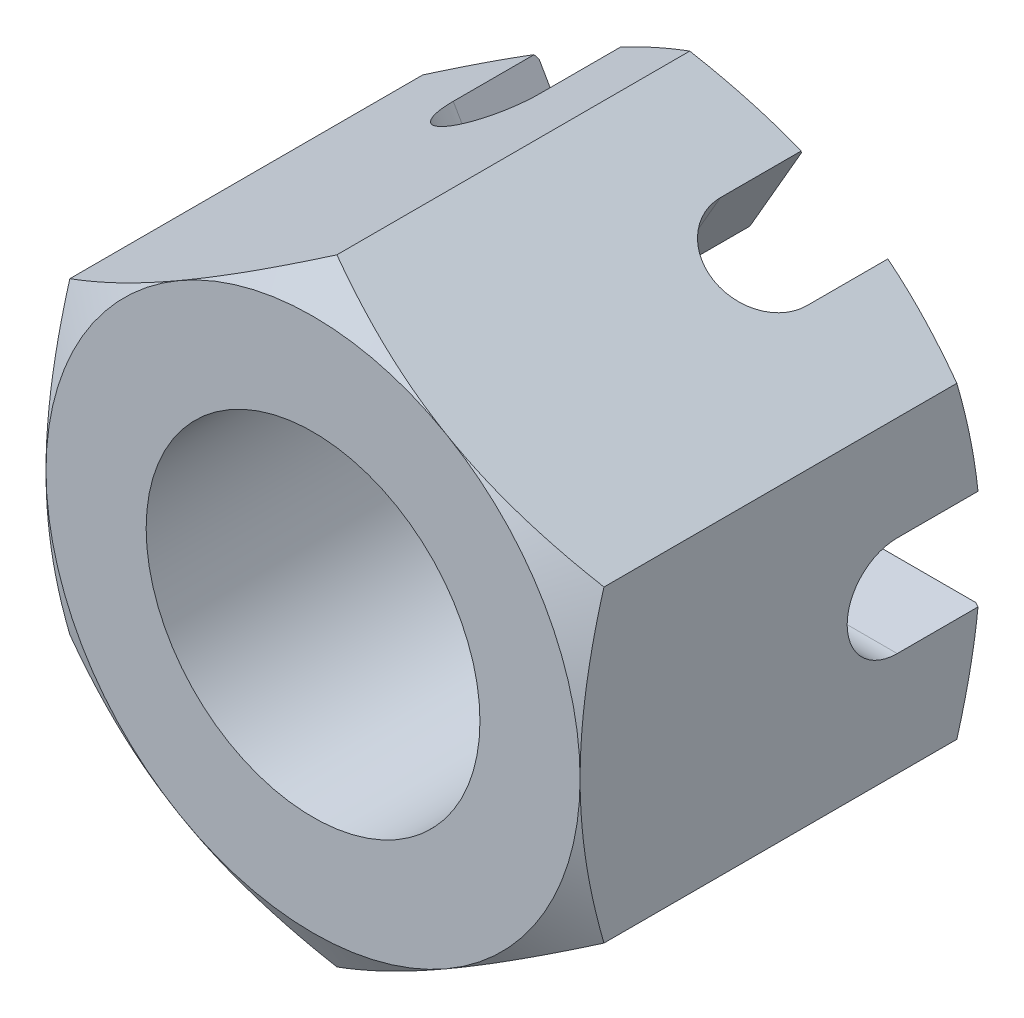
ISO-10303-21;
HEADER;
FILE_DESCRIPTION(('STEP AP214'),'2;1');
FILE_NAME('part.step','',(''),(''),'','','');
FILE_SCHEMA(('AUTOMOTIVE_DESIGN { 1 0 10303 214 1 1 1 1 }'));
ENDSEC;
DATA;
#1=APPLICATION_CONTEXT('core data for automotive mechanical design processes');
#2=APPLICATION_PROTOCOL_DEFINITION('international standard','automotive_design',2000,#1);
#3=PRODUCT_CONTEXT('',#1,'mechanical');
#4=PRODUCT('Part','Part','',(#3));
#5=PRODUCT_RELATED_PRODUCT_CATEGORY('part','',(#4));
#6=PRODUCT_DEFINITION_FORMATION('','',#4);
#7=PRODUCT_DEFINITION_CONTEXT('part definition',#1,'design');
#8=PRODUCT_DEFINITION('design','',#6,#7);
#9=PRODUCT_DEFINITION_SHAPE('','',#8);
#10=(LENGTH_UNIT() NAMED_UNIT(*) SI_UNIT(.MILLI.,.METRE.));
#11=(NAMED_UNIT(*) PLANE_ANGLE_UNIT() SI_UNIT($,.RADIAN.));
#12=(NAMED_UNIT(*) SI_UNIT($,.STERADIAN.) SOLID_ANGLE_UNIT());
#13=UNCERTAINTY_MEASURE_WITH_UNIT(LENGTH_MEASURE(1.E-05),#10,'distance_accuracy_value','');
#14=(GEOMETRIC_REPRESENTATION_CONTEXT(3) GLOBAL_UNCERTAINTY_ASSIGNED_CONTEXT((#13)) GLOBAL_UNIT_ASSIGNED_CONTEXT((#10,
#11,#12)) REPRESENTATION_CONTEXT('',''));
#15=CARTESIAN_POINT('',(0.,0.,0.));
#16=DIRECTION('',(0.,0.,1.));
#17=DIRECTION('',(1.,0.,0.));
#18=AXIS2_PLACEMENT_3D('',#15,#16,#17);
#19=CARTESIAN_POINT('',(-8.00000000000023,13.856406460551,-11.9999999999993));
#20=DIRECTION('',(0.,0.,-0.999999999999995));
#21=DIRECTION('',(-1.,0.,0.));
#22=AXIS2_PLACEMENT_3D('',#19,#20,#21);
#23=PLANE('',#22);
#24=DIRECTION('',(-0.500000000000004,0.866025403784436,0.));
#25=VECTOR('',#24,1.);
#26=CARTESIAN_POINT('',(7.29903810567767,-9.64230484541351,-11.9999999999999));
#27=LINE('',#26,#25);
#28=CARTESIAN_POINT('',(5.22809651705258,-6.05532879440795,-11.9999999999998));
#29=VERTEX_POINT('',#28);
#30=CARTESIAN_POINT('',(3.68388610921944,-3.3806779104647,-11.9999999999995));
#31=VERTEX_POINT('',#30);
#32=EDGE_CURVE('E329',#29,#31,#27,.T.);
#33=ORIENTED_EDGE('',*,*,#32,.T.);
#34=CARTESIAN_POINT('',(-2.22044604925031E-13,1.11022302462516E-13,-11.9999999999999));
#35=DIRECTION('',(0.,0.,0.999999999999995));
#36=DIRECTION('',(1.,0.,0.));
#37=AXIS2_PLACEMENT_3D('',#34,#35,#36);
#38=CIRCLE('',#37,5.);
#39=CARTESIAN_POINT('',(4.76969600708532,-1.50000000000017,-11.9999999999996));
#40=VERTEX_POINT('',#39);
#41=EDGE_CURVE('E577',#31,#40,#38,.T.);
#42=ORIENTED_EDGE('',*,*,#41,.T.);
#43=DIRECTION('',(1.,0.,0.));
#44=VECTOR('',#43,1.);
#45=CARTESIAN_POINT('',(-7.99999999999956,-1.49999999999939,-11.9999999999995));
#46=LINE('',#45,#44);
#47=CARTESIAN_POINT('',(7.85811682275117,-1.50000000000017,-11.9999999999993));
#48=VERTEX_POINT('',#47);
#49=EDGE_CURVE('E430',#40,#48,#46,.T.);
#50=ORIENTED_EDGE('',*,*,#49,.T.);
#51=CARTESIAN_POINT('',(-2.22044604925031E-13,1.11022302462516E-13,-11.9999999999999));
#52=DIRECTION('',(0.,0.,-0.999999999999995));
#53=DIRECTION('',(-1.,0.,0.));
#54=AXIS2_PLACEMENT_3D('',#51,#52,#53);
#55=CIRCLE('',#54,8.);
#56=EDGE_CURVE('E547',#29,#48,#55,.F.);
#57=ORIENTED_EDGE('',*,*,#56,.F.);
#58=EDGE_LOOP('',(#33,#42,#50,#57));
#59=FACE_BOUND('',#58,.T.);
#60=ADVANCED_FACE('F32',(#59),#23,.T.);
#61=DIRECTION('',(-0.500000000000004,0.866025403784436,0.));
#62=VECTOR('',#61,1.);
#63=CARTESIAN_POINT('',(4.70096189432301,-11.1423048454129,-11.9999999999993));
#64=LINE('',#63,#62);
#65=CARTESIAN_POINT('',(2.63002030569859,-7.55532879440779,-11.9999999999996));
#66=VERTEX_POINT('',#65);
#67=CARTESIAN_POINT('',(1.08580989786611,-4.88067791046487,-11.9999999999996));
#68=VERTEX_POINT('',#67);
#69=EDGE_CURVE('E335',#66,#68,#64,.T.);
#70=ORIENTED_EDGE('',*,*,#69,.F.);
#71=CARTESIAN_POINT('',(-2.63002030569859,-7.55532879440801,-11.9999999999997));
#72=VERTEX_POINT('',#71);
#73=EDGE_CURVE('E545',#72,#66,#55,.F.);
#74=ORIENTED_EDGE('',*,*,#73,.F.);
#75=DIRECTION('',(-0.499999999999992,-0.866025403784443,0.));
#76=VECTOR('',#75,1.);
#77=CARTESIAN_POINT('',(7.29903810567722,9.64230484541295,-11.9999999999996));
#78=LINE('',#77,#76);
#79=CARTESIAN_POINT('',(-1.08580989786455,-4.88067791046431,-11.9999999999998));
#80=VERTEX_POINT('',#79);
#81=EDGE_CURVE('E308',#80,#72,#78,.T.);
#82=ORIENTED_EDGE('',*,*,#81,.F.);
#83=EDGE_CURVE('E578',#80,#68,#38,.T.);
#84=ORIENTED_EDGE('',*,*,#83,.T.);
#85=EDGE_LOOP('',(#70,#74,#82,#84));
#86=FACE_BOUND('',#85,.T.);
#87=ADVANCED_FACE('F819',(#86),#23,.T.);
#88=CARTESIAN_POINT('',(-1.08580989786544,4.88067791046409,-11.9999999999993));
#89=VERTEX_POINT('',#88);
#90=CARTESIAN_POINT('',(-2.63002030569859,7.55532879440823,-11.9999999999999));
#91=VERTEX_POINT('',#90);
#92=EDGE_CURVE('E326',#89,#91,#27,.T.);
#93=ORIENTED_EDGE('',*,*,#92,.T.);
#94=CARTESIAN_POINT('',(2.63002030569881,7.55532879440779,-11.9999999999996));
#95=VERTEX_POINT('',#94);
#96=EDGE_CURVE('E533',#95,#91,#55,.F.);
#97=ORIENTED_EDGE('',*,*,#96,.F.);
#98=DIRECTION('',(-0.499999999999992,-0.866025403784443,0.));
#99=VECTOR('',#98,1.);
#100=CARTESIAN_POINT('',(4.7009618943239,11.1423048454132,-12.0000000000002));
#101=LINE('',#100,#99);
#102=CARTESIAN_POINT('',(1.08580989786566,4.88067791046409,-12.0000000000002));
#103=VERTEX_POINT('',#102);
#104=EDGE_CURVE('E314',#95,#103,#101,.T.);
#105=ORIENTED_EDGE('',*,*,#104,.T.);
#106=EDGE_CURVE('E534',#103,#89,#38,.T.);
#107=ORIENTED_EDGE('',*,*,#106,.T.);
#108=EDGE_LOOP('',(#93,#97,#105,#107));
#109=FACE_BOUND('',#108,.T.);
#110=ADVANCED_FACE('F531',(#109),#23,.T.);
#111=CARTESIAN_POINT('',(-3.6838861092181,3.38067791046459,-11.9999999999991));
#112=VERTEX_POINT('',#111);
#113=CARTESIAN_POINT('',(-5.22809651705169,6.05532879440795,-11.9999999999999));
#114=VERTEX_POINT('',#113);
#115=EDGE_CURVE('E325',#112,#114,#64,.T.);
#116=ORIENTED_EDGE('',*,*,#115,.F.);
#117=CARTESIAN_POINT('',(-4.76969600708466,1.49999999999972,-11.9999999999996));
#118=VERTEX_POINT('',#117);
#119=EDGE_CURVE('E586',#112,#118,#38,.T.);
#120=ORIENTED_EDGE('',*,*,#119,.T.);
#121=DIRECTION('',(1.,0.,0.));
#122=VECTOR('',#121,1.);
#123=CARTESIAN_POINT('',(-7.9999999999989,1.49999999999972,-12.));
#124=LINE('',#123,#122);
#125=CARTESIAN_POINT('',(-7.85811682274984,1.49999999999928,-11.9999999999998));
#126=VERTEX_POINT('',#125);
#127=EDGE_CURVE('E443',#126,#118,#124,.T.);
#128=ORIENTED_EDGE('',*,*,#127,.F.);
#129=CARTESIAN_POINT('',(-2.22044604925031E-13,1.11022302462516E-13,-11.9999999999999));
#130=DIRECTION('',(0.,0.,-0.999999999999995));
#131=DIRECTION('',(-1.,0.,0.));
#132=AXIS2_PLACEMENT_3D('',#129,#130,#131);
#133=CIRCLE('',#132,8.);
#134=EDGE_CURVE('E588',#126,#114,#133,.T.);
#135=ORIENTED_EDGE('',*,*,#134,.T.);
#136=EDGE_LOOP('',(#116,#120,#128,#135));
#137=FACE_BOUND('',#136,.T.);
#138=ADVANCED_FACE('F642',(#137),#23,.T.);
#139=CARTESIAN_POINT('',(-3.68388610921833,-3.38067791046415,-11.9999999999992));
#140=VERTEX_POINT('',#139);
#141=CARTESIAN_POINT('',(-5.22809651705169,-6.05532879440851,-11.9999999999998));
#142=VERTEX_POINT('',#141);
#143=EDGE_CURVE('E311',#140,#142,#101,.T.);
#144=ORIENTED_EDGE('',*,*,#143,.T.);
#145=CARTESIAN_POINT('',(-7.8581168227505,-1.49999999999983,-11.9999999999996));
#146=VERTEX_POINT('',#145);
#147=EDGE_CURVE('E544',#146,#142,#55,.F.);
#148=ORIENTED_EDGE('',*,*,#147,.F.);
#149=CARTESIAN_POINT('',(-4.76969600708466,-1.50000000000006,-11.9999999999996));
#150=VERTEX_POINT('',#149);
#151=EDGE_CURVE('E433',#146,#150,#46,.T.);
#152=ORIENTED_EDGE('',*,*,#151,.T.);
#153=EDGE_CURVE('E581',#150,#140,#38,.T.);
#154=ORIENTED_EDGE('',*,*,#153,.T.);
#155=EDGE_LOOP('',(#144,#148,#152,#154));
#156=FACE_BOUND('',#155,.T.);
#157=ADVANCED_FACE('F597',(#156),#23,.T.);
#158=CARTESIAN_POINT('',(-8.00000000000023,13.8564064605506,2.22044604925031E-13));
#159=DIRECTION('',(0.,0.,-0.999999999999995));
#160=DIRECTION('',(-1.,0.,0.));
#161=AXIS2_PLACEMENT_3D('',#158,#159,#160);
#162=PLANE('',#161);
#163=CARTESIAN_POINT('',(0.,-1.11022302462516E-13,2.22044604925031E-13));
#164=DIRECTION('',(0.,0.,0.999999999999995));
#165=DIRECTION('',(1.,0.,0.));
#166=AXIS2_PLACEMENT_3D('',#163,#164,#165);
#167=CIRCLE('',#166,5.);
#168=CARTESIAN_POINT('',(5.,-1.10605968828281E-13,2.21489493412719E-13));
#169=VERTEX_POINT('',#168);
#170=EDGE_CURVE('E573',#169,#169,#167,.T.);
#171=ORIENTED_EDGE('',*,*,#170,.F.);
#172=EDGE_LOOP('',(#171));
#173=FACE_BOUND('',#172,.T.);
#174=CARTESIAN_POINT('',(0.,-1.11022302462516E-13,2.22044604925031E-13));
#175=DIRECTION('',(0.,0.,-0.999999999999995));
#176=DIRECTION('',(-1.,0.,0.));
#177=AXIS2_PLACEMENT_3D('',#174,#175,#176);
#178=CIRCLE('',#177,8.);
#179=CARTESIAN_POINT('',(-7.99999999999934,-3.33066907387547E-13,2.22044604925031E-13));
#180=VERTEX_POINT('',#179);
#181=CARTESIAN_POINT('',(-3.99999999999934,6.92820323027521,6.66133814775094E-13));
#182=VERTEX_POINT('',#181);
#183=EDGE_CURVE('E646',#180,#182,#178,.T.);
#184=ORIENTED_EDGE('',*,*,#183,.F.);
#185=CARTESIAN_POINT('',(0.,-1.11022302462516E-13,2.22044604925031E-13));
#186=DIRECTION('',(0.,0.,-0.999999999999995));
#187=DIRECTION('',(-1.,0.,0.));
#188=AXIS2_PLACEMENT_3D('',#185,#186,#187);
#189=CIRCLE('',#188,8.);
#190=CARTESIAN_POINT('',(-3.99999999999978,-6.92820323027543,9.99200722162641E-13));
#191=VERTEX_POINT('',#190);
#192=EDGE_CURVE('E542',#180,#191,#189,.F.);
#193=ORIENTED_EDGE('',*,*,#192,.T.);
#194=CARTESIAN_POINT('',(4.00000000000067,-6.92820323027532,6.66133814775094E-13));
#195=VERTEX_POINT('',#194);
#196=EDGE_CURVE('E549',#191,#195,#189,.F.);
#197=ORIENTED_EDGE('',*,*,#196,.T.);
#198=CARTESIAN_POINT('',(8.00000000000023,7.7715611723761E-13,2.22044604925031E-13));
#199=VERTEX_POINT('',#198);
#200=EDGE_CURVE('E789',#195,#199,#189,.F.);
#201=ORIENTED_EDGE('',*,*,#200,.T.);
#202=CARTESIAN_POINT('',(4.00000000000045,6.92820323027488,-4.44089209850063E-13));
#203=VERTEX_POINT('',#202);
#204=EDGE_CURVE('E781',#199,#203,#189,.F.);
#205=ORIENTED_EDGE('',*,*,#204,.T.);
#206=EDGE_CURVE('E551',#203,#182,#189,.F.);
#207=ORIENTED_EDGE('',*,*,#206,.T.);
#208=EDGE_LOOP('',(#184,#193,#197,#201,#205,#207));
#209=FACE_BOUND('',#208,.T.);
#210=ADVANCED_FACE('F786',(#173,#209),#162,.F.);
#211=CARTESIAN_POINT('',(0.,-1.11022302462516E-13,2.22044604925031E-13));
#212=DIRECTION('',(0.,0.,-0.999999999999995));
#213=DIRECTION('',(-1.,0.,0.));
#214=AXIS2_PLACEMENT_3D('',#211,#212,#213);
#215=CONICAL_SURFACE('',#214,8.,1.0471975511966);
#216=CARTESIAN_POINT('',(-8.00000000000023,-12.5695904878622,-3.98341858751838));
#217=CARTESIAN_POINT('',(-8.00000000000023,-12.2187335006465,-3.81257276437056));
#218=CARTESIAN_POINT('',(-8.00000000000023,-11.8670883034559,-3.6433187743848));
#219=CARTESIAN_POINT('',(-8.00000000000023,-11.1618028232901,-3.30888674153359));
#220=CARTESIAN_POINT('',(-8.00000000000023,-10.8081622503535,-3.14370931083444));
#221=CARTESIAN_POINT('',(-8.00000000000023,-10.096722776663,-2.8175264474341));
#222=CARTESIAN_POINT('',(-8.00000000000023,-9.73891180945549,-2.65654724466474));
#223=CARTESIAN_POINT('',(-8.00000000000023,-9.02049996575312,-2.34096383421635));
#224=CARTESIAN_POINT('',(-8.00000000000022,-8.65989921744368,-2.18635933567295));
#225=CARTESIAN_POINT('',(-8.00000000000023,-7.92317790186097,-1.88015066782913));
#226=CARTESIAN_POINT('',(-8.00000000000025,-7.5469425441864,-1.72882119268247));
#227=CARTESIAN_POINT('',(-8.0000000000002,-6.79013187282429,-1.43722588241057));
#228=CARTESIAN_POINT('',(-8.00000000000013,-6.40955608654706,-1.29696126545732));
#229=CARTESIAN_POINT('',(-8.00000000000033,-5.64411517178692,-1.03105864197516));
#230=CARTESIAN_POINT('',(-8.00000000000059,-5.25925995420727,-0.905392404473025));
#231=CARTESIAN_POINT('',(-7.99999999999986,-4.48404505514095,-0.672609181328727));
#232=CARTESIAN_POINT('',(-7.99999999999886,-4.09368709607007,-0.565486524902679));
#233=CARTESIAN_POINT('',(-7.99999999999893,-3.30933217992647,-0.375394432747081));
#234=CARTESIAN_POINT('',(-7.99999999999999,-2.91536859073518,-0.292290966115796));
#235=CARTESIAN_POINT('',(-8.00000000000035,-2.32070932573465,-0.189173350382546));
#236=CARTESIAN_POINT('',(-8.00000000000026,-2.12185747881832,-0.158389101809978));
#237=CARTESIAN_POINT('',(-8.00000000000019,-1.72311097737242,-0.10459924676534));
#238=CARTESIAN_POINT('',(-8.00000000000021,-1.52321642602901,-0.0815928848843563));
#239=CARTESIAN_POINT('',(-8.00000000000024,-1.12533568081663,-0.044114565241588));
#240=CARTESIAN_POINT('',(-8.00000000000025,-0.927359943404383,-0.0295320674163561));
#241=CARTESIAN_POINT('',(-8.00000000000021,-0.530968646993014,-0.00875931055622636));
#242=CARTESIAN_POINT('',(-8.00000000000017,-0.332553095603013,-0.00256890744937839));
#243=CARTESIAN_POINT('',(-8.00000000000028,0.0643636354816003,0.00127130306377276));
#244=CARTESIAN_POINT('',(-8.00000000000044,0.262864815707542,-0.00107894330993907));
#245=CARTESIAN_POINT('',(-8.00000000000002,0.659587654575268,-0.0142607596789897));
#246=CARTESIAN_POINT('',(-7.99999999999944,0.857809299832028,-0.0250927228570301));
#247=CARTESIAN_POINT('',(-7.9999999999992,1.32926224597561,-0.0607090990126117));
#248=CARTESIAN_POINT('',(-7.99999999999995,1.60221670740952,-0.0892430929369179));
#249=CARTESIAN_POINT('',(-8.00000000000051,2.14619327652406,-0.160874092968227));
#250=CARTESIAN_POINT('',(-8.00000000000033,2.41721513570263,-0.20397293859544));
#251=CARTESIAN_POINT('',(-8.00000000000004,3.22701168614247,-0.352838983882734));
#252=CARTESIAN_POINT('',(-8.00000000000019,3.7622459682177,-0.478152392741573));
#253=CARTESIAN_POINT('',(-8.00000000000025,4.56295823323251,-0.696692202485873));
#254=CARTESIAN_POINT('',(-8.00000000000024,4.83255308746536,-0.775712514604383));
#255=CARTESIAN_POINT('',(-8.00000000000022,5.36912677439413,-0.942264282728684));
#256=CARTESIAN_POINT('',(-8.00000000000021,5.63610558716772,-1.02979580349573));
#257=CARTESIAN_POINT('',(-8.00000000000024,6.16752828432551,-1.21194035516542));
#258=CARTESIAN_POINT('',(-8.00000000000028,6.43197287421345,-1.30655134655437));
#259=CARTESIAN_POINT('',(-8.00000000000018,6.95864801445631,-1.50171124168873));
#260=CARTESIAN_POINT('',(-8.00000000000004,7.22087861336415,-1.60226001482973));
#261=CARTESIAN_POINT('',(-7.99999999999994,7.92057032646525,-1.87818720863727));
#262=CARTESIAN_POINT('',(-8.00000000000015,8.35625494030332,-2.05806596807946));
#263=CARTESIAN_POINT('',(-8.00000000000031,9.22319334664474,-2.42823832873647));
#264=CARTESIAN_POINT('',(-8.00000000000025,9.65444666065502,-2.61853304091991));
#265=CARTESIAN_POINT('',(-8.00000000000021,10.5135269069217,-3.00709646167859));
#266=CARTESIAN_POINT('',(-8.00000000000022,10.9413525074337,-3.2053681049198));
#267=CARTESIAN_POINT('',(-8.00000000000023,11.7941006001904,-3.60799669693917));
#268=CARTESIAN_POINT('',(-8.00000000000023,12.2190232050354,-3.81235340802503));
#269=CARTESIAN_POINT('',(-8.00000000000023,13.0671994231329,-4.22616313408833));
#270=CARTESIAN_POINT('',(-8.00000000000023,13.4904493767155,-4.43562363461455));
#271=CARTESIAN_POINT('',(-8.00000000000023,14.3350455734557,-4.85835023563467));
#272=CARTESIAN_POINT('',(-8.00000000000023,14.7563918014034,-5.07161636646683));
#273=CARTESIAN_POINT('',(-8.00000000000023,15.5974274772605,-5.50116670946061));
#274=CARTESIAN_POINT('',(-8.00000000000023,16.0171172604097,-5.71745026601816));
#275=CARTESIAN_POINT('',(-8.00000000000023,16.8551983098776,-6.15252014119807));
#276=CARTESIAN_POINT('',(-8.00000000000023,17.2735895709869,-6.37130646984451));
#277=CARTESIAN_POINT('',(-8.00000000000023,18.4399840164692,-6.98489689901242));
#278=CARTESIAN_POINT('',(-8.00000000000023,19.1867932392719,-7.381970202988));
#279=CARTESIAN_POINT('',(-8.00000000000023,20.6778911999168,-8.18091651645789));
#280=CARTESIAN_POINT('',(-8.00000000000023,21.4221797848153,-8.58278981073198));
#281=CARTESIAN_POINT('',(-8.00000000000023,22.9063632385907,-9.3887938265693));
#282=CARTESIAN_POINT('',(-8.00000000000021,23.6462645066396,-9.79291277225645));
#283=CARTESIAN_POINT('',(-8.00000000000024,24.7549609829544,-10.4011279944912));
#284=CARTESIAN_POINT('',(-8.00000000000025,25.1243198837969,-10.6041981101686));
#285=CARTESIAN_POINT('',(-8.00000000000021,25.8627019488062,-11.0109467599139));
#286=CARTESIAN_POINT('',(-8.00000000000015,26.2317251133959,-11.2146252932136));
#287=CARTESIAN_POINT('',(-8.00000000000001,26.6006008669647,-11.4185705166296));
#288=B_SPLINE_CURVE_WITH_KNOTS('',3,(#216,#217,#218,#219,#220,#221,#222,#223,#224,#225,#226,
#227,#228,#229,#230,#231,#232,#233,#234,#235,#236,#237,#238,#239,#240,#241,#242,#243,#244,#245,
#246,#247,#248,#249,#250,#251,#252,#253,#254,#255,#256,#257,#258,#259,#260,#261,#262,#263,#264,
#265,#266,#267,#268,#269,#270,#271,#272,#273,#274,#275,#276,#277,#278,#279,#280,#281,#282,#283,
#284,#285,#286,#287),.UNSPECIFIED.,.F.,.F.,(4,2,2,2,2,2,2,2,2,2,2,2,2,2,2,2,2,2,2,2,2,2,2,2,2,2,
2,2,2,2,2,2,2,2,2,4),(0.,1.1707399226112,2.3416545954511,3.51867176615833,4.69563517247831,
5.91208657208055,7.12867170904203,8.34286355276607,9.55668342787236,10.7635931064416,
11.367126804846,11.9706018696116,12.5659667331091,13.1613213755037,13.7566797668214,
14.3520657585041,15.1749299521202,15.9978981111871,17.6446478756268,18.4873839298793,
19.3301263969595,20.1726270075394,21.015109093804,22.4289788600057,23.8429997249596,
25.2575456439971,26.6720363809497,28.0887440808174,29.5054630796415,30.9218789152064,
32.3383004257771,34.8756972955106,37.4132454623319,39.9424456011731,41.2069495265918,
42.4714518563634),.UNSPECIFIED.);
#289=CARTESIAN_POINT('',(-7.99999999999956,4.61880215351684,-0.714531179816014));
#290=VERTEX_POINT('',#289);
#291=EDGE_CURVE('E656',#290,#180,#288,.F.);
#292=ORIENTED_EDGE('',*,*,#291,.T.);
#293=ORIENTED_EDGE('',*,*,#183,.T.);
#294=CARTESIAN_POINT('',(0.00019999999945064,9.23771977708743,-0.714597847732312));
#295=CARTESIAN_POINT('',(-0.175648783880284,9.13619343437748,-0.655990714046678));
#296=CARTESIAN_POINT('',(-0.352153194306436,9.03428856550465,-0.600043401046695));
#297=CARTESIAN_POINT('',(-0.706595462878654,8.8296512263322,-0.494201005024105));
#298=CARTESIAN_POINT('',(-0.884533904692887,8.72691841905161,-0.444308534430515));
#299=CARTESIAN_POINT('',(-1.42119823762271,8.41707512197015,-0.304692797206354));
#300=CARTESIAN_POINT('',(-1.78204258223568,8.20874154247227,-0.225281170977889));
#301=CARTESIAN_POINT('',(-2.32203917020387,7.89697436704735,-0.132161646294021));
#302=CARTESIAN_POINT('',(-2.49957818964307,7.79447216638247,-0.105634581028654));
#303=CARTESIAN_POINT('',(-2.85545911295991,7.58900421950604,-0.0611531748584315));
#304=CARTESIAN_POINT('',(-3.03380094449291,7.48603851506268,-0.0431980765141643));
#305=CARTESIAN_POINT('',(-3.3907916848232,7.2799298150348,-0.0163156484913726));
#306=CARTESIAN_POINT('',(-3.56944001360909,7.17678715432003,-0.00737807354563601));
#307=CARTESIAN_POINT('',(-3.92690170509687,6.97040655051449,0.00127769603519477));
#308=CARTESIAN_POINT('',(-4.10571506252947,6.86716861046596,0.000996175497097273));
#309=CARTESIAN_POINT('',(-4.44001336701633,6.67416139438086,-0.00814502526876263));
#310=CARTESIAN_POINT('',(-4.59552190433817,6.58437849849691,-0.0158896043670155));
#311=CARTESIAN_POINT('',(-4.9061747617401,6.40502298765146,-0.0382011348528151));
#312=CARTESIAN_POINT('',(-5.06131905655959,6.31545038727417,-0.0527685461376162));
#313=CARTESIAN_POINT('',(-5.52615131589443,6.04707935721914,-0.106360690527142));
#314=CARTESIAN_POINT('',(-5.83501648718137,5.86875596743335,-0.155268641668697));
#315=CARTESIAN_POINT('',(-6.45602322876,5.51021755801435,-0.277539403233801));
#316=CARTESIAN_POINT('',(-6.76808554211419,5.33004829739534,-0.351420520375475));
#317=CARTESIAN_POINT('',(-7.38755648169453,4.97239658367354,-0.519100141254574));
#318=CARTESIAN_POINT('',(-7.69497304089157,4.79490955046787,-0.612859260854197));
#319=CARTESIAN_POINT('',(-8.0001999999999,4.61868668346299,-0.714597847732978));
#320=B_SPLINE_CURVE_WITH_KNOTS('',3,(#294,#295,#296,#297,#298,#299,#300,#301,#302,#303,#304,
#305,#306,#307,#308,#309,#310,#311,#312,#313,#314,#315,#316,#317,#318,#319),.UNSPECIFIED.,.F.,
.F.,(4,2,2,2,2,2,2,2,2,2,2,2,4),(0.,0.633973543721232,1.26821965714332,2.53934712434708,
3.15934343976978,3.779284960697,4.3985213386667,5.0177385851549,5.55680239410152,
6.09590254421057,7.17487077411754,8.27776850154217,9.37850115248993),.UNSPECIFIED.);
#321=EDGE_CURVE('E648',#182,#290,#320,.T.);
#322=ORIENTED_EDGE('',*,*,#321,.T.);
#323=EDGE_LOOP('',(#292,#293,#322));
#324=FACE_BOUND('',#323,.T.);
#325=ADVANCED_FACE('F471',(#324),#215,.T.);
#326=CARTESIAN_POINT('',(8.0001999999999,4.61868668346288,-0.714597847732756));
#327=CARTESIAN_POINT('',(7.82435121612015,4.72021302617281,-0.655990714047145));
#328=CARTESIAN_POINT('',(7.64784680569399,4.82211789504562,-0.600043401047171));
#329=CARTESIAN_POINT('',(7.29340453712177,5.02675523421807,-0.494201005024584));
#330=CARTESIAN_POINT('',(7.11546609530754,5.12948804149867,-0.444308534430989));
#331=CARTESIAN_POINT('',(6.57880176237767,5.43933133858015,-0.304692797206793));
#332=CARTESIAN_POINT('',(6.21795741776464,5.64766491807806,-0.225281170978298));
#333=CARTESIAN_POINT('',(5.67796082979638,5.95943209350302,-0.132161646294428));
#334=CARTESIAN_POINT('',(5.50042181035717,6.06193429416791,-0.105634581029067));
#335=CARTESIAN_POINT('',(5.14454088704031,6.26740224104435,-0.0611531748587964));
#336=CARTESIAN_POINT('',(4.9661990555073,6.37036794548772,-0.0431980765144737));
#337=CARTESIAN_POINT('',(4.60920831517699,6.5764766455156,-0.0163156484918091));
#338=CARTESIAN_POINT('',(4.4305599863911,6.67961930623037,-0.00737807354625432));
#339=CARTESIAN_POINT('',(4.07309829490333,6.88599991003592,0.00127769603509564));
#340=CARTESIAN_POINT('',(3.89428493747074,6.98923785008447,0.000996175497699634));
#341=CARTESIAN_POINT('',(3.55998663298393,7.18224506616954,-0.00814502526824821));
#342=CARTESIAN_POINT('',(3.40447809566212,7.27202796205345,-0.0158896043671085));
#343=CARTESIAN_POINT('',(3.09382523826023,7.45138347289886,-0.0382011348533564));
#344=CARTESIAN_POINT('',(2.93868094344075,7.54095607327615,-0.0527685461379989));
#345=CARTESIAN_POINT('',(2.47384868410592,7.80932710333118,-0.106360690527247));
#346=CARTESIAN_POINT('',(2.16498351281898,7.98765049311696,-0.15526864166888));
#347=CARTESIAN_POINT('',(1.54397677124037,8.34618890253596,-0.277539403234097));
#348=CARTESIAN_POINT('',(1.2319144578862,8.52635816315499,-0.351420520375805));
#349=CARTESIAN_POINT('',(0.612443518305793,8.88400987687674,-0.519100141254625));
#350=CARTESIAN_POINT('',(0.30502695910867,9.06149691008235,-0.612859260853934));
#351=CARTESIAN_POINT('',(-0.000199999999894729,9.23771977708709,-0.71459784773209));
#352=B_SPLINE_CURVE_WITH_KNOTS('',3,(#326,#327,#328,#329,#330,#331,#332,#333,#334,#335,#336,
#337,#338,#339,#340,#341,#342,#343,#344,#345,#346,#347,#348,#349,#350,#351),.UNSPECIFIED.,.F.,
.F.,(4,2,2,2,2,2,2,2,2,2,2,2,4),(0.,0.633973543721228,1.26821965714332,2.53934712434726,
3.15934343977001,3.77928496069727,4.39852133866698,5.01773858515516,5.55680239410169,
6.0959025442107,7.17487077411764,8.27776850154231,9.37850115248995),.UNSPECIFIED.);
#353=CARTESIAN_POINT('',(-8.88178419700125E-13,9.2376043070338,-0.714531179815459));
#354=VERTEX_POINT('',#353);
#355=EDGE_CURVE('E716',#203,#354,#352,.T.);
#356=ORIENTED_EDGE('',*,*,#355,.T.);
#357=EDGE_CURVE('E655',#354,#182,#320,.T.);
#358=ORIENTED_EDGE('',*,*,#357,.T.);
#359=ORIENTED_EDGE('',*,*,#206,.F.);
#360=EDGE_LOOP('',(#356,#358,#359));
#361=FACE_BOUND('',#360,.T.);
#362=ADVANCED_FACE('F784',(#361),#215,.T.);
#363=CARTESIAN_POINT('',(7.99999999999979,-12.5695904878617,-3.98341858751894));
#364=CARTESIAN_POINT('',(7.99999999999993,-12.2187335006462,-3.81257276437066));
#365=CARTESIAN_POINT('',(7.99999999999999,-11.8670883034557,-3.64331877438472));
#366=CARTESIAN_POINT('',(8.00000000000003,-11.16180282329,-3.3088867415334));
#367=CARTESIAN_POINT('',(8.00000000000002,-10.8081622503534,-3.14370931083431));
#368=CARTESIAN_POINT('',(8.,-10.0967227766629,-2.81752644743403));
#369=CARTESIAN_POINT('',(8.00000000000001,-9.7389118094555,-2.65654724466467));
#370=CARTESIAN_POINT('',(8.00000000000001,-9.0204999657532,-2.3409638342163));
#371=CARTESIAN_POINT('',(8.00000000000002,-8.6598992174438,-2.18635933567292));
#372=CARTESIAN_POINT('',(8.,-7.92317790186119,-1.88015066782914));
#373=CARTESIAN_POINT('',(7.99999999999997,-7.54694254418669,-1.7288211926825));
#374=CARTESIAN_POINT('',(8.00000000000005,-6.79013187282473,-1.43722588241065));
#375=CARTESIAN_POINT('',(8.00000000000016,-6.40955608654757,-1.29696126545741));
#376=CARTESIAN_POINT('',(7.99999999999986,-5.64411517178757,-1.03105864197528));
#377=CARTESIAN_POINT('',(7.99999999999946,-5.25925995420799,-0.905392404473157));
#378=CARTESIAN_POINT('',(8.00000000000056,-4.48404505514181,-0.672609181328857));
#379=CARTESIAN_POINT('',(8.00000000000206,-4.093687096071,-0.565486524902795));
#380=CARTESIAN_POINT('',(8.00000000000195,-3.30933217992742,-0.375394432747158));
#381=CARTESIAN_POINT('',(8.00000000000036,-2.91536859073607,-0.292290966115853));
#382=CARTESIAN_POINT('',(7.99999999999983,-2.32070932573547,-0.18917335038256));
#383=CARTESIAN_POINT('',(7.99999999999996,-2.12185747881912,-0.158389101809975));
#384=CARTESIAN_POINT('',(8.00000000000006,-1.72311097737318,-0.104599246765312));
#385=CARTESIAN_POINT('',(8.00000000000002,-1.52321642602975,-0.0815928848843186));
#386=CARTESIAN_POINT('',(7.99999999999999,-1.12533568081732,-0.0441145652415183));
#387=CARTESIAN_POINT('',(8.,-0.927359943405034,-0.0295320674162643));
#388=CARTESIAN_POINT('',(8.00000000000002,-0.530968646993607,-0.00875931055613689));
#389=CARTESIAN_POINT('',(8.00000000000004,-0.332553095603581,-0.00256890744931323));
#390=CARTESIAN_POINT('',(7.99999999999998,0.0643636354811,0.00127130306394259));
#391=CARTESIAN_POINT('',(7.9999999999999,0.262864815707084,-0.00107894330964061));
#392=CARTESIAN_POINT('',(8.00000000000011,0.659587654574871,-0.0142607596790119));
#393=CARTESIAN_POINT('',(8.0000000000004,0.85780929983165,-0.0250927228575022));
#394=CARTESIAN_POINT('',(8.00000000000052,1.3292622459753,-0.0607090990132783));
#395=CARTESIAN_POINT('',(8.00000000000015,1.60221670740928,-0.0892430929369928));
#396=CARTESIAN_POINT('',(7.99999999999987,2.14619327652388,-0.160874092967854));
#397=CARTESIAN_POINT('',(7.99999999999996,2.41721513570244,-0.203972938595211));
#398=CARTESIAN_POINT('',(8.0000000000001,3.22701168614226,-0.352838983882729));
#399=CARTESIAN_POINT('',(8.00000000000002,3.76224596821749,-0.478152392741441));
#400=CARTESIAN_POINT('',(8.,4.56295823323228,-0.696692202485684));
#401=CARTESIAN_POINT('',(8.00000000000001,4.83255308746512,-0.775712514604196));
#402=CARTESIAN_POINT('',(8.,5.36912677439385,-0.9422642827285));
#403=CARTESIAN_POINT('',(7.99999999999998,5.63610558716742,-1.02979580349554));
#404=CARTESIAN_POINT('',(8.00000000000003,6.16752828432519,-1.21194035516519));
#405=CARTESIAN_POINT('',(8.00000000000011,6.43197287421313,-1.3065513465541));
#406=CARTESIAN_POINT('',(7.99999999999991,6.95864801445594,-1.50171124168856));
#407=CARTESIAN_POINT('',(7.99999999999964,7.22087861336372,-1.60226001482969));
#408=CARTESIAN_POINT('',(7.99999999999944,7.92057032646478,-1.87818720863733));
#409=CARTESIAN_POINT('',(7.99999999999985,8.35625494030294,-2.0580659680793));
#410=CARTESIAN_POINT('',(8.00000000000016,9.22319334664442,-2.42823832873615));
#411=CARTESIAN_POINT('',(8.00000000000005,9.65444666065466,-2.61853304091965));
#412=CARTESIAN_POINT('',(7.99999999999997,10.5135269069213,-3.00709646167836));
#413=CARTESIAN_POINT('',(8.,10.9413525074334,-3.20536810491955));
#414=CARTESIAN_POINT('',(8.00000000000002,11.7941006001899,-3.6079966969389));
#415=CARTESIAN_POINT('',(8.00000000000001,12.219023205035,-3.81235340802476));
#416=CARTESIAN_POINT('',(8.,13.0671994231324,-4.22616313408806));
#417=CARTESIAN_POINT('',(8.00000000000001,13.4904493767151,-4.43562363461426));
#418=CARTESIAN_POINT('',(8.00000000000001,14.3350455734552,-4.85835023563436));
#419=CARTESIAN_POINT('',(8.00000000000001,14.7563918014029,-5.07161636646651));
#420=CARTESIAN_POINT('',(8.00000000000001,15.5974274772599,-5.50116670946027));
#421=CARTESIAN_POINT('',(8.00000000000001,16.0171172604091,-5.71745026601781));
#422=CARTESIAN_POINT('',(8.00000000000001,16.855198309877,-6.1525201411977));
#423=CARTESIAN_POINT('',(8.00000000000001,17.2735895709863,-6.37130646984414));
#424=CARTESIAN_POINT('',(8.00000000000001,18.4399840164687,-6.98489689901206));
#425=CARTESIAN_POINT('',(8.,19.1867932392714,-7.38197020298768));
#426=CARTESIAN_POINT('',(8.00000000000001,20.6778911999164,-8.18091651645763));
#427=CARTESIAN_POINT('',(8.00000000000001,21.422179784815,-8.58278981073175));
#428=CARTESIAN_POINT('',(8.,22.9063632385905,-9.38879382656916));
#429=CARTESIAN_POINT('',(7.99999999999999,23.6462645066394,-9.79291277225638));
#430=CARTESIAN_POINT('',(8.00000000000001,24.7549609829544,-10.4011279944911));
#431=CARTESIAN_POINT('',(8.00000000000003,25.124319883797,-10.6041981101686));
#432=CARTESIAN_POINT('',(7.99999999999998,25.8627019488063,-11.0109467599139));
#433=CARTESIAN_POINT('',(7.99999999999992,26.231725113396,-11.2146252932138));
#434=CARTESIAN_POINT('',(7.99999999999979,26.6006008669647,-11.4185705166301));
#435=B_SPLINE_CURVE_WITH_KNOTS('',3,(#363,#364,#365,#366,#367,#368,#369,#370,#371,#372,#373,
#374,#375,#376,#377,#378,#379,#380,#381,#382,#383,#384,#385,#386,#387,#388,#389,#390,#391,#392,
#393,#394,#395,#396,#397,#398,#399,#400,#401,#402,#403,#404,#405,#406,#407,#408,#409,#410,#411,
#412,#413,#414,#415,#416,#417,#418,#419,#420,#421,#422,#423,#424,#425,#426,#427,#428,#429,#430,
#431,#432,#433,#434),.UNSPECIFIED.,.F.,.F.,(4,2,2,2,2,2,2,2,2,2,2,2,2,2,2,2,2,2,2,2,2,2,2,2,2,2,
2,2,2,2,2,2,2,2,2,4),(0.,1.17073992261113,2.34165459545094,3.51867176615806,4.69563517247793,
5.91208657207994,7.12867170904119,8.34286355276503,9.55668342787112,10.7635931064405,
11.367126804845,11.9706018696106,12.5659667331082,13.161321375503,13.7566797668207,
14.3520657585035,15.1749299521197,15.9978981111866,17.6446478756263,18.4873839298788,
19.3301263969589,20.1726270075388,21.0151090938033,22.4289788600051,23.842999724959,
25.2575456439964,26.672036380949,28.0887440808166,29.5054630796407,30.9218789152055,
32.3383004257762,34.8756972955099,37.4132454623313,39.9424456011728,41.2069495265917,
42.4714518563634),.UNSPECIFIED.);
#436=CARTESIAN_POINT('',(7.99999999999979,4.61880215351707,-0.714531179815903));
#437=VERTEX_POINT('',#436);
#438=EDGE_CURVE('E713',#199,#437,#435,.T.);
#439=ORIENTED_EDGE('',*,*,#438,.T.);
#440=EDGE_CURVE('E772',#437,#203,#352,.T.);
#441=ORIENTED_EDGE('',*,*,#440,.T.);
#442=ORIENTED_EDGE('',*,*,#204,.F.);
#443=EDGE_LOOP('',(#439,#441,#442));
#444=FACE_BOUND('',#443,.T.);
#445=ADVANCED_FACE('F779',(#444),#215,.T.);
#446=CARTESIAN_POINT('',(-0.000200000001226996,-9.23771977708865,-0.71459784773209));
#447=CARTESIAN_POINT('',(0.175648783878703,-9.1361934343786,-0.655990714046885));
#448=CARTESIAN_POINT('',(0.352153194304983,-9.03428856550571,-0.60004340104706));
#449=CARTESIAN_POINT('',(0.7065954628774,-8.82965122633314,-0.494201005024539));
#450=CARTESIAN_POINT('',(0.884533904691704,-8.7269184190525,-0.444308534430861));
#451=CARTESIAN_POINT('',(1.42119823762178,-8.41707512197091,-0.304692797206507));
#452=CARTESIAN_POINT('',(1.78204258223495,-8.20874154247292,-0.225281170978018));
#453=CARTESIAN_POINT('',(2.32203917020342,-7.89697436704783,-0.132161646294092));
#454=CARTESIAN_POINT('',(2.4995781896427,-7.79447216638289,-0.105634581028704));
#455=CARTESIAN_POINT('',(2.85545911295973,-7.58900421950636,-0.0611531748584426));
#456=CARTESIAN_POINT('',(3.03380094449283,-7.48603851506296,-0.0431980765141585));
#457=CARTESIAN_POINT('',(3.39079168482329,-7.27992981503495,-0.0163156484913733));
#458=CARTESIAN_POINT('',(3.56944001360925,-7.17678715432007,-0.00737807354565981));
#459=CARTESIAN_POINT('',(3.92690170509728,-6.97040655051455,0.00127769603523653));
#460=CARTESIAN_POINT('',(4.10571506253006,-6.86716861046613,0.000996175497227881));
#461=CARTESIAN_POINT('',(4.44001336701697,-6.67416139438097,-0.00814502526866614));
#462=CARTESIAN_POINT('',(4.59552190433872,-6.58437849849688,-0.0158896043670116));
#463=CARTESIAN_POINT('',(4.90617476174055,-6.40502298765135,-0.038201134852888));
#464=CARTESIAN_POINT('',(5.06131905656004,-6.3154503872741,-0.0527685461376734));
#465=CARTESIAN_POINT('',(5.52615131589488,-6.04707935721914,-0.106360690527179));
#466=CARTESIAN_POINT('',(5.83501648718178,-5.86875596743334,-0.155268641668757));
#467=CARTESIAN_POINT('',(6.45602322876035,-5.51021755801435,-0.277539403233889));
#468=CARTESIAN_POINT('',(6.76808554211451,-5.33004829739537,-0.351420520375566));
#469=CARTESIAN_POINT('',(7.3875564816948,-4.97239658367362,-0.519100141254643));
#470=CARTESIAN_POINT('',(7.69497304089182,-4.79490955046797,-0.61285926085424));
#471=CARTESIAN_POINT('',(8.00020000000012,-4.6186866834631,-0.714597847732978));
#472=B_SPLINE_CURVE_WITH_KNOTS('',3,(#446,#447,#448,#449,#450,#451,#452,#453,#454,#455,#456,
#457,#458,#459,#460,#461,#462,#463,#464,#465,#466,#467,#468,#469,#470,#471),.UNSPECIFIED.,.F.,
.F.,(4,2,2,2,2,2,2,2,2,2,2,2,4),(0.,0.633973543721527,1.26821965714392,2.53934712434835,
3.15934343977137,3.77928496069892,4.39852133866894,5.01773858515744,5.55680239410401,
6.09590254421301,7.1748707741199,8.27776850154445,9.37850115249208),.UNSPECIFIED.);
#473=CARTESIAN_POINT('',(8.00000000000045,-4.61880215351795,-0.714531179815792));
#474=VERTEX_POINT('',#473);
#475=EDGE_CURVE('E679',#195,#474,#472,.T.);
#476=ORIENTED_EDGE('',*,*,#475,.T.);
#477=EDGE_CURVE('E723',#474,#199,#435,.T.);
#478=ORIENTED_EDGE('',*,*,#477,.T.);
#479=ORIENTED_EDGE('',*,*,#200,.F.);
#480=EDGE_LOOP('',(#476,#478,#479));
#481=FACE_BOUND('',#480,.T.);
#482=ADVANCED_FACE('F802',(#481),#215,.T.);
#483=CARTESIAN_POINT('',(-4.44089209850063E-13,-9.2376043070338,-0.71453117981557));
#484=VERTEX_POINT('',#483);
#485=EDGE_CURVE('E678',#484,#195,#472,.T.);
#486=ORIENTED_EDGE('',*,*,#485,.T.);
#487=ORIENTED_EDGE('',*,*,#196,.F.);
#488=CARTESIAN_POINT('',(-8.00020000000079,-4.61868668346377,-0.714597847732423));
#489=CARTESIAN_POINT('',(-7.82435121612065,-4.72021302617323,-0.655990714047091));
#490=CARTESIAN_POINT('',(-7.64784680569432,-4.82211789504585,-0.600043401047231));
#491=CARTESIAN_POINT('',(-7.29340453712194,-5.02675523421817,-0.49420100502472));
#492=CARTESIAN_POINT('',(-7.11546609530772,-5.12948804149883,-0.444308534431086));
#493=CARTESIAN_POINT('',(-6.57880176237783,-5.43933133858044,-0.304692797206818));
#494=CARTESIAN_POINT('',(-6.21795741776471,-5.64766491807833,-0.225281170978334));
#495=CARTESIAN_POINT('',(-5.67796082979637,-5.95943209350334,-0.132161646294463));
#496=CARTESIAN_POINT('',(-5.50042181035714,-6.06193429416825,-0.1056345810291));
#497=CARTESIAN_POINT('',(-5.14454088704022,-6.2674022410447,-0.0611531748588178));
#498=CARTESIAN_POINT('',(-4.96619905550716,-6.37036794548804,-0.0431980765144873));
#499=CARTESIAN_POINT('',(-4.60920831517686,-6.57647664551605,-0.0163156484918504));
#500=CARTESIAN_POINT('',(-4.43055998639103,-6.67961930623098,-0.00737807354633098));
#501=CARTESIAN_POINT('',(-4.07309829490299,-6.88599991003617,0.00127769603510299));
#502=CARTESIAN_POINT('',(-3.89428493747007,-6.9892378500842,0.000996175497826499));
#503=CARTESIAN_POINT('',(-3.55998663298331,-7.18224506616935,-0.00814502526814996));
#504=CARTESIAN_POINT('',(-3.40447809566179,-7.27202796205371,-0.0158896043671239));
#505=CARTESIAN_POINT('',(-3.09382523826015,-7.45138347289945,-0.038201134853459));
#506=CARTESIAN_POINT('',(-2.93868094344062,-7.54095607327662,-0.0527685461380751));
#507=CARTESIAN_POINT('',(-2.47384868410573,-7.80932710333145,-0.106360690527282));
#508=CARTESIAN_POINT('',(-2.16498351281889,-7.98765049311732,-0.15526864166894));
#509=CARTESIAN_POINT('',(-1.54397677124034,-8.34618890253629,-0.277539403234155));
#510=CARTESIAN_POINT('',(-1.23191445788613,-8.52635816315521,-0.351420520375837));
#511=CARTESIAN_POINT('',(-0.612443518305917,-8.88400987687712,-0.519100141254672));
#512=CARTESIAN_POINT('',(-0.305026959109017,-9.061496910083,-0.612859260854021));
#513=CARTESIAN_POINT('',(0.00019999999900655,-9.23771977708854,-0.714597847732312));
#514=B_SPLINE_CURVE_WITH_KNOTS('',3,(#488,#489,#490,#491,#492,#493,#494,#495,#496,#497,#498,
#499,#500,#501,#502,#503,#504,#505,#506,#507,#508,#509,#510,#511,#512,#513),.UNSPECIFIED.,.F.,
.F.,(4,2,2,2,2,2,2,2,2,2,2,2,4),(0.,0.633973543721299,1.26821965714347,2.53934712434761,
3.15934343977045,3.77928496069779,4.39852133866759,5.01773858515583,5.5568023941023,
6.09590254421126,7.17487077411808,8.27776850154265,9.37850115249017),.UNSPECIFIED.);
#515=EDGE_CURVE('E715',#191,#484,#514,.T.);
#516=ORIENTED_EDGE('',*,*,#515,.T.);
#517=EDGE_LOOP('',(#486,#487,#516));
#518=FACE_BOUND('',#517,.T.);
#519=ADVANCED_FACE('F1037',(#518),#215,.T.);
#520=CARTESIAN_POINT('',(-7.99999999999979,-4.61880215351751,-0.714531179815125));
#521=VERTEX_POINT('',#520);
#522=EDGE_CURVE('E709',#521,#191,#514,.T.);
#523=ORIENTED_EDGE('',*,*,#522,.T.);
#524=ORIENTED_EDGE('',*,*,#192,.F.);
#525=EDGE_CURVE('E714',#180,#521,#288,.F.);
#526=ORIENTED_EDGE('',*,*,#525,.T.);
#527=EDGE_LOOP('',(#523,#524,#526));
#528=FACE_BOUND('',#527,.T.);
#529=ADVANCED_FACE('F1033',(#528),#215,.T.);
#530=CARTESIAN_POINT('',(8.00000000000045,4.61880215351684,-11.9999999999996));
#531=DIRECTION('',(0.5,0.866025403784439,0.));
#532=DIRECTION('',(-0.866025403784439,0.5,0.));
#533=AXIS2_PLACEMENT_3D('',#530,#531,#532);
#534=PLANE('',#533);
#535=DIRECTION('',(0.,0.,0.999999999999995));
#536=VECTOR('',#535,1.);
#537=CARTESIAN_POINT('',(2.70096189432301,7.6782032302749,-11.9999999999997));
#538=LINE('',#537,#536);
#539=CARTESIAN_POINT('',(2.70096189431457,7.67820323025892,-11.9195114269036));
#540=VERTEX_POINT('',#539);
#541=CARTESIAN_POINT('',(2.70096189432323,7.67820323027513,-9.49999999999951));
#542=VERTEX_POINT('',#541);
#543=EDGE_CURVE('E762',#540,#542,#538,.T.);
#544=ORIENTED_EDGE('',*,*,#543,.F.);
#545=CARTESIAN_POINT('',(-0.000200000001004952,9.23771977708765,-11.285402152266));
#546=CARTESIAN_POINT('',(0.175648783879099,9.13619343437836,-11.3440092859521));
#547=CARTESIAN_POINT('',(0.352153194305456,9.03428856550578,-11.3999565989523));
#548=CARTESIAN_POINT('',(0.706595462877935,8.82965122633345,-11.505798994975));
#549=CARTESIAN_POINT('',(0.884533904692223,8.72691841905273,-11.5556914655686));
#550=CARTESIAN_POINT('',(1.42119823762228,8.417075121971,-11.6953072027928));
#551=CARTESIAN_POINT('',(1.78204258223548,8.20874154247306,-11.7747188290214));
#552=CARTESIAN_POINT('',(2.32203917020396,7.896974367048,-11.8678383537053));
#553=CARTESIAN_POINT('',(2.49957818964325,7.79447216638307,-11.8943654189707));
#554=CARTESIAN_POINT('',(2.85545911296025,7.58900421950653,-11.9388468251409));
#555=CARTESIAN_POINT('',(3.03380094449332,7.48603851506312,-11.9568019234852));
#556=CARTESIAN_POINT('',(3.39079168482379,7.27992981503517,-11.9836843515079));
#557=CARTESIAN_POINT('',(3.56944001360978,7.17678715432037,-11.9926219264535));
#558=CARTESIAN_POINT('',(3.92690170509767,6.97040655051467,-12.0012776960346));
#559=CARTESIAN_POINT('',(4.10571506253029,6.86716861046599,-12.0009961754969));
#560=CARTESIAN_POINT('',(4.44001336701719,6.67416139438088,-11.991854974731));
#561=CARTESIAN_POINT('',(4.59552190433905,6.58437849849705,-11.9841103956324));
#562=CARTESIAN_POINT('',(4.90617476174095,6.40502298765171,-11.9617988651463));
#563=CARTESIAN_POINT('',(5.06131905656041,6.31545038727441,-11.9472314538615));
#564=CARTESIAN_POINT('',(5.52615131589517,6.04707935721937,-11.8936393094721));
#565=CARTESIAN_POINT('',(5.83501648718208,5.86875596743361,-11.8447313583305));
#566=CARTESIAN_POINT('',(6.45602322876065,5.51021755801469,-11.7224605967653));
#567=CARTESIAN_POINT('',(6.76808554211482,5.33004829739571,-11.6485794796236));
#568=CARTESIAN_POINT('',(7.38755648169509,4.97239658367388,-11.4808998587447));
#569=CARTESIAN_POINT('',(7.69497304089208,4.79490955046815,-11.3871407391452));
#570=CARTESIAN_POINT('',(8.00020000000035,4.6186866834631,-11.2854021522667));
#571=B_SPLINE_CURVE_WITH_KNOTS('',3,(#545,#546,#547,#548,#549,#550,#551,#552,#553,#554,#555,
#556,#557,#558,#559,#560,#561,#562,#563,#564,#565,#566,#567,#568,#569,#570),.UNSPECIFIED.,.F.,
.F.,(4,2,2,2,2,2,2,2,2,2,2,2,4),(0.,0.633973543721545,1.26821965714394,2.5393471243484,
3.1593434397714,3.7792849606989,4.39852133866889,5.01773858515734,5.55680239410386,
6.09590254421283,7.17487077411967,8.27776850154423,9.37850115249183),.UNSPECIFIED.);
#572=CARTESIAN_POINT('',(-1.55431223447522E-12,9.23760430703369,-11.2854688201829));
#573=VERTEX_POINT('',#572);
#574=EDGE_CURVE('E739',#573,#540,#571,.T.);
#575=ORIENTED_EDGE('',*,*,#574,.F.);
#576=DIRECTION('',(0.,0.,0.999999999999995));
#577=VECTOR('',#576,1.);
#578=CARTESIAN_POINT('',(2.22044604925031E-13,9.23760430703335,-11.999999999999));
#579=LINE('',#578,#577);
#580=EDGE_CURVE('E754',#573,#354,#579,.T.);
#581=ORIENTED_EDGE('',*,*,#580,.T.);
#582=ORIENTED_EDGE('',*,*,#355,.F.);
#583=ORIENTED_EDGE('',*,*,#440,.F.);
#584=DIRECTION('',(0.,0.,0.999999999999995));
#585=VECTOR('',#584,1.);
#586=CARTESIAN_POINT('',(8.00000000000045,4.61880215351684,-11.9999999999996));
#587=LINE('',#586,#585);
#588=CARTESIAN_POINT('',(8.00000000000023,4.6188021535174,-11.2854688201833));
#589=VERTEX_POINT('',#588);
#590=EDGE_CURVE('E740',#589,#437,#587,.T.);
#591=ORIENTED_EDGE('',*,*,#590,.F.);
#592=CARTESIAN_POINT('',(5.29903810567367,6.17820323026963,-11.9195114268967));
#593=VERTEX_POINT('',#592);
#594=EDGE_CURVE('E734',#593,#589,#571,.T.);
#595=ORIENTED_EDGE('',*,*,#594,.F.);
#596=DIRECTION('',(0.,0.,-0.999999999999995));
#597=VECTOR('',#596,1.);
#598=CARTESIAN_POINT('',(5.299038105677,6.17820323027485,-11.9999999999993));
#599=LINE('',#598,#597);
#600=CARTESIAN_POINT('',(5.29903810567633,6.17820323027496,-9.4999999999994));
#601=VERTEX_POINT('',#600);
#602=EDGE_CURVE('E347',#601,#593,#599,.T.);
#603=ORIENTED_EDGE('',*,*,#602,.F.);
#604=CARTESIAN_POINT('',(3.99999999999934,6.92820323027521,-9.50000000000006));
#605=DIRECTION('',(0.5,0.866025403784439,0.));
#606=DIRECTION('',(-0.866025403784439,0.5,0.));
#607=AXIS2_PLACEMENT_3D('',#604,#605,#606);
#608=CIRCLE('',#607,1.5);
#609=EDGE_CURVE('E337',#542,#601,#608,.T.);
#610=ORIENTED_EDGE('',*,*,#609,.F.);
#611=EDGE_LOOP('',(#544,#575,#581,#582,#583,#591,#595,#603,#610));
#612=FACE_BOUND('',#611,.T.);
#613=ADVANCED_FACE('F34',(#612),#534,.T.);
#614=CARTESIAN_POINT('',(8.00000000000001,-4.61880215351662,-11.9999999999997));
#615=DIRECTION('',(1.,0.,0.));
#616=DIRECTION('',(0.,0.,-0.999999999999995));
#617=AXIS2_PLACEMENT_3D('',#614,#615,#616);
#618=PLANE('',#617);
#619=DIRECTION('',(0.,0.,-0.999999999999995));
#620=VECTOR('',#619,1.);
#621=CARTESIAN_POINT('',(7.99999999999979,-1.49999999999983,-9.49999999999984));
#622=LINE('',#621,#620);
#623=CARTESIAN_POINT('',(7.99999999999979,-1.49999999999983,-9.49999999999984));
#624=VERTEX_POINT('',#623);
#625=CARTESIAN_POINT('',(8.00000000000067,-1.49999999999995,-11.9195114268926));
#626=VERTEX_POINT('',#625);
#627=EDGE_CURVE('E418',#624,#626,#622,.T.);
#628=ORIENTED_EDGE('',*,*,#627,.F.);
#629=CARTESIAN_POINT('',(7.99999999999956,1.11022302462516E-13,-9.49999999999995));
#630=DIRECTION('',(1.,0.,0.));
#631=DIRECTION('',(0.,0.,0.999999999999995));
#632=AXIS2_PLACEMENT_3D('',#629,#630,#631);
#633=CIRCLE('',#632,1.5);
#634=CARTESIAN_POINT('',(7.99999999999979,1.49999999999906,-9.50000000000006));
#635=VERTEX_POINT('',#634);
#636=EDGE_CURVE('E415',#635,#624,#633,.T.);
#637=ORIENTED_EDGE('',*,*,#636,.F.);
#638=DIRECTION('',(0.,0.,0.999999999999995));
#639=VECTOR('',#638,1.);
#640=CARTESIAN_POINT('',(7.99999999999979,1.49999999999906,-9.50000000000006));
#641=LINE('',#640,#639);
#642=CARTESIAN_POINT('',(8.00000000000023,1.4999999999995,-11.919511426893));
#643=VERTEX_POINT('',#642);
#644=EDGE_CURVE('E412',#643,#635,#641,.T.);
#645=ORIENTED_EDGE('',*,*,#644,.F.);
#646=CARTESIAN_POINT('',(8.00000000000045,-12.5695904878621,-8.01658141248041));
#647=CARTESIAN_POINT('',(8.00000000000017,-12.2187335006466,-8.18742723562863));
#648=CARTESIAN_POINT('',(8.00000000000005,-11.867088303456,-8.35668122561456));
#649=CARTESIAN_POINT('',(7.99999999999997,-11.1618028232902,-8.69111325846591));
#650=CARTESIAN_POINT('',(8.,-10.8081622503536,-8.85629068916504));
#651=CARTESIAN_POINT('',(8.00000000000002,-10.096722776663,-9.18247355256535));
#652=CARTESIAN_POINT('',(8.00000000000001,-9.73891180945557,-9.34345275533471));
#653=CARTESIAN_POINT('',(8.,-9.02049996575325,-9.65903616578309));
#654=CARTESIAN_POINT('',(8.00000000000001,-8.65989921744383,-9.81364066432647));
#655=CARTESIAN_POINT('',(8.00000000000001,-7.92317790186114,-10.1198493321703));
#656=CARTESIAN_POINT('',(8.00000000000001,-7.54694254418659,-10.271178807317));
#657=CARTESIAN_POINT('',(8.,-6.79013187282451,-10.5627741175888));
#658=CARTESIAN_POINT('',(7.99999999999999,-6.40955608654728,-10.703038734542));
#659=CARTESIAN_POINT('',(8.00000000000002,-5.6441151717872,-10.9689413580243));
#660=CARTESIAN_POINT('',(8.00000000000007,-5.25925995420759,-11.0946075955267));
#661=CARTESIAN_POINT('',(7.99999999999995,-4.4840450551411,-11.3273908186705));
#662=CARTESIAN_POINT('',(7.99999999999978,-4.09368709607,-11.4345134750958));
#663=CARTESIAN_POINT('',(7.99999999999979,-3.30933217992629,-11.6246055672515));
#664=CARTESIAN_POINT('',(7.99999999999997,-2.91536859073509,-11.7077090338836));
#665=CARTESIAN_POINT('',(8.00000000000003,-2.32070932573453,-11.8108266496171));
#666=CARTESIAN_POINT('',(8.00000000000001,-2.12185747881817,-11.8416108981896));
#667=CARTESIAN_POINT('',(8.,-1.72311097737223,-11.8954007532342));
#668=CARTESIAN_POINT('',(8.00000000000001,-1.52321642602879,-11.9184071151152));
#669=CARTESIAN_POINT('',(8.00000000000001,-1.12533568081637,-11.955885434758));
#670=CARTESIAN_POINT('',(8.,-0.927359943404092,-11.9704679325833));
#671=CARTESIAN_POINT('',(8.00000000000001,-0.530968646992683,-11.9912406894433));
#672=CARTESIAN_POINT('',(8.00000000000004,-0.33255309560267,-11.9974310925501));
#673=CARTESIAN_POINT('',(7.99999999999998,0.0643636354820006,-12.0012713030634));
#674=CARTESIAN_POINT('',(7.9999999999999,0.262864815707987,-11.9989210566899));
#675=CARTESIAN_POINT('',(8.00000000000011,0.659587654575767,-11.9857392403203));
#676=CARTESIAN_POINT('',(8.0000000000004,0.857809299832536,-11.9749072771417));
#677=CARTESIAN_POINT('',(8.00000000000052,1.32926224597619,-11.9392909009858));
#678=CARTESIAN_POINT('',(8.00000000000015,1.60221670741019,-11.9107569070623));
#679=CARTESIAN_POINT('',(7.99999999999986,2.14619327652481,-11.8391259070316));
#680=CARTESIAN_POINT('',(7.99999999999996,2.41721513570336,-11.7960270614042));
#681=CARTESIAN_POINT('',(8.00000000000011,3.22701168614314,-11.6471610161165));
#682=CARTESIAN_POINT('',(8.00000000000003,3.76224596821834,-11.5218476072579));
#683=CARTESIAN_POINT('',(7.99999999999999,4.5629582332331,-11.3033077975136));
#684=CARTESIAN_POINT('',(7.99999999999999,4.83255308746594,-11.2242874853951));
#685=CARTESIAN_POINT('',(8.00000000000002,5.36912677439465,-11.0577357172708));
#686=CARTESIAN_POINT('',(8.00000000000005,5.63610558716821,-10.9702041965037));
#687=CARTESIAN_POINT('',(7.99999999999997,6.16752828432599,-10.7880596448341));
#688=CARTESIAN_POINT('',(7.99999999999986,6.43197287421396,-10.6934486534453));
#689=CARTESIAN_POINT('',(8.00000000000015,6.95864801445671,-10.4982887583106));
#690=CARTESIAN_POINT('',(8.00000000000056,7.22087861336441,-10.3977399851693));
#691=CARTESIAN_POINT('',(8.00000000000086,7.92057032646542,-10.1218127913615));
#692=CARTESIAN_POINT('',(8.00000000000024,8.35625494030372,-9.94193403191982));
#693=CARTESIAN_POINT('',(7.99999999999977,9.22319334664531,-9.57176167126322));
#694=CARTESIAN_POINT('',(7.99999999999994,9.65444666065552,-9.38146695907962));
#695=CARTESIAN_POINT('',(8.00000000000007,10.5135269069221,-8.99290353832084));
#696=CARTESIAN_POINT('',(8.00000000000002,10.9413525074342,-8.79463189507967));
#697=CARTESIAN_POINT('',(7.99999999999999,11.7941006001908,-8.39200330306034));
#698=CARTESIAN_POINT('',(8.,12.2190232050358,-8.18764659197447));
#699=CARTESIAN_POINT('',(8.00000000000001,13.0671994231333,-7.77383686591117));
#700=CARTESIAN_POINT('',(8.00000000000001,13.4904493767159,-7.56437636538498));
#701=CARTESIAN_POINT('',(8.,14.335045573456,-7.14164976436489));
#702=CARTESIAN_POINT('',(8.00000000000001,14.7563918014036,-6.92838363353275));
#703=CARTESIAN_POINT('',(8.00000000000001,15.5974274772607,-6.49883329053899));
#704=CARTESIAN_POINT('',(8.00000000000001,16.0171172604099,-6.28254973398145));
#705=CARTESIAN_POINT('',(8.00000000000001,16.8551983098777,-5.84747985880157));
#706=CARTESIAN_POINT('',(8.00000000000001,17.273589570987,-5.62869353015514));
#707=CARTESIAN_POINT('',(8.00000000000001,18.4399840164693,-5.01510310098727));
#708=CARTESIAN_POINT('',(8.00000000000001,19.1867932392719,-4.6180297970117));
#709=CARTESIAN_POINT('',(8.,20.6778911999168,-3.81908348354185));
#710=CARTESIAN_POINT('',(8.,21.4221797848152,-3.41721018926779));
#711=CARTESIAN_POINT('',(8.00000000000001,22.9063632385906,-2.61120617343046));
#712=CARTESIAN_POINT('',(8.00000000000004,23.6462645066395,-2.20708722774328));
#713=CARTESIAN_POINT('',(7.99999999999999,24.7549609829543,-1.5988720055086));
#714=CARTESIAN_POINT('',(7.99999999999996,25.1243198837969,-1.3958018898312));
#715=CARTESIAN_POINT('',(8.00000000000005,25.8627019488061,-0.989053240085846));
#716=CARTESIAN_POINT('',(8.00000000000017,26.2317251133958,-0.785374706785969));
#717=CARTESIAN_POINT('',(8.00000000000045,26.6006008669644,-0.581429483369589));
#718=B_SPLINE_CURVE_WITH_KNOTS('',3,(#646,#647,#648,#649,#650,#651,#652,#653,#654,#655,#656,
#657,#658,#659,#660,#661,#662,#663,#664,#665,#666,#667,#668,#669,#670,#671,#672,#673,#674,#675,
#676,#677,#678,#679,#680,#681,#682,#683,#684,#685,#686,#687,#688,#689,#690,#691,#692,#693,#694,
#695,#696,#697,#698,#699,#700,#701,#702,#703,#704,#705,#706,#707,#708,#709,#710,#711,#712,#713,
#714,#715,#716,#717),.UNSPECIFIED.,.F.,.F.,(4,2,2,2,2,2,2,2,2,2,2,2,2,2,2,2,2,2,2,2,2,2,2,2,2,2,
2,2,2,2,2,2,2,2,2,4),(0.,1.1707399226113,2.34165459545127,3.51867176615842,4.69563517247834,
5.91208657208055,7.12867170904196,8.34286355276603,9.55668342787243,10.7635931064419,
11.3671268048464,11.970601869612,12.5659667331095,13.1613213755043,13.756679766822,
14.3520657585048,15.174929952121,15.9978981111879,17.6446478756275,18.48738392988,
19.3301263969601,20.17262700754,21.0151090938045,22.4289788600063,23.8429997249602,
25.2575456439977,26.6720363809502,28.0887440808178,29.5054630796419,30.9218789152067,
32.3383004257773,34.8756972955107,37.4132454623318,39.9424456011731,41.2069495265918,
42.4714518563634),.UNSPECIFIED.);
#719=EDGE_CURVE('E629',#589,#643,#718,.F.);
#720=ORIENTED_EDGE('',*,*,#719,.F.);
#721=ORIENTED_EDGE('',*,*,#590,.T.);
#722=ORIENTED_EDGE('',*,*,#438,.F.);
#723=ORIENTED_EDGE('',*,*,#477,.F.);
#724=DIRECTION('',(0.,0.,0.999999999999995));
#725=VECTOR('',#724,1.);
#726=CARTESIAN_POINT('',(8.00000000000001,-4.61880215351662,-11.9999999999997));
#727=LINE('',#726,#725);
#728=CARTESIAN_POINT('',(7.9999999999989,-4.61880215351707,-11.2854688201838));
#729=VERTEX_POINT('',#728);
#730=EDGE_CURVE('E742',#729,#474,#727,.T.);
#731=ORIENTED_EDGE('',*,*,#730,.F.);
#732=EDGE_CURVE('E728',#626,#729,#718,.F.);
#733=ORIENTED_EDGE('',*,*,#732,.F.);
#734=EDGE_LOOP('',(#628,#637,#645,#720,#721,#722,#723,#731,#733));
#735=FACE_BOUND('',#734,.T.);
#736=ADVANCED_FACE('F633',(#735),#618,.T.);
#737=CARTESIAN_POINT('',(8.00000000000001,-4.61880215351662,-11.9999999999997));
#738=DIRECTION('',(0.499999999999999,-0.866025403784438,0.));
#739=DIRECTION('',(0.866025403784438,0.499999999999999,0.));
#740=AXIS2_PLACEMENT_3D('',#737,#738,#739);
#741=PLANE('',#740);
#742=DIRECTION('',(0.,0.,0.999999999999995));
#743=VECTOR('',#742,1.);
#744=CARTESIAN_POINT('',(5.299038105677,-6.17820323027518,-11.9999999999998));
#745=LINE('',#744,#743);
#746=CARTESIAN_POINT('',(5.29903810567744,-6.17820323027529,-11.9195114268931));
#747=VERTEX_POINT('',#746);
#748=CARTESIAN_POINT('',(5.29903810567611,-6.1782032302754,-9.50000000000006));
#749=VERTEX_POINT('',#748);
#750=EDGE_CURVE('E405',#747,#749,#745,.T.);
#751=ORIENTED_EDGE('',*,*,#750,.F.);
#752=CARTESIAN_POINT('',(8.0001999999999,-4.61868668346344,-11.2854021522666));
#753=CARTESIAN_POINT('',(7.82435121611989,-4.72021302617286,-11.3440092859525));
#754=CARTESIAN_POINT('',(7.6478468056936,-4.82211789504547,-11.3999565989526));
#755=CARTESIAN_POINT('',(7.29340453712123,-5.02675523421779,-11.5057989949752));
#756=CARTESIAN_POINT('',(7.11546609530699,-5.12948804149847,-11.5556914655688));
#757=CARTESIAN_POINT('',(6.5788017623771,-5.43933133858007,-11.695307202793));
#758=CARTESIAN_POINT('',(6.21795741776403,-5.64766491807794,-11.7747188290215));
#759=CARTESIAN_POINT('',(5.67796082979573,-5.95943209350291,-11.8678383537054));
#760=CARTESIAN_POINT('',(5.50042181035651,-6.06193429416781,-11.8943654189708));
#761=CARTESIAN_POINT('',(5.14454088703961,-6.26740224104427,-11.938846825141));
#762=CARTESIAN_POINT('',(4.96619905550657,-6.37036794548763,-11.9568019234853));
#763=CARTESIAN_POINT('',(4.60920831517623,-6.57647664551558,-11.983684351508));
#764=CARTESIAN_POINT('',(4.43055998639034,-6.67961930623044,-11.9926219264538));
#765=CARTESIAN_POINT('',(4.07309829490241,-6.88599991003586,-12.0012776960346));
#766=CARTESIAN_POINT('',(3.89428493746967,-6.9892378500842,-12.0009961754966));
#767=CARTESIAN_POINT('',(3.55998663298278,-7.18224506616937,-11.9918549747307));
#768=CARTESIAN_POINT('',(3.40447809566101,-7.27202796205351,-11.9841103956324));
#769=CARTESIAN_POINT('',(3.09382523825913,-7.45138347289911,-11.9617988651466));
#770=CARTESIAN_POINT('',(2.93868094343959,-7.54095607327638,-11.9472314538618));
#771=CARTESIAN_POINT('',(2.47384868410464,-7.80932710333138,-11.8936393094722));
#772=CARTESIAN_POINT('',(2.16498351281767,-7.98765049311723,-11.8447313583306));
#773=CARTESIAN_POINT('',(1.54397677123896,-8.3461889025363,-11.7224605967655));
#774=CARTESIAN_POINT('',(1.2319144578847,-8.5263581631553,-11.6485794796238));
#775=CARTESIAN_POINT('',(0.612443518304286,-8.8840098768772,-11.4808998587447));
#776=CARTESIAN_POINT('',(0.305026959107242,-9.06149691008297,-11.387140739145));
#777=CARTESIAN_POINT('',(-0.000200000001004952,-9.23771977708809,-11.2854021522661));
#778=B_SPLINE_CURVE_WITH_KNOTS('',3,(#752,#753,#754,#755,#756,#757,#758,#759,#760,#761,#762,
#763,#764,#765,#766,#767,#768,#769,#770,#771,#772,#773,#774,#775,#776,#777),.UNSPECIFIED.,.F.,
.F.,(4,2,2,2,2,2,2,2,2,2,2,2,4),(0.,0.633973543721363,1.26821965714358,2.53934712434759,
3.1593434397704,3.77928496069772,4.39852133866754,5.01773858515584,5.55680239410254,
6.09590254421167,7.17487077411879,8.27776850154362,9.37850115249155),.UNSPECIFIED.);
#779=EDGE_CURVE('E733',#729,#747,#778,.T.);
#780=ORIENTED_EDGE('',*,*,#779,.F.);
#781=ORIENTED_EDGE('',*,*,#730,.T.);
#782=ORIENTED_EDGE('',*,*,#475,.F.);
#783=ORIENTED_EDGE('',*,*,#485,.F.);
#784=DIRECTION('',(0.,0.,0.999999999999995));
#785=VECTOR('',#784,1.);
#786=CARTESIAN_POINT('',(4.44089209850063E-13,-9.23760430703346,-11.9999999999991));
#787=LINE('',#786,#785);
#788=CARTESIAN_POINT('',(0.,-9.23760430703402,-11.2854688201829));
#789=VERTEX_POINT('',#788);
#790=EDGE_CURVE('E745',#789,#484,#787,.T.);
#791=ORIENTED_EDGE('',*,*,#790,.F.);
#792=CARTESIAN_POINT('',(2.70096189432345,-7.67820323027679,-11.9195114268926));
#793=VERTEX_POINT('',#792);
#794=EDGE_CURVE('E697',#793,#789,#778,.T.);
#795=ORIENTED_EDGE('',*,*,#794,.F.);
#796=DIRECTION('',(0.,0.,-0.999999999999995));
#797=VECTOR('',#796,1.);
#798=CARTESIAN_POINT('',(2.70096189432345,-7.67820323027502,-11.9999999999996));
#799=LINE('',#798,#797);
#800=CARTESIAN_POINT('',(2.70096189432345,-7.67820323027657,-9.4999999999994));
#801=VERTEX_POINT('',#800);
#802=EDGE_CURVE('E384',#801,#793,#799,.T.);
#803=ORIENTED_EDGE('',*,*,#802,.F.);
#804=CARTESIAN_POINT('',(4.00000000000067,-6.92820323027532,-9.49999999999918));
#805=DIRECTION('',(0.499999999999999,-0.866025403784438,0.));
#806=DIRECTION('',(0.866025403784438,0.499999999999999,0.));
#807=AXIS2_PLACEMENT_3D('',#804,#805,#806);
#808=CIRCLE('',#807,1.5);
#809=EDGE_CURVE('E913',#749,#801,#808,.T.);
#810=ORIENTED_EDGE('',*,*,#809,.F.);
#811=EDGE_LOOP('',(#751,#780,#781,#782,#783,#791,#795,#803,#810));
#812=FACE_BOUND('',#811,.T.);
#813=ADVANCED_FACE('F704',(#812),#741,.T.);
#814=CARTESIAN_POINT('',(-8.00000000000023,-4.61880215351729,-11.9999999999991));
#815=DIRECTION('',(-0.5,-0.866025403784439,0.));
#816=DIRECTION('',(0.866025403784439,-0.5,0.));
#817=AXIS2_PLACEMENT_3D('',#814,#815,#816);
#818=PLANE('',#817);
#819=DIRECTION('',(0.,0.,0.999999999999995));
#820=VECTOR('',#819,1.);
#821=CARTESIAN_POINT('',(-2.70096189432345,-7.67820323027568,-9.50000000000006));
#822=LINE('',#821,#820);
#823=CARTESIAN_POINT('',(-2.70096189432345,-7.67820323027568,-11.9195114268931));
#824=VERTEX_POINT('',#823);
#825=CARTESIAN_POINT('',(-2.70096189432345,-7.67820323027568,-9.50000000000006));
#826=VERTEX_POINT('',#825);
#827=EDGE_CURVE('E284',#824,#826,#822,.T.);
#828=ORIENTED_EDGE('',*,*,#827,.F.);
#829=CARTESIAN_POINT('',(0.00019999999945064,-9.23771977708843,-11.285402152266));
#830=CARTESIAN_POINT('',(-0.175648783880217,-9.13619343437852,-11.3440092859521));
#831=CARTESIAN_POINT('',(-0.352153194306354,-9.03428856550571,-11.3999565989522));
#832=CARTESIAN_POINT('',(-0.706595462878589,-8.82965122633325,-11.505798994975));
#833=CARTESIAN_POINT('',(-0.884533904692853,-8.72691841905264,-11.5556914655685));
#834=CARTESIAN_POINT('',(-1.42119823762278,-8.41707512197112,-11.6953072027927));
#835=CARTESIAN_POINT('',(-1.78204258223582,-8.2087415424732,-11.7747188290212));
#836=CARTESIAN_POINT('',(-2.3220391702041,-7.89697436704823,-11.8678383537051));
#837=CARTESIAN_POINT('',(-2.49957818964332,-7.79447216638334,-11.8943654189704));
#838=CARTESIAN_POINT('',(-2.85545911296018,-7.58900421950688,-11.9388468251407));
#839=CARTESIAN_POINT('',(-3.03380094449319,-7.4860385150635,-11.956801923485));
#840=CARTESIAN_POINT('',(-3.39079168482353,-7.27992981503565,-11.9836843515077));
#841=CARTESIAN_POINT('',(-3.56944001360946,-7.17678715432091,-11.9926219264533));
#842=CARTESIAN_POINT('',(-3.92690170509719,-6.97040655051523,-12.0012776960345));
#843=CARTESIAN_POINT('',(-4.10571506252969,-6.8671686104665,-12.0009961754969));
#844=CARTESIAN_POINT('',(-4.44001336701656,-6.67416139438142,-11.991854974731));
#845=CARTESIAN_POINT('',(-4.59552190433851,-6.58437849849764,-11.9841103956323));
#846=CARTESIAN_POINT('',(-4.90617476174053,-6.4050229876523,-11.9617988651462));
#847=CARTESIAN_POINT('',(-5.06131905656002,-6.31545038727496,-11.9472314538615));
#848=CARTESIAN_POINT('',(-5.5261513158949,-6.04707935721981,-11.8936393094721));
#849=CARTESIAN_POINT('',(-5.83501648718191,-5.86875596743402,-11.8447313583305));
#850=CARTESIAN_POINT('',(-6.45602322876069,-5.51021755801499,-11.7224605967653));
#851=CARTESIAN_POINT('',(-6.76808554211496,-5.33004829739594,-11.6485794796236));
#852=CARTESIAN_POINT('',(-7.3875564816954,-4.97239658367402,-11.4808998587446));
#853=CARTESIAN_POINT('',(-7.69497304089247,-4.79490955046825,-11.3871407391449));
#854=CARTESIAN_POINT('',(-8.00020000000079,-4.61868668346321,-11.2854021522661));
#855=B_SPLINE_CURVE_WITH_KNOTS('',3,(#829,#830,#831,#832,#833,#834,#835,#836,#837,#838,#839,
#840,#841,#842,#843,#844,#845,#846,#847,#848,#849,#850,#851,#852,#853,#854),.UNSPECIFIED.,.F.,
.F.,(4,2,2,2,2,2,2,2,2,2,2,2,4),(0.,0.633973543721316,1.26821965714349,2.5393471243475,
3.15934343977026,3.77928496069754,4.39852133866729,5.01773858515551,5.55680239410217,
6.0959025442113,7.17487077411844,8.27776850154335,9.37850115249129),.UNSPECIFIED.);
#856=EDGE_CURVE('E696',#789,#824,#855,.T.);
#857=ORIENTED_EDGE('',*,*,#856,.F.);
#858=ORIENTED_EDGE('',*,*,#790,.T.);
#859=ORIENTED_EDGE('',*,*,#515,.F.);
#860=ORIENTED_EDGE('',*,*,#522,.F.);
#861=DIRECTION('',(0.,0.,0.999999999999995));
#862=VECTOR('',#861,1.);
#863=CARTESIAN_POINT('',(-8.00000000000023,-4.61880215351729,-11.9999999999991));
#864=LINE('',#863,#862);
#865=CARTESIAN_POINT('',(-8.00000000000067,-4.61880215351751,-11.2854688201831));
#866=VERTEX_POINT('',#865);
#867=EDGE_CURVE('E748',#866,#521,#864,.T.);
#868=ORIENTED_EDGE('',*,*,#867,.F.);
#869=CARTESIAN_POINT('',(-5.29903810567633,-6.17820323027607,-11.9195114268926));
#870=VERTEX_POINT('',#869);
#871=EDGE_CURVE('E691',#870,#866,#855,.T.);
#872=ORIENTED_EDGE('',*,*,#871,.F.);
#873=DIRECTION('',(0.,0.,-0.999999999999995));
#874=VECTOR('',#873,1.);
#875=CARTESIAN_POINT('',(-5.299038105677,-6.17820323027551,-9.49999999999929));
#876=LINE('',#875,#874);
#877=CARTESIAN_POINT('',(-5.299038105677,-6.17820323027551,-9.49999999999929));
#878=VERTEX_POINT('',#877);
#879=EDGE_CURVE('E306',#878,#870,#876,.T.);
#880=ORIENTED_EDGE('',*,*,#879,.F.);
#881=CARTESIAN_POINT('',(-4.00000000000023,-6.92820323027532,-9.49999999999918));
#882=DIRECTION('',(-0.499999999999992,-0.866025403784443,0.));
#883=DIRECTION('',(0.,0.,0.999999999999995));
#884=AXIS2_PLACEMENT_3D('',#881,#882,#883);
#885=CIRCLE('',#884,1.5);
#886=EDGE_CURVE('E295',#826,#878,#885,.T.);
#887=ORIENTED_EDGE('',*,*,#886,.F.);
#888=EDGE_LOOP('',(#828,#857,#858,#859,#860,#868,#872,#880,#887));
#889=FACE_BOUND('',#888,.T.);
#890=ADVANCED_FACE('F304',(#889),#818,.T.);
#891=CARTESIAN_POINT('',(-8.00000000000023,-4.61880215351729,-11.9999999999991));
#892=DIRECTION('',(-1.,0.,0.));
#893=DIRECTION('',(0.,0.,0.999999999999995));
#894=AXIS2_PLACEMENT_3D('',#891,#892,#893);
#895=PLANE('',#894);
#896=DIRECTION('',(0.,0.,-0.999999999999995));
#897=VECTOR('',#896,1.);
#898=CARTESIAN_POINT('',(-8.00000000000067,-1.49999999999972,-9.49999999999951));
#899=LINE('',#898,#897);
#900=CARTESIAN_POINT('',(-8.00000000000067,-1.49999999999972,-9.49999999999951));
#901=VERTEX_POINT('',#900);
#902=CARTESIAN_POINT('',(-8.00000000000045,-1.49999999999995,-11.9195114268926));
#903=VERTEX_POINT('',#902);
#904=EDGE_CURVE('E426',#901,#903,#899,.T.);
#905=ORIENTED_EDGE('',*,*,#904,.T.);
#906=CARTESIAN_POINT('',(-8.00000000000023,-12.5695904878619,-8.01658141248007));
#907=CARTESIAN_POINT('',(-8.00000000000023,-12.2187335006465,-8.18742723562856));
#908=CARTESIAN_POINT('',(-8.00000000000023,-11.8670883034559,-8.3566812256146));
#909=CARTESIAN_POINT('',(-8.00000000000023,-11.1618028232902,-8.69111325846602));
#910=CARTESIAN_POINT('',(-8.00000000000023,-10.8081622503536,-8.85629068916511));
#911=CARTESIAN_POINT('',(-8.00000000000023,-10.0967227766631,-9.18247355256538));
#912=CARTESIAN_POINT('',(-8.00000000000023,-9.73891180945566,-9.34345275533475));
#913=CARTESIAN_POINT('',(-8.00000000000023,-9.02049996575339,-9.65903616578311));
#914=CARTESIAN_POINT('',(-8.00000000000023,-8.659899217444,-9.81364066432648));
#915=CARTESIAN_POINT('',(-8.00000000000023,-7.92317790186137,-10.1198493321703));
#916=CARTESIAN_POINT('',(-8.00000000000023,-7.54694254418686,-10.271178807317));
#917=CARTESIAN_POINT('',(-8.00000000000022,-6.79013187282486,-10.5627741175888));
#918=CARTESIAN_POINT('',(-8.00000000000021,-6.40955608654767,-10.703038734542));
#919=CARTESIAN_POINT('',(-8.00000000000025,-5.64411517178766,-10.9689413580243));
#920=CARTESIAN_POINT('',(-8.00000000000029,-5.25925995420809,-11.0946075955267));
#921=CARTESIAN_POINT('',(-8.00000000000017,-4.48404505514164,-11.3273908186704));
#922=CARTESIAN_POINT('',(-8.,-4.09368709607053,-11.4345134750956));
#923=CARTESIAN_POINT('',(-8.00000000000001,-3.30933217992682,-11.6246055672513));
#924=CARTESIAN_POINT('',(-8.00000000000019,-2.91536859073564,-11.7077090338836));
#925=CARTESIAN_POINT('',(-8.00000000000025,-2.32070932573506,-11.8108266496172));
#926=CARTESIAN_POINT('',(-8.00000000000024,-2.12185747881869,-11.8416108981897));
#927=CARTESIAN_POINT('',(-8.00000000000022,-1.72311097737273,-11.8954007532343));
#928=CARTESIAN_POINT('',(-8.00000000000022,-1.52321642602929,-11.9184071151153));
#929=CARTESIAN_POINT('',(-8.00000000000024,-1.12533568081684,-11.9558854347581));
#930=CARTESIAN_POINT('',(-8.00000000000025,-0.927359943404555,-11.9704679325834));
#931=CARTESIAN_POINT('',(-8.00000000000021,-0.530968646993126,-11.9912406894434));
#932=CARTESIAN_POINT('',(-8.00000000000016,-0.332553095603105,-11.9974310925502));
#933=CARTESIAN_POINT('',(-8.0000000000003,0.0643636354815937,-12.0012713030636));
#934=CARTESIAN_POINT('',(-8.00000000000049,0.262864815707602,-11.9989210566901));
#935=CARTESIAN_POINT('',(-7.99999999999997,0.659587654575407,-11.9857392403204));
#936=CARTESIAN_POINT('',(-7.99999999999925,0.85780929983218,-11.9749072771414));
#937=CARTESIAN_POINT('',(-7.99999999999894,1.32926224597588,-11.9392909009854));
#938=CARTESIAN_POINT('',(-7.99999999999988,1.60221670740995,-11.9107569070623));
#939=CARTESIAN_POINT('',(-8.00000000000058,2.14619327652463,-11.8391259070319));
#940=CARTESIAN_POINT('',(-8.00000000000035,2.41721513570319,-11.7960270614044));
#941=CARTESIAN_POINT('',(-7.99999999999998,3.22701168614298,-11.6471610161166));
#942=CARTESIAN_POINT('',(-8.00000000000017,3.76224596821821,-11.521847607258));
#943=CARTESIAN_POINT('',(-8.00000000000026,4.56295823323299,-11.3033077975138));
#944=CARTESIAN_POINT('',(-8.00000000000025,4.83255308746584,-11.2242874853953));
#945=CARTESIAN_POINT('',(-8.0000000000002,5.36912677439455,-11.0577357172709));
#946=CARTESIAN_POINT('',(-8.00000000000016,5.63610558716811,-10.9702041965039));
#947=CARTESIAN_POINT('',(-8.0000000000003,6.16752828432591,-10.7880596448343));
#948=CARTESIAN_POINT('',(-8.00000000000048,6.4319728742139,-10.6934486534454));
#949=CARTESIAN_POINT('',(-7.99999999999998,6.95864801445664,-10.4982887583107));
#950=CARTESIAN_POINT('',(-7.99999999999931,7.2208786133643,-10.3977399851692));
#951=CARTESIAN_POINT('',(-7.9999999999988,7.9205703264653,-10.1218127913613));
#952=CARTESIAN_POINT('',(-7.99999999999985,8.35625494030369,-9.94193403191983));
#953=CARTESIAN_POINT('',(-8.00000000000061,9.22319334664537,-9.57176167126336));
#954=CARTESIAN_POINT('',(-8.00000000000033,9.65444666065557,-9.3814669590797));
#955=CARTESIAN_POINT('',(-8.00000000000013,10.5135269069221,-8.99290353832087));
#956=CARTESIAN_POINT('',(-8.0000000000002,10.9413525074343,-8.7946318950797));
#957=CARTESIAN_POINT('',(-8.00000000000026,11.7941006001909,-8.39200330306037));
#958=CARTESIAN_POINT('',(-8.00000000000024,12.2190232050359,-8.18764659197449));
#959=CARTESIAN_POINT('',(-8.00000000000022,13.0671994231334,-7.77383686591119));
#960=CARTESIAN_POINT('',(-8.00000000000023,13.490449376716,-7.56437636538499));
#961=CARTESIAN_POINT('',(-8.00000000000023,14.3350455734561,-7.1416497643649));
#962=CARTESIAN_POINT('',(-8.00000000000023,14.7563918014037,-6.92838363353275));
#963=CARTESIAN_POINT('',(-8.00000000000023,15.5974274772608,-6.49883329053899));
#964=CARTESIAN_POINT('',(-8.00000000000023,16.01711726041,-6.28254973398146));
#965=CARTESIAN_POINT('',(-8.00000000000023,16.8551983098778,-5.84747985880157));
#966=CARTESIAN_POINT('',(-8.00000000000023,17.2735895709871,-5.62869353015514));
#967=CARTESIAN_POINT('',(-8.00000000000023,18.4399840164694,-5.01510310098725));
#968=CARTESIAN_POINT('',(-8.00000000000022,19.1867932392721,-4.61802979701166));
#969=CARTESIAN_POINT('',(-8.00000000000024,20.677891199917,-3.81908348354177));
#970=CARTESIAN_POINT('',(-8.00000000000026,21.4221797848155,-3.41721018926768));
#971=CARTESIAN_POINT('',(-8.0000000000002,22.906363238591,-2.6112061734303));
#972=CARTESIAN_POINT('',(-8.00000000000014,23.6462645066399,-2.20708722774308));
#973=CARTESIAN_POINT('',(-8.00000000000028,24.7549609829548,-1.59887200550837));
#974=CARTESIAN_POINT('',(-8.00000000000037,25.1243198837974,-1.39580188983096));
#975=CARTESIAN_POINT('',(-8.0000000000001,25.8627019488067,-0.989053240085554));
#976=CARTESIAN_POINT('',(-7.99999999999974,26.2317251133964,-0.785374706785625));
#977=CARTESIAN_POINT('',(-7.9999999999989,26.6006008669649,-0.581429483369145));
#978=B_SPLINE_CURVE_WITH_KNOTS('',3,(#906,#907,#908,#909,#910,#911,#912,#913,#914,#915,#916,
#917,#918,#919,#920,#921,#922,#923,#924,#925,#926,#927,#928,#929,#930,#931,#932,#933,#934,#935,
#936,#937,#938,#939,#940,#941,#942,#943,#944,#945,#946,#947,#948,#949,#950,#951,#952,#953,#954,
#955,#956,#957,#958,#959,#960,#961,#962,#963,#964,#965,#966,#967,#968,#969,#970,#971,#972,#973,
#974,#975,#976,#977),.UNSPECIFIED.,.F.,.F.,(4,2,2,2,2,2,2,2,2,2,2,2,2,2,2,2,2,2,2,2,2,2,2,2,2,2,
2,2,2,2,2,2,2,2,2,4),(0.,1.17073992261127,2.3416545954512,3.51867176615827,4.69563517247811,
5.9120865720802,7.12867170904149,8.34286355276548,9.55668342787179,10.7635931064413,
11.3671268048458,11.9706018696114,12.5659667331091,13.1613213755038,13.7566797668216,
14.3520657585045,15.1749299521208,15.9978981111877,17.6446478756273,18.4873839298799,
19.3301263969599,20.1726270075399,21.0151090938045,22.4289788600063,23.8429997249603,
25.2575456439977,26.6720363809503,28.0887440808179,29.5054630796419,30.9218789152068,
32.3383004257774,34.8756972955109,37.4132454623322,39.9424456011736,41.2069495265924,
42.4714518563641),.UNSPECIFIED.);
#979=EDGE_CURVE('E690',#866,#903,#978,.T.);
#980=ORIENTED_EDGE('',*,*,#979,.F.);
#981=ORIENTED_EDGE('',*,*,#867,.T.);
#982=ORIENTED_EDGE('',*,*,#525,.F.);
#983=ORIENTED_EDGE('',*,*,#291,.F.);
#984=DIRECTION('',(0.,0.,0.999999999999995));
#985=VECTOR('',#984,1.);
#986=CARTESIAN_POINT('',(-7.99999999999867,4.61880215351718,-11.9999999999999));
#987=LINE('',#986,#985);
#988=CARTESIAN_POINT('',(-7.99999999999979,4.6188021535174,-11.2854688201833));
#989=VERTEX_POINT('',#988);
#990=EDGE_CURVE('E751',#989,#290,#987,.T.);
#991=ORIENTED_EDGE('',*,*,#990,.F.);
#992=CARTESIAN_POINT('',(-7.99999999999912,1.50000000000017,-11.9195114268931));
#993=VERTEX_POINT('',#992);
#994=EDGE_CURVE('E685',#993,#989,#978,.T.);
#995=ORIENTED_EDGE('',*,*,#994,.F.);
#996=DIRECTION('',(0.,0.,0.999999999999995));
#997=VECTOR('',#996,1.);
#998=CARTESIAN_POINT('',(-8.00000000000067,1.4999999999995,-9.50000000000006));
#999=LINE('',#998,#997);
#1000=CARTESIAN_POINT('',(-8.00000000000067,1.4999999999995,-9.50000000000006));
#1001=VERTEX_POINT('',#1000);
#1002=EDGE_CURVE('E420',#993,#1001,#999,.T.);
#1003=ORIENTED_EDGE('',*,*,#1002,.T.);
#1004=CARTESIAN_POINT('',(-7.99999999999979,-7.7715611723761E-13,-9.49999999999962));
#1005=DIRECTION('',(1.,0.,0.));
#1006=DIRECTION('',(0.,0.,0.999999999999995));
#1007=AXIS2_PLACEMENT_3D('',#1004,#1005,#1006);
#1008=CIRCLE('',#1007,1.5);
#1009=EDGE_CURVE('E423',#1001,#901,#1008,.T.);
#1010=ORIENTED_EDGE('',*,*,#1009,.T.);
#1011=EDGE_LOOP('',(#905,#980,#981,#982,#983,#991,#995,#1003,#1010));
#1012=FACE_BOUND('',#1011,.T.);
#1013=ADVANCED_FACE('F665',(#1012),#895,.T.);
#1014=CARTESIAN_POINT('',(-7.99999999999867,4.61880215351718,-11.9999999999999));
#1015=DIRECTION('',(-0.499999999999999,0.866025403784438,0.));
#1016=DIRECTION('',(-0.866025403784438,-0.499999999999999,0.));
#1017=AXIS2_PLACEMENT_3D('',#1014,#1015,#1016);
#1018=PLANE('',#1017);
#1019=DIRECTION('',(0.,0.,-0.999999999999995));
#1020=VECTOR('',#1019,1.);
#1021=CARTESIAN_POINT('',(-2.70096189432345,7.67820323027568,-9.49999999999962));
#1022=LINE('',#1021,#1020);
#1023=CARTESIAN_POINT('',(-2.70096189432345,7.67820323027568,-9.49999999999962));
#1024=VERTEX_POINT('',#1023);
#1025=CARTESIAN_POINT('',(-2.70096189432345,7.67820323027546,-11.9195114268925));
#1026=VERTEX_POINT('',#1025);
#1027=EDGE_CURVE('E323',#1024,#1026,#1022,.T.);
#1028=ORIENTED_EDGE('',*,*,#1027,.F.);
#1029=CARTESIAN_POINT('',(-4.00000000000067,6.92820323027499,-9.49999999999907));
#1030=DIRECTION('',(-0.500000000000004,0.866025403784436,0.));
#1031=DIRECTION('',(0.,0.,0.999999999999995));
#1032=AXIS2_PLACEMENT_3D('',#1029,#1030,#1031);
#1033=CIRCLE('',#1032,1.5);
#1034=CARTESIAN_POINT('',(-5.29903810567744,6.1782032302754,-9.49999999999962));
#1035=VERTEX_POINT('',#1034);
#1036=EDGE_CURVE('E320',#1035,#1024,#1033,.T.);
#1037=ORIENTED_EDGE('',*,*,#1036,.F.);
#1038=DIRECTION('',(0.,0.,0.999999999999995));
#1039=VECTOR('',#1038,1.);
#1040=CARTESIAN_POINT('',(-5.29903810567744,6.1782032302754,-9.49999999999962));
#1041=LINE('',#1040,#1039);
#1042=CARTESIAN_POINT('',(-5.29903810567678,6.17820323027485,-11.9195114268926));
#1043=VERTEX_POINT('',#1042);
#1044=EDGE_CURVE('E318',#1043,#1035,#1041,.T.);
#1045=ORIENTED_EDGE('',*,*,#1044,.F.);
#1046=CARTESIAN_POINT('',(-8.00020000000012,4.6186866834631,-11.2854021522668));
#1047=CARTESIAN_POINT('',(-7.82435121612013,4.72021302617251,-11.3440092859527));
#1048=CARTESIAN_POINT('',(-7.64784680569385,4.82211789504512,-11.3999565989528));
#1049=CARTESIAN_POINT('',(-7.2934045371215,5.02675523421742,-11.5057989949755));
#1050=CARTESIAN_POINT('',(-7.11546609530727,5.12948804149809,-11.5556914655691));
#1051=CARTESIAN_POINT('',(-6.57880176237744,5.43933133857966,-11.6953072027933));
#1052=CARTESIAN_POINT('',(-6.21795741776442,5.64766491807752,-11.7747188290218));
#1053=CARTESIAN_POINT('',(-5.67796082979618,5.95943209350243,-11.8678383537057));
#1054=CARTESIAN_POINT('',(-5.50042181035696,6.06193429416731,-11.8943654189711));
#1055=CARTESIAN_POINT('',(-5.14454088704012,6.26740224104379,-11.9388468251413));
#1056=CARTESIAN_POINT('',(-4.96619905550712,6.37036794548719,-11.9568019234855));
#1057=CARTESIAN_POINT('',(-4.60920831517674,6.57647664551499,-11.9836843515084));
#1058=CARTESIAN_POINT('',(-4.43055998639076,6.67961930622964,-11.9926219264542));
#1059=CARTESIAN_POINT('',(-4.07309829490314,6.88599991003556,-12.0012776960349));
#1060=CARTESIAN_POINT('',(-3.8942849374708,6.98923785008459,-12.0009961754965));
#1061=CARTESIAN_POINT('',(-3.55998663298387,7.18224506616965,-11.9918549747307));
#1062=CARTESIAN_POINT('',(-3.40447809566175,7.27202796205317,-11.9841103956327));
#1063=CARTESIAN_POINT('',(-3.09382523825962,7.45138347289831,-11.961798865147));
#1064=CARTESIAN_POINT('',(-2.93868094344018,7.54095607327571,-11.9472314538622));
#1065=CARTESIAN_POINT('',(-2.47384868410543,7.80932710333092,-11.8936393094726));
#1066=CARTESIAN_POINT('',(-2.16498351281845,7.98765049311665,-11.8447313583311));
#1067=CARTESIAN_POINT('',(-1.54397677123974,8.34618890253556,-11.722460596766));
#1068=CARTESIAN_POINT('',(-1.23191445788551,8.52635816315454,-11.6485794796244));
#1069=CARTESIAN_POINT('',(-0.612443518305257,8.88400987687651,-11.4808998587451));
#1070=CARTESIAN_POINT('',(-0.305026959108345,9.06149691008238,-11.3871407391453));
#1071=CARTESIAN_POINT('',(0.000199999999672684,9.23771977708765,-11.2854021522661));
#1072=B_SPLINE_CURVE_WITH_KNOTS('',3,(#1046,#1047,#1048,#1049,#1050,#1051,#1052,#1053,#1054,
#1055,#1056,#1057,#1058,#1059,#1060,#1061,#1062,#1063,#1064,#1065,#1066,#1067,#1068,#1069,#1070,
#1071),.UNSPECIFIED.,.F.,.F.,(4,2,2,2,2,2,2,2,2,2,2,2,4),(0.,0.63397354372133,1.26821965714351,
2.53934712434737,3.15934343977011,3.77928496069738,4.39852133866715,5.01773858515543,
5.55680239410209,6.09590254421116,7.17487077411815,8.27776850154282,9.37850115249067),.UNSPECIFIED.);
#1073=EDGE_CURVE('E677',#989,#1043,#1072,.T.);
#1074=ORIENTED_EDGE('',*,*,#1073,.F.);
#1075=ORIENTED_EDGE('',*,*,#990,.T.);
#1076=ORIENTED_EDGE('',*,*,#321,.F.);
#1077=ORIENTED_EDGE('',*,*,#357,.F.);
#1078=ORIENTED_EDGE('',*,*,#580,.F.);
#1079=EDGE_CURVE('E671',#1026,#573,#1072,.T.);
#1080=ORIENTED_EDGE('',*,*,#1079,.F.);
#1081=EDGE_LOOP('',(#1028,#1037,#1045,#1074,#1075,#1076,#1077,#1078,#1080));
#1082=FACE_BOUND('',#1081,.T.);
#1083=ADVANCED_FACE('F662',(#1082),#1018,.T.);
#1084=CARTESIAN_POINT('',(-2.22044604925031E-13,1.11022302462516E-13,-5.99999999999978));
#1085=DIRECTION('',(0.,0.,0.999999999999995));
#1086=DIRECTION('',(1.,0.,0.));
#1087=AXIS2_PLACEMENT_3D('',#1084,#1085,#1086);
#1088=CONICAL_SURFACE('',#1087,18.3923048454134,1.0471975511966);
#1089=ORIENTED_EDGE('',*,*,#1073,.T.);
#1090=CARTESIAN_POINT('',(-5.29915357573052,6.1784032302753,-11.9193803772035));
#1091=CARTESIAN_POINT('',(-5.28728224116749,6.15784147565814,-11.9328534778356));
#1092=CARTESIAN_POINT('',(-5.27541045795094,6.13727894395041,-11.9463249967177));
#1093=CARTESIAN_POINT('',(-5.25166599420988,6.09615232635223,-11.9732648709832));
#1094=CARTESIAN_POINT('',(-5.23979331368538,6.07558824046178,-11.9867332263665));
#1095=CARTESIAN_POINT('',(-5.22792018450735,6.05502337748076,-12.0001999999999));
#1096=B_SPLINE_CURVE_WITH_KNOTS('',3,(#1090,#1091,#1092,#1093,#1094,#1095),.UNSPECIFIED.,.F.,
.F.,(4,2,4),(0.,0.081897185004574,0.163794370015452),.UNSPECIFIED.);
#1097=EDGE_CURVE('E397',#1043,#114,#1096,.T.);
#1098=ORIENTED_EDGE('',*,*,#1097,.T.);
#1099=ORIENTED_EDGE('',*,*,#134,.F.);
#1100=CARTESIAN_POINT('',(-0.383469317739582,1.49999999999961,-15.7249250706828));
#1101=CARTESIAN_POINT('',(-0.44103383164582,1.49999999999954,-15.7167014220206));
#1102=CARTESIAN_POINT('',(-0.498323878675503,1.49999999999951,-15.7067610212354));
#1103=CARTESIAN_POINT('',(-0.612261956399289,1.49999999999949,-15.6839178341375));
#1104=CARTESIAN_POINT('',(-0.668910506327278,1.4999999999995,-15.6710176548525));
#1105=CARTESIAN_POINT('',(-0.837470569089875,1.49999999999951,-15.6286653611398));
#1106=CARTESIAN_POINT('',(-0.948440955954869,1.49999999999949,-15.5954908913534));
#1107=CARTESIAN_POINT('',(-1.16746271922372,1.49999999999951,-15.5225971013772));
#1108=CARTESIAN_POINT('',(-1.27552664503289,1.49999999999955,-15.4829141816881));
#1109=CARTESIAN_POINT('',(-1.43634294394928,1.49999999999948,-15.4199772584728));
#1110=CARTESIAN_POINT('',(-1.48976821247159,1.49999999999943,-15.3984149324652));
#1111=CARTESIAN_POINT('',(-1.59622744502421,1.49999999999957,-15.3543440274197));
#1112=CARTESIAN_POINT('',(-1.6492614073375,1.49999999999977,-15.3318354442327));
#1113=CARTESIAN_POINT('',(-1.80643685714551,1.49999999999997,-15.2637572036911));
#1114=CARTESIAN_POINT('',(-1.91009000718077,1.49999999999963,-15.2170615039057));
#1115=CARTESIAN_POINT('',(-2.11641146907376,1.49999999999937,-15.1215364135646));
#1116=CARTESIAN_POINT('',(-2.21907968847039,1.49999999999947,-15.0727068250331));
#1117=CARTESIAN_POINT('',(-2.42369095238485,1.49999999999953,-14.973486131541));
#1118=CARTESIAN_POINT('',(-2.52563379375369,1.49999999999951,-14.9230946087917));
#1119=CARTESIAN_POINT('',(-2.72894106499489,1.49999999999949,-14.8211561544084));
#1120=CARTESIAN_POINT('',(-2.83030548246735,1.4999999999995,-14.769609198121));
#1121=CARTESIAN_POINT('',(-3.13378494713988,1.49999999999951,-14.6136394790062));
#1122=CARTESIAN_POINT('',(-3.33523034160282,1.4999999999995,-14.5079153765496));
#1123=CARTESIAN_POINT('',(-3.73696173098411,1.4999999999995,-14.2943798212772));
#1124=CARTESIAN_POINT('',(-3.93724791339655,1.4999999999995,-14.1865687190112));
#1125=CARTESIAN_POINT('',(-4.33833910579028,1.4999999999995,-13.9688660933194));
#1126=CARTESIAN_POINT('',(-4.53913929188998,1.4999999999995,-13.8589656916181));
#1127=CARTESIAN_POINT('',(-4.94021455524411,1.49999999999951,-13.6381929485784));
#1128=CARTESIAN_POINT('',(-5.14048961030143,1.49999999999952,-13.5273205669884));
#1129=CARTESIAN_POINT('',(-5.74062573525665,1.49999999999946,-13.1937508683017));
#1130=CARTESIAN_POINT('',(-6.13991999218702,1.49999999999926,-12.9700341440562));
#1131=CARTESIAN_POINT('',(-6.65189270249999,1.49999999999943,-12.6819218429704));
#1132=CARTESIAN_POINT('',(-6.76495991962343,1.49999999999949,-12.6182140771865));
#1133=CARTESIAN_POINT('',(-6.99103720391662,1.49999999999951,-12.4906868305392));
#1134=CARTESIAN_POINT('',(-7.10404726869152,1.49999999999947,-12.4268673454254));
#1135=CARTESIAN_POINT('',(-7.44253372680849,1.49999999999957,-12.2355302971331));
#1136=CARTESIAN_POINT('',(-7.66793088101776,1.49999999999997,-12.1078725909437));
#1137=CARTESIAN_POINT('',(-8.49850864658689,1.5000000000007,-11.6367779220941));
#1138=CARTESIAN_POINT('',(-9.10319538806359,1.49999999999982,-11.2924704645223));
#1139=CARTESIAN_POINT('',(-10.3119522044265,1.49999999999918,-10.6027655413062));
#1140=CARTESIAN_POINT('',(-10.9160222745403,1.49999999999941,-10.2573680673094));
#1141=CARTESIAN_POINT('',(-12.1280801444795,1.49999999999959,-9.56344756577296));
#1142=CARTESIAN_POINT('',(-12.7360652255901,1.49999999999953,-9.21491979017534));
#1143=CARTESIAN_POINT('',(-13.9517678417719,1.49999999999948,-8.51741193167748));
#1144=CARTESIAN_POINT('',(-14.5594853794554,1.49999999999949,-8.1684318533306));
#1145=CARTESIAN_POINT('',(-15.1671344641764,1.49999999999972,-7.81933308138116));
#1146=B_SPLINE_CURVE_WITH_KNOTS('',3,(#1100,#1101,#1102,#1103,#1104,#1105,#1106,#1107,#1108,
#1109,#1110,#1111,#1112,#1113,#1114,#1115,#1116,#1117,#1118,#1119,#1120,#1121,#1122,#1123,#1124,
#1125,#1126,#1127,#1128,#1129,#1130,#1131,#1132,#1133,#1134,#1135,#1136,#1137,#1138,#1139,#1140,
#1141,#1142,#1143,#1144,#1145),.UNSPECIFIED.,.F.,.F.,(4,2,2,2,2,2,2,2,2,2,2,2,2,2,2,2,2,2,2,2,2,
2,4),(0.,0.174377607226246,0.348602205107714,0.695706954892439,1.04093276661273,
1.21376257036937,1.38659313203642,1.72761161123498,2.06866179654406,2.40980400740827,
2.75095350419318,3.43343928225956,4.11581140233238,4.80253084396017,5.48927885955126,
6.86235695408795,7.2516973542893,7.64105290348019,8.41816478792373,10.5056829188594,
12.5932170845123,14.6956100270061,16.7979819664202),.UNSPECIFIED.);
#1147=EDGE_CURVE('E451',#126,#993,#1146,.T.);
#1148=ORIENTED_EDGE('',*,*,#1147,.T.);
#1149=ORIENTED_EDGE('',*,*,#994,.T.);
#1150=EDGE_LOOP('',(#1089,#1098,#1099,#1148,#1149));
#1151=FACE_BOUND('',#1150,.T.);
#1152=ADVANCED_FACE('F349',(#1151),#1088,.T.);
#1153=ORIENTED_EDGE('',*,*,#96,.T.);
#1154=CARTESIAN_POINT('',(-2.62984397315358,7.55502337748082,-12.0001999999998));
#1155=CARTESIAN_POINT('',(-2.64171710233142,7.57558824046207,-11.9867332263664));
#1156=CARTESIAN_POINT('',(-2.65358978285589,7.59615232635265,-11.9732648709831));
#1157=CARTESIAN_POINT('',(-2.67733424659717,7.63727894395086,-11.9463249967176));
#1158=CARTESIAN_POINT('',(-2.68920602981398,7.6578414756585,-11.9328534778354));
#1159=CARTESIAN_POINT('',(-2.70107736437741,7.67840323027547,-11.9193803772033));
#1160=B_SPLINE_CURVE_WITH_KNOTS('',3,(#1154,#1155,#1156,#1157,#1158,#1159),.UNSPECIFIED.,.F.,
.F.,(4,2,4),(0.,0.0818971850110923,0.16379437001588),.UNSPECIFIED.);
#1161=EDGE_CURVE('E404',#91,#1026,#1160,.T.);
#1162=ORIENTED_EDGE('',*,*,#1161,.T.);
#1163=ORIENTED_EDGE('',*,*,#1079,.T.);
#1164=ORIENTED_EDGE('',*,*,#574,.T.);
#1165=CARTESIAN_POINT('',(3.60139799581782,9.23780430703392,-10.8943779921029));
#1166=CARTESIAN_POINT('',(3.52049089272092,9.09766909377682,-10.9867255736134));
#1167=CARTESIAN_POINT('',(3.43957277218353,8.95751479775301,-11.0790345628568));
#1168=CARTESIAN_POINT('',(3.27771035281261,8.67716086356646,-11.263560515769));
#1169=CARTESIAN_POINT('',(3.19676605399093,8.53696122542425,-11.3557774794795));
#1170=CARTESIAN_POINT('',(3.03484705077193,8.25650928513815,-11.5401046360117));
#1171=CARTESIAN_POINT('',(2.95387234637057,8.11625698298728,-11.6322148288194));
#1172=CARTESIAN_POINT('',(2.79188674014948,7.83568968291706,-11.8163079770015));
#1173=CARTESIAN_POINT('',(2.71087583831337,7.69537468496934,-11.9082909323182));
#1174=CARTESIAN_POINT('',(2.62984397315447,7.5550233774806,-12.0001999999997));
#1175=B_SPLINE_CURVE_WITH_KNOTS('',3,(#1165,#1166,#1167,#1168,#1169,#1170,#1171,#1172,#1173,
#1174),.UNSPECIFIED.,.F.,.F.,(4,2,2,2,4),(0.,0.558934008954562,1.11786776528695,
1.67680159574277,2.23573567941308),.UNSPECIFIED.);
#1176=EDGE_CURVE('E540',#540,#95,#1175,.T.);
#1177=ORIENTED_EDGE('',*,*,#1176,.T.);
#1178=EDGE_LOOP('',(#1153,#1162,#1163,#1164,#1177));
#1179=FACE_BOUND('',#1178,.T.);
#1180=ADVANCED_FACE('F537',(#1179),#1088,.T.);
#1181=CARTESIAN_POINT('',(7.8581168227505,1.49999999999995,-11.9999999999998));
#1182=VERTEX_POINT('',#1181);
#1183=CARTESIAN_POINT('',(5.22809651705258,6.05532879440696,-11.9999999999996));
#1184=VERTEX_POINT('',#1183);
#1185=EDGE_CURVE('E541',#1182,#1184,#55,.F.);
#1186=ORIENTED_EDGE('',*,*,#1185,.T.);
#1187=CARTESIAN_POINT('',(0.350284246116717,-2.39328988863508,-15.2223142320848));
#1188=CARTESIAN_POINT('',(0.377133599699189,-2.34678544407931,-15.2466315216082));
#1189=CARTESIAN_POINT('',(0.404055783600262,-2.30015485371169,-15.2706267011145));
#1190=CARTESIAN_POINT('',(0.458077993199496,-2.20658564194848,-15.3178277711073));
#1191=CARTESIAN_POINT('',(0.485178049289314,-2.15964696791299,-15.3410335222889));
#1192=CARTESIAN_POINT('',(0.567004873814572,-2.01791875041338,-15.409424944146));
#1193=CARTESIAN_POINT('',(0.622035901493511,-1.92260221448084,-15.4531804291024));
#1194=CARTESIAN_POINT('',(0.733798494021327,-1.72902372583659,-15.5355235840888));
#1195=CARTESIAN_POINT('',(0.790542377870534,-1.63074043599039,-15.5740454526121));
#1196=CARTESIAN_POINT('',(0.905296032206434,-1.43198127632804,-15.6423272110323));
#1197=CARTESIAN_POINT('',(0.963303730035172,-1.33150899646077,-15.6721004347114));
#1198=CARTESIAN_POINT('',(1.06397330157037,-1.15714418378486,-15.7123753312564));
#1199=CARTESIAN_POINT('',(1.10632154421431,-1.08379487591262,-15.7259478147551));
#1200=CARTESIAN_POINT('',(1.19146488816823,-0.936322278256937,-15.7452386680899));
#1201=CARTESIAN_POINT('',(1.23425982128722,-0.862199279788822,-15.7509598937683));
#1202=CARTESIAN_POINT('',(1.31950105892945,-0.714557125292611,-15.7538379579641));
#1203=CARTESIAN_POINT('',(1.36194662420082,-0.641039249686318,-15.7510789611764));
#1204=CARTESIAN_POINT('',(1.44651059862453,-0.494570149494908,-15.7375217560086));
#1205=CARTESIAN_POINT('',(1.4886289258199,-0.421619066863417,-15.7267215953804));
#1206=CARTESIAN_POINT('',(1.61425150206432,-0.204034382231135,-15.6839721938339));
#1207=CARTESIAN_POINT('',(1.69686537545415,-0.0609429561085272,-15.6416758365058));
#1208=CARTESIAN_POINT('',(1.81878075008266,0.150220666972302,-15.565897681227));
#1209=CARTESIAN_POINT('',(1.8591479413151,0.220138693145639,-15.5385289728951));
#1210=CARTESIAN_POINT('',(1.9393252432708,0.359009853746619,-15.48068165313));
#1211=CARTESIAN_POINT('',(1.97913545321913,0.427963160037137,-15.4502036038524));
#1212=CARTESIAN_POINT('',(2.05909780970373,0.566462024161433,-15.3862754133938));
#1213=CARTESIAN_POINT('',(2.09924013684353,0.635990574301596,-15.3527770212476));
#1214=CARTESIAN_POINT('',(2.1791323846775,0.774368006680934,-15.2839567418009));
#1215=CARTESIAN_POINT('',(2.21888229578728,0.843216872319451,-15.2486348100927));
#1216=CARTESIAN_POINT('',(2.29800350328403,0.980258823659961,-15.1766560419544));
#1217=CARTESIAN_POINT('',(2.33737528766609,1.04845275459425,-15.1400013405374));
#1218=CARTESIAN_POINT('',(2.41586159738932,1.1843950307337,-15.0656140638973));
#1219=CARTESIAN_POINT('',(2.45497612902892,1.25214338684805,-15.0278815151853));
#1220=CARTESIAN_POINT('',(2.58324679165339,1.47431469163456,-14.9024421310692));
#1221=CARTESIAN_POINT('',(2.67196907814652,1.62798619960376,-14.8129633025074));
#1222=CARTESIAN_POINT('',(2.8487349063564,1.93415359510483,-14.6313569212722));
#1223=CARTESIAN_POINT('',(2.9367783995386,2.0866493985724,-14.5392291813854));
#1224=CARTESIAN_POINT('',(3.11242160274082,2.39087235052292,-14.3532237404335));
#1225=CARTESIAN_POINT('',(3.20002123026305,2.5425993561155,-14.2593457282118));
#1226=CARTESIAN_POINT('',(3.37489990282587,2.84549810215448,-14.0704015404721));
#1227=CARTESIAN_POINT('',(3.46217894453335,2.99666983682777,-13.9753353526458));
#1228=CARTESIAN_POINT('',(3.72383622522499,3.44987354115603,-13.6887145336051));
#1229=CARTESIAN_POINT('',(3.89787225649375,3.75131278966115,-13.4959114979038));
#1230=CARTESIAN_POINT('',(4.24541582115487,4.35327590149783,-13.1085060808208));
#1231=CARTESIAN_POINT('',(4.41892341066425,4.65379986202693,-12.913903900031));
#1232=CARTESIAN_POINT('',(4.76366618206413,5.25091185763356,-12.5257676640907));
#1233=CARTESIAN_POINT('',(4.93490493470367,5.54750607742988,-12.3322462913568));
#1234=CARTESIAN_POINT('',(5.27718087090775,6.14034538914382,-11.9444695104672));
#1235=CARTESIAN_POINT('',(5.44821804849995,6.43659047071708,-11.7502140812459));
#1236=CARTESIAN_POINT('',(5.96100211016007,7.32475851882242,-11.166837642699));
#1237=CARTESIAN_POINT('',(6.30253798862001,7.91631601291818,-10.7769748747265));
#1238=CARTESIAN_POINT('',(6.75502755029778,8.70005092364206,-10.2595463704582));
#1239=CARTESIAN_POINT('',(6.86611405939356,8.892458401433,-10.1324443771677));
#1240=CARTESIAN_POINT('',(7.08826640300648,9.27723754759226,-9.87813475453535));
#1241=CARTESIAN_POINT('',(7.19933223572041,9.46960921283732,-9.75092711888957));
#1242=CARTESIAN_POINT('',(7.42198738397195,9.85525924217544,-9.49580482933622));
#1243=CARTESIAN_POINT('',(7.53357658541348,10.0485374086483,-9.36788977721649));
#1244=CARTESIAN_POINT('',(7.75672759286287,10.435046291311,-9.11199786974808));
#1245=CARTESIAN_POINT('',(7.86828940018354,10.6282770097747,-8.98402101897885));
#1246=CARTESIAN_POINT('',(7.97984277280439,10.8214931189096,-8.85601476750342));
#1247=B_SPLINE_CURVE_WITH_KNOTS('',3,(#1187,#1188,#1189,#1190,#1191,#1192,#1193,#1194,#1195,
#1196,#1197,#1198,#1199,#1200,#1201,#1202,#1203,#1204,#1205,#1206,#1207,#1208,#1209,#1210,#1211,
#1212,#1213,#1214,#1215,#1216,#1217,#1218,#1219,#1220,#1221,#1222,#1223,#1224,#1225,#1226,#1227,
#1228,#1229,#1230,#1231,#1232,#1233,#1234,#1235,#1236,#1237,#1238,#1239,#1240,#1241,#1242,#1243,
#1244,#1245,#1246),.UNSPECIFIED.,.F.,.F.,(4,2,2,2,2,2,2,2,2,2,2,2,2,2,2,2,2,2,2,2,2,2,2,2,2,2,2,
2,2,4),(0.,0.176841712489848,0.353714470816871,0.708927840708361,1.06825979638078,
1.42704122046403,1.68406798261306,1.94100122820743,2.19539271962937,2.44984599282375,
2.95968721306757,3.21542750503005,3.47112164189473,3.73207705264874,3.99303882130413,
4.25359952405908,4.51415382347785,5.11029490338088,5.70647821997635,6.30276855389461,
6.89906506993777,8.09276305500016,9.28632951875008,10.4664433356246,11.64659127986,
14.0060845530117,14.773966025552,15.541897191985,16.3136080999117,17.0852686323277),.UNSPECIFIED.);
#1248=EDGE_CURVE('E339',#1184,#593,#1247,.T.);
#1249=ORIENTED_EDGE('',*,*,#1248,.T.);
#1250=ORIENTED_EDGE('',*,*,#594,.T.);
#1251=ORIENTED_EDGE('',*,*,#719,.T.);
#1252=CARTESIAN_POINT('',(15.0078476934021,1.50000000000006,-7.91084616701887));
#1253=CARTESIAN_POINT('',(14.413437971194,1.49999999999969,-8.25230354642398));
#1254=CARTESIAN_POINT('',(13.818960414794,1.49999999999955,-8.59364328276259));
#1255=CARTESIAN_POINT('',(12.6299046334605,1.49999999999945,-9.27578544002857));
#1256=CARTESIAN_POINT('',(12.0353264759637,1.4999999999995,-9.61658797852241));
#1257=CARTESIAN_POINT('',(11.1433781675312,1.4999999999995,-10.1271811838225));
#1258=CARTESIAN_POINT('',(10.8461497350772,1.49999999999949,-10.2972193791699));
#1259=CARTESIAN_POINT('',(10.2515729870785,1.49999999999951,-10.6370804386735));
#1260=CARTESIAN_POINT('',(9.95422467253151,1.49999999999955,-10.8069033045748));
#1261=CARTESIAN_POINT('',(9.35929752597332,1.49999999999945,-11.1463144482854));
#1262=CARTESIAN_POINT('',(9.06171865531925,1.49999999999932,-11.3159026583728));
#1263=CARTESIAN_POINT('',(8.46634290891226,1.49999999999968,-11.6547166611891));
#1264=CARTESIAN_POINT('',(8.16854602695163,1.50000000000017,-11.8239424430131));
#1265=CARTESIAN_POINT('',(7.5722432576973,1.50000000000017,-12.1621314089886));
#1266=CARTESIAN_POINT('',(7.2737369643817,1.49999999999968,-12.3310938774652));
#1267=CARTESIAN_POINT('',(6.67635293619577,1.49999999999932,-12.6682863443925));
#1268=CARTESIAN_POINT('',(6.37747524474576,1.49999999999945,-12.8365164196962));
#1269=CARTESIAN_POINT('',(5.77936486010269,1.49999999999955,-13.1717780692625));
#1270=CARTESIAN_POINT('',(5.48013264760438,1.49999999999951,-13.3388105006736));
#1271=CARTESIAN_POINT('',(4.88063317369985,1.49999999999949,-13.6712884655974));
#1272=CARTESIAN_POINT('',(4.58036555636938,1.4999999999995,-13.8367333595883));
#1273=CARTESIAN_POINT('',(4.12836466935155,1.4999999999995,-14.0829950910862));
#1274=CARTESIAN_POINT('',(3.97721407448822,1.4999999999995,-14.1648803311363));
#1275=CARTESIAN_POINT('',(3.67439554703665,1.4999999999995,-14.327651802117));
#1276=CARTESIAN_POINT('',(3.52272767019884,1.4999999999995,-14.4085381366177));
#1277=CARTESIAN_POINT('',(3.21885532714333,1.4999999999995,-14.5688259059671));
#1278=CARTESIAN_POINT('',(3.06665179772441,1.4999999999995,-14.6482291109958));
#1279=CARTESIAN_POINT('',(2.7611499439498,1.4999999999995,-14.8050534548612));
#1280=CARTESIAN_POINT('',(2.60785121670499,1.4999999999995,-14.8824738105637));
#1281=CARTESIAN_POINT('',(2.29903722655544,1.4999999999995,-15.0346107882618));
#1282=CARTESIAN_POINT('',(2.14351507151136,1.4999999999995,-15.1093135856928));
#1283=CARTESIAN_POINT('',(1.90856802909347,1.4999999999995,-15.2175593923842));
#1284=CARTESIAN_POINT('',(1.8300149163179,1.4999999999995,-15.2529897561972));
#1285=CARTESIAN_POINT('',(1.6721856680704,1.4999999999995,-15.3221965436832));
#1286=CARTESIAN_POINT('',(1.59290957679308,1.4999999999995,-15.3559730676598));
#1287=CARTESIAN_POINT('',(1.43304712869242,1.4999999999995,-15.4215218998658));
#1288=CARTESIAN_POINT('',(1.35245611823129,1.4999999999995,-15.4532829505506));
#1289=CARTESIAN_POINT('',(1.19020546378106,1.4999999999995,-15.5138494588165));
#1290=CARTESIAN_POINT('',(1.10854632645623,1.49999999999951,-15.5426562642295));
#1291=CARTESIAN_POINT('',(0.943597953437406,1.4999999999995,-15.5964330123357));
#1292=CARTESIAN_POINT('',(0.860303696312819,1.49999999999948,-15.6213879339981));
#1293=CARTESIAN_POINT('',(0.692175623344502,1.49999999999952,-15.6659862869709));
#1294=CARTESIAN_POINT('',(0.607339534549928,1.49999999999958,-15.6856210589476));
#1295=CARTESIAN_POINT('',(0.521760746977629,1.49999999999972,-15.7018808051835));
#1296=B_SPLINE_CURVE_WITH_KNOTS('',3,(#1252,#1253,#1254,#1255,#1256,#1257,#1258,#1259,#1260,
#1261,#1262,#1263,#1264,#1265,#1266,#1267,#1268,#1269,#1270,#1271,#1272,#1273,#1274,#1275,#1276,
#1277,#1278,#1279,#1280,#1281,#1282,#1283,#1284,#1285,#1286,#1287,#1288,#1289,#1290,#1291,#1292,
#1293,#1294,#1295),.UNSPECIFIED.,.F.,.F.,(4,2,2,2,2,2,2,2,2,2,2,2,2,2,2,2,2,2,2,2,2,4),(0.,
2.05651305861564,4.11248604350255,5.139773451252,6.1670524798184,7.19458336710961,
8.22214474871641,9.25116742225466,10.2800793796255,11.3081615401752,12.336641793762,
12.8523573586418,13.368018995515,13.8830197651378,14.3982208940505,14.9157540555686,
15.1742611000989,15.4327524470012,15.6925794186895,15.9522873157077,16.2129837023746,
16.4741018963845),.UNSPECIFIED.);
#1297=EDGE_CURVE('E444',#643,#1182,#1296,.T.);
#1298=ORIENTED_EDGE('',*,*,#1297,.T.);
#1299=EDGE_LOOP('',(#1186,#1249,#1250,#1251,#1298));
#1300=FACE_BOUND('',#1299,.T.);
#1301=ADVANCED_FACE('F625',(#1300),#1088,.T.);
#1302=ORIENTED_EDGE('',*,*,#779,.T.);
#1303=CARTESIAN_POINT('',(7.98759338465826,-10.8349175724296,-8.84712093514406));
#1304=CARTESIAN_POINT('',(7.70398314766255,-10.3436902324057,-9.17253484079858));
#1305=CARTESIAN_POINT('',(7.42033018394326,-9.85238888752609,-9.49780026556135));
#1306=CARTESIAN_POINT('',(6.85284783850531,-8.86948063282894,-10.147747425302));
#1307=CARTESIAN_POINT('',(6.56901845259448,-8.37787371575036,-10.4724291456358));
#1308=CARTESIAN_POINT('',(6.00038406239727,-7.39297006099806,-11.1217307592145));
#1309=CARTESIAN_POINT('',(5.71557841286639,-6.89967220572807,-11.4463483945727));
#1310=CARTESIAN_POINT('',(5.28803607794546,-6.15914715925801,-11.9320876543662));
#1311=CARTESIAN_POINT('',(5.14546762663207,-5.91221135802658,-12.0938014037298));
#1312=CARTESIAN_POINT('',(4.86017481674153,-5.41806971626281,-12.4166775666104));
#1313=CARTESIAN_POINT('',(4.71745045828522,-5.17086387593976,-12.5778399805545));
#1314=CARTESIAN_POINT('',(4.43215312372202,-4.67671439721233,-12.89896446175));
#1315=CARTESIAN_POINT('',(4.28958072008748,-4.42977175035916,-13.0589285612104));
#1316=CARTESIAN_POINT('',(4.00410514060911,-3.93531354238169,-13.377698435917));
#1317=CARTESIAN_POINT('',(3.86120195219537,-3.68779795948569,-13.5365041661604));
#1318=CARTESIAN_POINT('',(3.57508911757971,-3.19223599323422,-13.8520747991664));
#1319=CARTESIAN_POINT('',(3.43188016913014,-2.94419081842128,-14.0088422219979));
#1320=CARTESIAN_POINT('',(3.21643111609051,-2.57102211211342,-14.2416140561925));
#1321=CARTESIAN_POINT('',(3.14451186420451,-2.44645431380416,-14.3188049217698));
#1322=CARTESIAN_POINT('',(3.00038230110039,-2.19681458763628,-14.472090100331));
#1323=CARTESIAN_POINT('',(2.92817199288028,-2.07174266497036,-14.548184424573));
#1324=CARTESIAN_POINT('',(2.78149087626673,-1.81768351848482,-14.7007742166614));
#1325=CARTESIAN_POINT('',(2.70700964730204,-1.68867824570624,-14.7772297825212));
#1326=CARTESIAN_POINT('',(2.55742928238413,-1.42959745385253,-14.9277663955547));
#1327=CARTESIAN_POINT('',(2.48233002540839,-1.29952172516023,-15.0018469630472));
#1328=CARTESIAN_POINT('',(2.33090848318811,-1.03725192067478,-15.1466487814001));
#1329=CARTESIAN_POINT('',(2.25458228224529,-0.905051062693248,-15.2173539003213));
#1330=CARTESIAN_POINT('',(2.13908169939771,-0.704998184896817,-15.3187720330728));
#1331=CARTESIAN_POINT('',(2.10041785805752,-0.638030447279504,-15.3518009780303));
#1332=CARTESIAN_POINT('',(2.02266884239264,-0.503365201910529,-15.4158081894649));
#1333=CARTESIAN_POINT('',(1.98358368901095,-0.435667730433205,-15.4467865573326));
#1334=CARTESIAN_POINT('',(1.89913308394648,-0.28939499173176,-15.5103845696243));
#1335=CARTESIAN_POINT('',(1.85368621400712,-0.210678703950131,-15.5425800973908));
#1336=CARTESIAN_POINT('',(1.78491227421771,-0.0915587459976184,-15.5871588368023));
#1337=CARTESIAN_POINT('',(1.76188655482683,-0.0516770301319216,-15.6013995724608));
#1338=CARTESIAN_POINT('',(1.71561120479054,0.0284742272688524,-15.6284257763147));
#1339=CARTESIAN_POINT('',(1.69236147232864,0.0687439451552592,-15.6412105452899));
#1340=CARTESIAN_POINT('',(1.62278932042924,0.189246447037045,-15.6767491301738));
#1341=CARTESIAN_POINT('',(1.57613672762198,0.270051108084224,-15.6970263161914));
#1342=CARTESIAN_POINT('',(1.48210343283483,0.432921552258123,-15.7288565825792));
#1343=CARTESIAN_POINT('',(1.43472329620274,0.514986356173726,-15.74041611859));
#1344=CARTESIAN_POINT('',(1.33887340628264,0.681003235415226,-15.7533200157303));
#1345=CARTESIAN_POINT('',(1.29039803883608,0.76496503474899,-15.7545063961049));
#1346=CARTESIAN_POINT('',(1.19367907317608,0.932487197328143,-15.7460522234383));
#1347=CARTESIAN_POINT('',(1.1454355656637,1.01604740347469,-15.7364077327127));
#1348=CARTESIAN_POINT('',(1.04903513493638,1.18301784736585,-15.7075422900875));
#1349=CARTESIAN_POINT('',(1.00088816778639,1.26641084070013,-15.6881938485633));
#1350=CARTESIAN_POINT('',(0.9055021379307,1.43162429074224,-15.6420809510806));
#1351=CARTESIAN_POINT('',(0.858263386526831,1.51344420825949,-15.6153139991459));
#1352=CARTESIAN_POINT('',(0.770857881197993,1.66483498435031,-15.5603021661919));
#1353=CARTESIAN_POINT('',(0.730583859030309,1.73459163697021,-15.5327237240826));
#1354=CARTESIAN_POINT('',(0.65059997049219,1.87312779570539,-15.4745361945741));
#1355=CARTESIAN_POINT('',(0.610890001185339,1.94190748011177,-15.443927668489));
#1356=CARTESIAN_POINT('',(0.532870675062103,2.07704091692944,-15.3811998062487));
#1357=CARTESIAN_POINT('',(0.494550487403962,2.14341342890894,-15.3491338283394));
#1358=CARTESIAN_POINT('',(0.418284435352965,2.27551010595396,-15.2833375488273));
#1359=CARTESIAN_POINT('',(0.38033844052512,2.34123449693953,-15.249607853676));
#1360=CARTESIAN_POINT('',(0.342533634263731,2.40671434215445,-15.2152823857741));
#1361=B_SPLINE_CURVE_WITH_KNOTS('',3,(#1303,#1304,#1305,#1306,#1307,#1308,#1309,#1310,#1311,
#1312,#1313,#1314,#1315,#1316,#1317,#1318,#1319,#1320,#1321,#1322,#1323,#1324,#1325,#1326,#1327,
#1328,#1329,#1330,#1331,#1332,#1333,#1334,#1335,#1336,#1337,#1338,#1339,#1340,#1341,#1342,#1343,
#1344,#1345,#1346,#1347,#1348,#1349,#1350,#1351,#1352,#1353,#1354,#1355,#1356,#1357,#1358,#1359,
#1360),.UNSPECIFIED.,.F.,.F.,(4,2,2,2,2,2,2,2,2,2,2,2,2,2,2,2,2,2,2,2,2,2,2,2,2,2,2,2,4),(0.,
1.96181054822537,3.92366964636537,5.89051888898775,6.87392554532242,7.85733144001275,
8.83817840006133,9.81906326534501,10.798590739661,11.2883132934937,11.7780308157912,
12.2803273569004,12.7827247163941,13.2873221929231,13.5395578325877,13.791780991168,
14.0809446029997,14.2255321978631,14.3701889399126,14.6563000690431,14.9421991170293,
15.2324448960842,15.5227962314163,15.8170662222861,16.1114353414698,16.3667769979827,
16.6220714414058,16.8712844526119,17.120407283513),.UNSPECIFIED.);
#1362=EDGE_CURVE('E566',#747,#29,#1361,.T.);
#1363=ORIENTED_EDGE('',*,*,#1362,.T.);
#1364=ORIENTED_EDGE('',*,*,#56,.T.);
#1365=CARTESIAN_POINT('',(0.383469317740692,-1.4999999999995,-15.7249250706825));
#1366=CARTESIAN_POINT('',(0.441033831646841,-1.49999999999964,-15.7167014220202));
#1367=CARTESIAN_POINT('',(0.498323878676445,-1.4999999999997,-15.7067610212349));
#1368=CARTESIAN_POINT('',(0.612261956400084,-1.49999999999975,-15.6839178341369));
#1369=CARTESIAN_POINT('',(0.668910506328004,-1.49999999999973,-15.671017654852));
#1370=CARTESIAN_POINT('',(0.8374705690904,-1.49999999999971,-15.6286653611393));
#1371=CARTESIAN_POINT('',(0.948440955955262,-1.49999999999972,-15.5954908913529));
#1372=CARTESIAN_POINT('',(1.16746271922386,-1.49999999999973,-15.5225971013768));
#1373=CARTESIAN_POINT('',(1.27552664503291,-1.49999999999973,-15.4829141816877));
#1374=CARTESIAN_POINT('',(1.43634294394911,-1.49999999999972,-15.4199772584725));
#1375=CARTESIAN_POINT('',(1.48976821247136,-1.49999999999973,-15.3984149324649));
#1376=CARTESIAN_POINT('',(1.59622744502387,-1.49999999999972,-15.3543440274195));
#1377=CARTESIAN_POINT('',(1.64926140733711,-1.49999999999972,-15.3318354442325));
#1378=CARTESIAN_POINT('',(1.80643685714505,-1.49999999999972,-15.2637572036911));
#1379=CARTESIAN_POINT('',(1.91009000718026,-1.49999999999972,-15.2170615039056));
#1380=CARTESIAN_POINT('',(2.11641146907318,-1.49999999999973,-15.1215364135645));
#1381=CARTESIAN_POINT('',(2.21907968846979,-1.49999999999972,-15.0727068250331));
#1382=CARTESIAN_POINT('',(2.42369095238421,-1.49999999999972,-14.973486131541));
#1383=CARTESIAN_POINT('',(2.52563379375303,-1.49999999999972,-14.9230946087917));
#1384=CARTESIAN_POINT('',(2.72894106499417,-1.49999999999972,-14.8211561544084));
#1385=CARTESIAN_POINT('',(2.83030548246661,-1.49999999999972,-14.769609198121));
#1386=CARTESIAN_POINT('',(3.13378494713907,-1.49999999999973,-14.6136394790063));
#1387=CARTESIAN_POINT('',(3.33523034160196,-1.49999999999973,-14.5079153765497));
#1388=CARTESIAN_POINT('',(3.73696173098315,-1.49999999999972,-14.2943798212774));
#1389=CARTESIAN_POINT('',(3.93724791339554,-1.49999999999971,-14.1865687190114));
#1390=CARTESIAN_POINT('',(4.33833910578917,-1.49999999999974,-13.9688660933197));
#1391=CARTESIAN_POINT('',(4.53913929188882,-1.49999999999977,-13.8589656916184));
#1392=CARTESIAN_POINT('',(4.94021455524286,-1.49999999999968,-13.6381929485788));
#1393=CARTESIAN_POINT('',(5.14048961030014,-1.49999999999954,-13.5273205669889));
#1394=CARTESIAN_POINT('',(5.74062573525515,-1.5000000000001,-13.1937508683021));
#1395=CARTESIAN_POINT('',(6.13991999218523,-1.50000000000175,-12.9700341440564));
#1396=CARTESIAN_POINT('',(6.65189270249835,-1.50000000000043,-12.6819218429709));
#1397=CARTESIAN_POINT('',(6.76495991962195,-1.49999999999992,-12.618214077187));
#1398=CARTESIAN_POINT('',(6.99103720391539,-1.49999999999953,-12.4906868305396));
#1399=CARTESIAN_POINT('',(7.10404726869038,-1.49999999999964,-12.4268673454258));
#1400=CARTESIAN_POINT('',(7.44253372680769,-1.49999999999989,-12.2355302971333));
#1401=CARTESIAN_POINT('',(7.66793088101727,-1.49999999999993,-12.1078725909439));
#1402=CARTESIAN_POINT('',(8.49850864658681,-1.49999999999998,-11.6367779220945));
#1403=CARTESIAN_POINT('',(9.10319538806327,-1.49999999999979,-11.2924704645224));
#1404=CARTESIAN_POINT('',(10.311952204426,-1.49999999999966,-10.602765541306));
#1405=CARTESIAN_POINT('',(10.9160222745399,-1.49999999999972,-10.2573680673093));
#1406=CARTESIAN_POINT('',(12.1280801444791,-1.49999999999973,-9.56344756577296));
#1407=CARTESIAN_POINT('',(12.7360652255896,-1.49999999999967,-9.21491979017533));
#1408=CARTESIAN_POINT('',(13.9517678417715,-1.49999999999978,-8.51741193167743));
#1409=CARTESIAN_POINT('',(14.5594853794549,-1.49999999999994,-8.16843185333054));
#1410=CARTESIAN_POINT('',(15.1671344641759,-1.50000000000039,-7.81933308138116));
#1411=B_SPLINE_CURVE_WITH_KNOTS('',3,(#1365,#1366,#1367,#1368,#1369,#1370,#1371,#1372,#1373,
#1374,#1375,#1376,#1377,#1378,#1379,#1380,#1381,#1382,#1383,#1384,#1385,#1386,#1387,#1388,#1389,
#1390,#1391,#1392,#1393,#1394,#1395,#1396,#1397,#1398,#1399,#1400,#1401,#1402,#1403,#1404,#1405,
#1406,#1407,#1408,#1409,#1410),.UNSPECIFIED.,.F.,.F.,(4,2,2,2,2,2,2,2,2,2,2,2,2,2,2,2,2,2,2,2,2,
2,4),(0.,0.174377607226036,0.348602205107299,0.695706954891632,1.04093276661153,
1.21376257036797,1.38659313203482,1.72761161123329,2.06866179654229,2.40980400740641,
2.75095350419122,3.43343928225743,4.11581140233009,4.80253084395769,5.4892788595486,
6.86235695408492,7.25169735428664,7.64105290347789,8.41816478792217,10.5056829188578,
12.5932170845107,14.6956100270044,16.7979819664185),.UNSPECIFIED.);
#1412=EDGE_CURVE('E564',#48,#626,#1411,.T.);
#1413=ORIENTED_EDGE('',*,*,#1412,.T.);
#1414=ORIENTED_EDGE('',*,*,#732,.T.);
#1415=EDGE_LOOP('',(#1302,#1363,#1364,#1413,#1414));
#1416=FACE_BOUND('',#1415,.T.);
#1417=ADVANCED_FACE('F563',(#1416),#1088,.T.);
#1418=ORIENTED_EDGE('',*,*,#73,.T.);
#1419=CARTESIAN_POINT('',(2.62984397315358,-7.55502337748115,-12.0001999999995));
#1420=CARTESIAN_POINT('',(2.71087583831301,-7.69537468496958,-11.908290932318));
#1421=CARTESIAN_POINT('',(2.79188674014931,-7.83568968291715,-11.8163079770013));
#1422=CARTESIAN_POINT('',(2.9538723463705,-8.11625698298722,-11.6322148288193));
#1423=CARTESIAN_POINT('',(3.03484705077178,-8.25650928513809,-11.5401046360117));
#1424=CARTESIAN_POINT('',(3.19676605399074,-8.53696122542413,-11.3557774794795));
#1425=CARTESIAN_POINT('',(3.27771035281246,-8.67716086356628,-11.2635605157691));
#1426=CARTESIAN_POINT('',(3.43957277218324,-8.9575147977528,-11.0790345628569));
#1427=CARTESIAN_POINT('',(3.52049089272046,-9.09766909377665,-10.9867255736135));
#1428=CARTESIAN_POINT('',(3.60139799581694,-9.23780430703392,-10.8943779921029));
#1429=B_SPLINE_CURVE_WITH_KNOTS('',3,(#1419,#1420,#1421,#1422,#1423,#1424,#1425,#1426,#1427,
#1428),.UNSPECIFIED.,.F.,.F.,(4,2,2,2,4),(0.,0.558934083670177,1.11786791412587,
1.67680167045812,2.23573567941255),.UNSPECIFIED.);
#1430=EDGE_CURVE('E372',#66,#793,#1429,.T.);
#1431=ORIENTED_EDGE('',*,*,#1430,.T.);
#1432=ORIENTED_EDGE('',*,*,#794,.T.);
#1433=ORIENTED_EDGE('',*,*,#856,.T.);
#1434=CARTESIAN_POINT('',(-2.70107736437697,-7.67840323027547,-11.919380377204));
#1435=CARTESIAN_POINT('',(-2.68920602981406,-7.65784147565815,-11.9328534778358));
#1436=CARTESIAN_POINT('',(-2.67733424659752,-7.63727894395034,-11.9463249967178));
#1437=CARTESIAN_POINT('',(-2.65358978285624,-7.5961523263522,-11.9732648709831));
#1438=CARTESIAN_POINT('',(-2.64171710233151,-7.57558824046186,-11.9867332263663));
#1439=CARTESIAN_POINT('',(-2.62984397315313,-7.55502337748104,-12.0001999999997));
#1440=B_SPLINE_CURVE_WITH_KNOTS('',3,(#1434,#1435,#1436,#1437,#1438,#1439),.UNSPECIFIED.,.F.,
.F.,(4,2,4),(0.,0.0818971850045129,0.16379437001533),.UNSPECIFIED.);
#1441=EDGE_CURVE('E290',#824,#72,#1440,.T.);
#1442=ORIENTED_EDGE('',*,*,#1441,.T.);
#1443=EDGE_LOOP('',(#1418,#1431,#1432,#1433,#1442));
#1444=FACE_BOUND('',#1443,.T.);
#1445=ADVANCED_FACE('F829',(#1444),#1088,.T.);
#1446=ORIENTED_EDGE('',*,*,#147,.T.);
#1447=CARTESIAN_POINT('',(-5.22792018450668,-6.05502337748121,-12.0001999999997));
#1448=CARTESIAN_POINT('',(-5.23979331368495,-6.07558824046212,-11.9867332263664));
#1449=CARTESIAN_POINT('',(-5.25166599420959,-6.09615232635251,-11.9732648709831));
#1450=CARTESIAN_POINT('',(-5.27541045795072,-6.13727894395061,-11.9463249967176));
#1451=CARTESIAN_POINT('',(-5.28728224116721,-6.15784147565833,-11.9328534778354));
#1452=CARTESIAN_POINT('',(-5.29915357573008,-6.17840323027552,-11.9193803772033));
#1453=B_SPLINE_CURVE_WITH_KNOTS('',3,(#1447,#1448,#1449,#1450,#1451,#1452),.UNSPECIFIED.,.F.,
.F.,(4,2,4),(0.,0.0818971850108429,0.163794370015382),.UNSPECIFIED.);
#1454=EDGE_CURVE('E373',#142,#870,#1453,.T.);
#1455=ORIENTED_EDGE('',*,*,#1454,.T.);
#1456=ORIENTED_EDGE('',*,*,#871,.T.);
#1457=ORIENTED_EDGE('',*,*,#979,.T.);
#1458=CARTESIAN_POINT('',(-15.0078476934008,-1.50000000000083,-7.91084616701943));
#1459=CARTESIAN_POINT('',(-14.4134379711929,-1.50000000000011,-8.25230354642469));
#1460=CARTESIAN_POINT('',(-13.8189604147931,-1.49999999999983,-8.59364328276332));
#1461=CARTESIAN_POINT('',(-12.6299046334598,-1.49999999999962,-9.27578544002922));
#1462=CARTESIAN_POINT('',(-12.0353264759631,-1.4999999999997,-9.61658797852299));
#1463=CARTESIAN_POINT('',(-11.1433781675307,-1.49999999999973,-10.1271811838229));
#1464=CARTESIAN_POINT('',(-10.8461497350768,-1.49999999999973,-10.2972193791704));
#1465=CARTESIAN_POINT('',(-10.2515729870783,-1.49999999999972,-10.6370804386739));
#1466=CARTESIAN_POINT('',(-9.95422467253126,-1.49999999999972,-10.8069033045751));
#1467=CARTESIAN_POINT('',(-9.3592975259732,-1.49999999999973,-11.1463144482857));
#1468=CARTESIAN_POINT('',(-9.06171865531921,-1.49999999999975,-11.3159026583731));
#1469=CARTESIAN_POINT('',(-8.46634290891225,-1.49999999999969,-11.6547166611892));
#1470=CARTESIAN_POINT('',(-8.16854602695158,-1.49999999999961,-11.8239424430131));
#1471=CARTESIAN_POINT('',(-7.57224325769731,-1.49999999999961,-12.1621314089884));
#1472=CARTESIAN_POINT('',(-7.27373696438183,-1.49999999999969,-12.3310938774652));
#1473=CARTESIAN_POINT('',(-6.67635293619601,-1.49999999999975,-12.6682863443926));
#1474=CARTESIAN_POINT('',(-6.377475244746,-1.49999999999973,-12.8365164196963));
#1475=CARTESIAN_POINT('',(-5.77936486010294,-1.49999999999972,-13.1717780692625));
#1476=CARTESIAN_POINT('',(-5.48013264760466,-1.49999999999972,-13.3388105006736));
#1477=CARTESIAN_POINT('',(-4.88063317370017,-1.49999999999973,-13.6712884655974));
#1478=CARTESIAN_POINT('',(-4.58036555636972,-1.49999999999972,-13.8367333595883));
#1479=CARTESIAN_POINT('',(-4.12836466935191,-1.49999999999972,-14.0829950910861));
#1480=CARTESIAN_POINT('',(-3.97721407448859,-1.49999999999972,-14.1648803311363));
#1481=CARTESIAN_POINT('',(-3.67439554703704,-1.49999999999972,-14.3276518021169));
#1482=CARTESIAN_POINT('',(-3.52272767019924,-1.49999999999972,-14.4085381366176));
#1483=CARTESIAN_POINT('',(-3.21885532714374,-1.49999999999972,-14.568825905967));
#1484=CARTESIAN_POINT('',(-3.06665179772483,-1.49999999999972,-14.6482291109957));
#1485=CARTESIAN_POINT('',(-2.76114994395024,-1.49999999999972,-14.8050534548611));
#1486=CARTESIAN_POINT('',(-2.60785121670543,-1.49999999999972,-14.8824738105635));
#1487=CARTESIAN_POINT('',(-2.29903722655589,-1.49999999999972,-15.0346107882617));
#1488=CARTESIAN_POINT('',(-2.14351507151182,-1.49999999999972,-15.1093135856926));
#1489=CARTESIAN_POINT('',(-1.90856802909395,-1.49999999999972,-15.2175593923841));
#1490=CARTESIAN_POINT('',(-1.83001491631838,-1.49999999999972,-15.252989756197));
#1491=CARTESIAN_POINT('',(-1.67218566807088,-1.49999999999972,-15.3221965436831));
#1492=CARTESIAN_POINT('',(-1.59290957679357,-1.49999999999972,-15.3559730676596));
#1493=CARTESIAN_POINT('',(-1.43304712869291,-1.49999999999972,-15.4215218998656));
#1494=CARTESIAN_POINT('',(-1.35245611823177,-1.49999999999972,-15.4532829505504));
#1495=CARTESIAN_POINT('',(-1.19020546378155,-1.49999999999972,-15.5138494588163));
#1496=CARTESIAN_POINT('',(-1.10854632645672,-1.49999999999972,-15.5426562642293));
#1497=CARTESIAN_POINT('',(-0.943597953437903,-1.49999999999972,-15.5964330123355));
#1498=CARTESIAN_POINT('',(-0.860303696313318,-1.49999999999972,-15.6213879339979));
#1499=CARTESIAN_POINT('',(-0.69217562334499,-1.49999999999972,-15.6659862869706));
#1500=CARTESIAN_POINT('',(-0.607339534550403,-1.49999999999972,-15.6856210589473));
#1501=CARTESIAN_POINT('',(-0.521760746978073,-1.49999999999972,-15.7018808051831));
#1502=B_SPLINE_CURVE_WITH_KNOTS('',3,(#1458,#1459,#1460,#1461,#1462,#1463,#1464,#1465,#1466,
#1467,#1468,#1469,#1470,#1471,#1472,#1473,#1474,#1475,#1476,#1477,#1478,#1479,#1480,#1481,#1482,
#1483,#1484,#1485,#1486,#1487,#1488,#1489,#1490,#1491,#1492,#1493,#1494,#1495,#1496,#1497,#1498,
#1499,#1500,#1501),.UNSPECIFIED.,.F.,.F.,(4,2,2,2,2,2,2,2,2,2,2,2,2,2,2,2,2,2,2,2,2,4),(0.,
2.05651305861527,4.11248604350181,5.13977345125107,6.16705247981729,7.19458336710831,
8.22214474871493,9.25116742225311,10.2800793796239,11.3081615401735,12.3366417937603,
12.85235735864,13.3680189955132,13.8830197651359,14.3982208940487,14.9157540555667,
15.174261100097,15.4327524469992,15.6925794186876,15.9522873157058,16.2129837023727,
16.4741018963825),.UNSPECIFIED.);
#1503=EDGE_CURVE('E574',#903,#146,#1502,.T.);
#1504=ORIENTED_EDGE('',*,*,#1503,.T.);
#1505=EDGE_LOOP('',(#1446,#1455,#1456,#1457,#1504));
#1506=FACE_BOUND('',#1505,.T.);
#1507=ADVANCED_FACE('F825',(#1506),#1088,.T.);
#1508=CARTESIAN_POINT('',(3.68388610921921,3.38067791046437,-11.9999999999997));
#1509=VERTEX_POINT('',#1508);
#1510=EDGE_CURVE('E302',#1184,#1509,#78,.T.);
#1511=ORIENTED_EDGE('',*,*,#1510,.F.);
#1512=ORIENTED_EDGE('',*,*,#1185,.F.);
#1513=CARTESIAN_POINT('',(4.7696960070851,1.4999999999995,-11.9999999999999));
#1514=VERTEX_POINT('',#1513);
#1515=EDGE_CURVE('E429',#1514,#1182,#124,.T.);
#1516=ORIENTED_EDGE('',*,*,#1515,.F.);
#1517=EDGE_CURVE('E584',#1514,#1509,#38,.T.);
#1518=ORIENTED_EDGE('',*,*,#1517,.T.);
#1519=EDGE_LOOP('',(#1511,#1512,#1516,#1518));
#1520=FACE_BOUND('',#1519,.T.);
#1521=ADVANCED_FACE('F469',(#1520),#23,.T.);
#1522=CARTESIAN_POINT('',(-2.22044604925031E-13,1.11022302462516E-13,-11.9999999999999));
#1523=DIRECTION('',(0.,0.,0.999999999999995));
#1524=DIRECTION('',(1.,0.,0.));
#1525=AXIS2_PLACEMENT_3D('',#1522,#1523,#1524);
#1526=CYLINDRICAL_SURFACE('',#1525,5.);
#1527=CARTESIAN_POINT('',(-3.68388610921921,3.3806779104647,-9.49999999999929));
#1528=CARTESIAN_POINT('',(-3.68388564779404,3.38067915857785,-9.417805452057));
#1529=CARTESIAN_POINT('',(-3.67908934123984,3.38592750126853,-9.33560077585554));
#1530=CARTESIAN_POINT('',(-3.65998655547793,3.40656578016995,-9.17359475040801));
#1531=CARTESIAN_POINT('',(-3.64567689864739,3.42195910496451,-9.09379421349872));
#1532=CARTESIAN_POINT('',(-3.6078107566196,3.46185646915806,-8.93896527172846));
#1533=CARTESIAN_POINT('',(-3.58426964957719,3.48634535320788,-8.8639291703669));
#1534=CARTESIAN_POINT('',(-3.52826689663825,3.54300908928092,-8.72037806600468));
#1535=CARTESIAN_POINT('',(-3.49580391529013,3.57518509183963,-8.65186404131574));
#1536=CARTESIAN_POINT('',(-3.42129803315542,3.64656693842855,-8.52113360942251));
#1537=CARTESIAN_POINT('',(-3.37900713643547,3.6859478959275,-8.4591541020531));
#1538=CARTESIAN_POINT('',(-3.28594270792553,3.76914724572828,-8.34536204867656));
#1539=CARTESIAN_POINT('',(-3.23516808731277,3.81296620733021,-8.29355080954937));
#1540=CARTESIAN_POINT('',(-3.1247457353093,3.90399549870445,-8.20053730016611));
#1541=CARTESIAN_POINT('',(-3.06493622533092,3.95125722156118,-8.15957657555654));
#1542=CARTESIAN_POINT('',(-2.93841237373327,4.04623023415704,-8.0910127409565));
#1543=CARTESIAN_POINT('',(-2.87169952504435,4.0939414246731,-8.06340675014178));
#1544=CARTESIAN_POINT('',(-2.73497568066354,4.18646913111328,-8.02311999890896));
#1545=CARTESIAN_POINT('',(-2.66511362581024,4.23132940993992,-8.010034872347));
#1546=CARTESIAN_POINT('',(-2.52233195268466,4.31796344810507,-7.99788267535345));
#1547=CARTESIAN_POINT('',(-2.44941297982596,4.35973785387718,-7.99881266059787));
#1548=CARTESIAN_POINT('',(-2.30509574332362,4.4376852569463,-8.01439286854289));
#1549=CARTESIAN_POINT('',(-2.23372300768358,4.47399427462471,-8.02860519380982));
#1550=CARTESIAN_POINT('',(-2.09234789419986,4.54183128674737,-8.06963133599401));
#1551=CARTESIAN_POINT('',(-2.02234560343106,4.57335897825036,-8.09644595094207));
#1552=CARTESIAN_POINT('',(-1.88502996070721,4.63166231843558,-8.16221202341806));
#1553=CARTESIAN_POINT('',(-1.8177574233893,4.65837834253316,-8.20130120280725));
#1554=CARTESIAN_POINT('',(-1.68882336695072,4.70665722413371,-8.29039785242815));
#1555=CARTESIAN_POINT('',(-1.62716318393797,4.72821885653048,-8.34040791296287));
#1556=CARTESIAN_POINT('',(-1.50914242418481,4.76723231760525,-8.45219775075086));
#1557=CARTESIAN_POINT('',(-1.45307776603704,4.78449367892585,-8.51435691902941));
#1558=CARTESIAN_POINT('',(-1.35108021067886,4.81429260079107,-8.64751001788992));
#1559=CARTESIAN_POINT('',(-1.3051483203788,4.82682969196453,-8.71850482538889));
#1560=CARTESIAN_POINT('',(-1.22487568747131,4.84782683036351,-8.8682394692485));
#1561=CARTESIAN_POINT('',(-1.19065031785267,4.85624662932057,-8.94704704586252));
#1562=CARTESIAN_POINT('',(-1.13602318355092,4.86931713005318,-9.10960720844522));
#1563=CARTESIAN_POINT('',(-1.11561690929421,4.87396906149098,-9.19335817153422));
#1564=CARTESIAN_POINT('',(-1.09016873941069,4.87972305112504,-9.36008236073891));
#1565=CARTESIAN_POINT('',(-1.08458252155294,4.88095095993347,-9.44296822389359));
#1566=CARTESIAN_POINT('',(-1.08748859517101,4.88030444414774,-9.60847290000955));
#1567=CARTESIAN_POINT('',(-1.09597891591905,4.87843045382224,-9.69109174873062));
#1568=CARTESIAN_POINT('',(-1.12619437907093,4.87154115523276,-9.85148837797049));
#1569=CARTESIAN_POINT('',(-1.14756996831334,4.8666087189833,-9.92933616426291));
#1570=CARTESIAN_POINT('',(-1.20227982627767,4.85338129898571,-10.0804016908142));
#1571=CARTESIAN_POINT('',(-1.23561594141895,4.84508579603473,-10.15361871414));
#1572=CARTESIAN_POINT('',(-1.31393679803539,4.82444271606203,-10.2955174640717));
#1573=CARTESIAN_POINT('',(-1.35921017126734,4.8119923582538,-10.3640247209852));
#1574=CARTESIAN_POINT('',(-1.45925147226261,4.78260372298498,-10.49263810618));
#1575=CARTESIAN_POINT('',(-1.51402167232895,4.76566437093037,-10.5527422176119));
#1576=CARTESIAN_POINT('',(-1.63343192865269,4.72609735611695,-10.6651804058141));
#1577=CARTESIAN_POINT('',(-1.69836646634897,4.70327914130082,-10.7171356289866));
#1578=CARTESIAN_POINT('',(-1.83426361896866,4.65196135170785,-10.8089667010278));
#1579=CARTESIAN_POINT('',(-1.90522593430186,4.62346205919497,-10.8488431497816));
#1580=CARTESIAN_POINT('',(-2.05024287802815,4.56099584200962,-10.9150000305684));
#1581=CARTESIAN_POINT('',(-2.12426973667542,4.52707235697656,-10.9413820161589));
#1582=CARTESIAN_POINT('',(-2.27342814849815,4.45403299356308,-10.9800609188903));
#1583=CARTESIAN_POINT('',(-2.34855937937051,4.41491860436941,-10.9923618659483));
#1584=CARTESIAN_POINT('',(-2.49457178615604,4.33402938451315,-11.0022230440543));
#1585=CARTESIAN_POINT('',(-2.56550521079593,4.29241501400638,-11.0003326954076));
#1586=CARTESIAN_POINT('',(-2.70405025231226,4.20651346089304,-10.9831783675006));
#1587=CARTESIAN_POINT('',(-2.77166205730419,4.16222642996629,-10.9679151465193));
#1588=CARTESIAN_POINT('',(-2.90112834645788,4.07303006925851,-10.9247883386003));
#1589=CARTESIAN_POINT('',(-2.96303685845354,4.02813252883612,-10.8970618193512));
#1590=CARTESIAN_POINT('',(-3.08062564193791,3.93893365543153,-10.8299180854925));
#1591=CARTESIAN_POINT('',(-3.13630488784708,3.89463242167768,-10.7904989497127));
#1592=CARTESIAN_POINT('',(-3.24216824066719,3.80699633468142,-10.699626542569));
#1593=CARTESIAN_POINT('',(-3.29211951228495,3.76373775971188,-10.6478285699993));
#1594=CARTESIAN_POINT('',(-3.38368490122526,3.68163902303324,-10.5342896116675));
#1595=CARTESIAN_POINT('',(-3.42529660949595,3.64280013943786,-10.4725457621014));
#1596=CARTESIAN_POINT('',(-3.50075836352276,3.57036596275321,-10.3386592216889));
#1597=CARTESIAN_POINT('',(-3.53434011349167,3.5369614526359,-10.2662614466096));
#1598=CARTESIAN_POINT('',(-3.59162092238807,3.47878364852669,-10.114444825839));
#1599=CARTESIAN_POINT('',(-3.61532473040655,3.45400620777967,-10.0350293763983));
#1600=CARTESIAN_POINT('',(-3.65049081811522,3.41679671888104,-9.88025956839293));
#1601=CARTESIAN_POINT('',(-3.66299785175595,3.403321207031,-9.80539135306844));
#1602=CARTESIAN_POINT('',(-3.67969487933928,3.38526211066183,-9.65368477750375));
#1603=CARTESIAN_POINT('',(-3.6838865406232,3.38067674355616,-9.57684681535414));
#1604=CARTESIAN_POINT('',(-3.68388610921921,3.3806779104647,-9.49999999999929));
#1605=B_SPLINE_CURVE_WITH_KNOTS('',3,(#1527,#1528,#1529,#1530,#1531,#1532,#1533,#1534,#1535,
#1536,#1537,#1538,#1539,#1540,#1541,#1542,#1543,#1544,#1545,#1546,#1547,#1548,#1549,#1550,#1551,
#1552,#1553,#1554,#1555,#1556,#1557,#1558,#1559,#1560,#1561,#1562,#1563,#1564,#1565,#1566,#1567,
#1568,#1569,#1570,#1571,#1572,#1573,#1574,#1575,#1576,#1577,#1578,#1579,#1580,#1581,#1582,#1583,
#1584,#1585,#1586,#1587,#1588,#1589,#1590,#1591,#1592,#1593,#1594,#1595,#1596,#1597,#1598,#1599,
#1600,#1601,#1602,#1603,#1604),.UNSPECIFIED.,.T.,.F.,(4,2,2,2,2,2,2,2,2,2,2,2,2,2,2,2,2,2,2,2,2,
2,2,2,2,2,2,2,2,2,2,2,2,2,2,2,2,2,4),(0.,0.246300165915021,0.49268264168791,0.738656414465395,
0.984667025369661,1.23773150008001,1.49082847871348,1.74915939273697,2.00743455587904,
2.25832140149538,2.50915554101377,2.75200125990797,2.99486235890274,3.24055209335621,
3.48630016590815,3.74152147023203,3.99676812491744,4.25446238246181,4.51207250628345,
4.76008080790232,5.00805439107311,5.24958594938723,5.49115481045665,5.73920731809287,
5.98731925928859,6.24479506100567,6.50225807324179,6.75775391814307,7.01317662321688,
7.25876303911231,7.50433553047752,7.74727096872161,7.99024634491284,8.2409962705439,
8.49181852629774,8.75011639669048,9.00828993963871,9.23861153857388,9.46888695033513),.UNSPECIFIED.);
#1606=CARTESIAN_POINT('',(-3.68388610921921,3.3806779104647,-9.49999999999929));
#1607=VERTEX_POINT('',#1606);
#1608=CARTESIAN_POINT('',(-1.08580989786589,4.88067791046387,-9.4999999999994));
#1609=VERTEX_POINT('',#1608);
#1610=EDGE_CURVE('E41',#1607,#1609,#1605,.T.);
#1611=ORIENTED_EDGE('',*,*,#1610,.T.);
#1612=DIRECTION('',(0.,0.,0.999999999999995));
#1613=VECTOR('',#1612,1.);
#1614=CARTESIAN_POINT('',(-1.08580989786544,4.88067791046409,-11.9999999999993));
#1615=LINE('',#1614,#1613);
#1616=EDGE_CURVE('E11',#1609,#89,#1615,.F.);
#1617=ORIENTED_EDGE('',*,*,#1616,.T.);
#1618=ORIENTED_EDGE('',*,*,#106,.F.);
#1619=DIRECTION('',(0.,0.,0.999999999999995));
#1620=VECTOR('',#1619,1.);
#1621=CARTESIAN_POINT('',(1.08580989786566,4.88067791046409,-12.0000000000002));
#1622=LINE('',#1621,#1620);
#1623=CARTESIAN_POINT('',(1.08580989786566,4.88067791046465,-9.49999999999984));
#1624=VERTEX_POINT('',#1623);
#1625=EDGE_CURVE('E606',#103,#1624,#1622,.T.);
#1626=ORIENTED_EDGE('',*,*,#1625,.T.);
#1627=CARTESIAN_POINT('',(3.68388610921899,3.38067791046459,-9.49999999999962));
#1628=CARTESIAN_POINT('',(3.68388564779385,3.38067915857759,-9.58219454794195));
#1629=CARTESIAN_POINT('',(3.67908934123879,3.38592750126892,-9.66439922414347));
#1630=CARTESIAN_POINT('',(3.6599865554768,3.40656578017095,-9.82640524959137));
#1631=CARTESIAN_POINT('',(3.64567689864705,3.42195910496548,-9.90620578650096));
#1632=CARTESIAN_POINT('',(3.60781075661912,3.46185646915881,-10.0610347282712));
#1633=CARTESIAN_POINT('',(3.58426964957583,3.48634535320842,-10.1360708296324));
#1634=CARTESIAN_POINT('',(3.52826689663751,3.5430090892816,-10.2796219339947));
#1635=CARTESIAN_POINT('',(3.4958039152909,3.57518509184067,-10.3481359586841));
#1636=CARTESIAN_POINT('',(3.42129803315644,3.64656693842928,-10.478866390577));
#1637=CARTESIAN_POINT('',(3.37900713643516,3.68594789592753,-10.5408458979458));
#1638=CARTESIAN_POINT('',(3.28594270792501,3.76914724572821,-10.654637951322));
#1639=CARTESIAN_POINT('',(3.23516808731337,3.81296620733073,-10.7064491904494));
#1640=CARTESIAN_POINT('',(3.12474573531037,3.90399549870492,-10.799462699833));
#1641=CARTESIAN_POINT('',(3.06493622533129,3.95125722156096,-10.8404234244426));
#1642=CARTESIAN_POINT('',(2.93841237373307,4.04623023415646,-10.9089872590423));
#1643=CARTESIAN_POINT('',(2.87169952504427,4.09394142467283,-10.9365932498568));
#1644=CARTESIAN_POINT('',(2.73497568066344,4.18646913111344,-10.9768800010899));
#1645=CARTESIAN_POINT('',(2.66511362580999,4.23132940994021,-10.9899651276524));
#1646=CARTESIAN_POINT('',(2.52233195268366,4.317963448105,-11.0021173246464));
#1647=CARTESIAN_POINT('',(2.44941297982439,4.35973785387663,-11.001187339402));
#1648=CARTESIAN_POINT('',(2.30509574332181,4.4376852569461,-10.9856071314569));
#1649=CARTESIAN_POINT('',(2.23372300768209,4.47399427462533,-10.9713948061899));
#1650=CARTESIAN_POINT('',(2.09234789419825,4.54183128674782,-10.9303686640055));
#1651=CARTESIAN_POINT('',(2.02234560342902,4.57335897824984,-10.9035540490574));
#1652=CARTESIAN_POINT('',(1.88502996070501,4.6316623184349,-10.8377879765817));
#1653=CARTESIAN_POINT('',(1.81775742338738,4.65837834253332,-10.7986987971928));
#1654=CARTESIAN_POINT('',(1.68882336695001,4.7066572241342,-10.7096021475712));
#1655=CARTESIAN_POINT('',(1.6271631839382,4.72821885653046,-10.6595920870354));
#1656=CARTESIAN_POINT('',(1.50914242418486,4.76723231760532,-10.5478022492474));
#1657=CARTESIAN_POINT('',(1.45307776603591,4.78449367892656,-10.48564308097));
#1658=CARTESIAN_POINT('',(1.35108021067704,4.81429260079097,-10.3524899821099));
#1659=CARTESIAN_POINT('',(1.30514832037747,4.82682969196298,-10.2814951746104));
#1660=CARTESIAN_POINT('',(1.22487568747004,4.84782683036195,-10.1317605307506));
#1661=CARTESIAN_POINT('',(1.19065031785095,4.85624662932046,-10.0529529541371));
#1662=CARTESIAN_POINT('',(1.13602318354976,4.86931713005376,-9.89039279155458));
#1663=CARTESIAN_POINT('',(1.11561690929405,4.87396906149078,-9.80664182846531));
#1664=CARTESIAN_POINT('',(1.09016873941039,4.87972305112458,-9.63991763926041));
#1665=CARTESIAN_POINT('',(1.08458252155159,4.8809509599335,-9.55703177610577));
#1666=CARTESIAN_POINT('',(1.08748859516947,4.88030444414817,-9.39152709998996));
#1667=CARTESIAN_POINT('',(1.09597891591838,4.87843045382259,-9.308908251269));
#1668=CARTESIAN_POINT('',(1.12619437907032,4.87154115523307,-9.14851162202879));
#1669=CARTESIAN_POINT('',(1.14756996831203,4.86660871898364,-9.07066383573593));
#1670=CARTESIAN_POINT('',(1.2022798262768,4.85338129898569,-8.91959830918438));
#1671=CARTESIAN_POINT('',(1.23561594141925,4.84508579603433,-8.84638128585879));
#1672=CARTESIAN_POINT('',(1.31393679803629,4.82444271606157,-8.70448253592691));
#1673=CARTESIAN_POINT('',(1.35921017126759,4.81199235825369,-8.63597527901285));
#1674=CARTESIAN_POINT('',(1.45925147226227,4.78260372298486,-8.50736189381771));
#1675=CARTESIAN_POINT('',(1.51402167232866,4.76566437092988,-8.447257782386));
#1676=CARTESIAN_POINT('',(1.63343192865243,4.72609735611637,-8.33481959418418));
#1677=CARTESIAN_POINT('',(1.69836646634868,4.70327914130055,-8.28286437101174));
#1678=CARTESIAN_POINT('',(1.83426361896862,4.65196135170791,-8.19103329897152));
#1679=CARTESIAN_POINT('',(1.90522593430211,4.62346205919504,-8.15115685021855));
#1680=CARTESIAN_POINT('',(2.05024287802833,4.56099584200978,-8.08499996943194));
#1681=CARTESIAN_POINT('',(2.12426973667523,4.52707235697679,-8.05861798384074));
#1682=CARTESIAN_POINT('',(2.27342814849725,4.45403299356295,-8.01993908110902));
#1683=CARTESIAN_POINT('',(2.34855937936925,4.41491860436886,-8.00763813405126));
#1684=CARTESIAN_POINT('',(2.49457178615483,4.33402938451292,-7.99777695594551));
#1685=CARTESIAN_POINT('',(2.56550521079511,4.29241501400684,-7.99966730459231));
#1686=CARTESIAN_POINT('',(2.7040502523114,4.20651346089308,-8.01682163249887));
#1687=CARTESIAN_POINT('',(2.7716620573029,4.16222642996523,-8.03208485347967));
#1688=CARTESIAN_POINT('',(2.90112834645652,4.07303006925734,-8.07521166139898));
#1689=CARTESIAN_POINT('',(2.96303685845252,4.02813252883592,-8.10293818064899));
#1690=CARTESIAN_POINT('',(3.08062564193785,3.93893365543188,-8.1700819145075));
#1691=CARTESIAN_POINT('',(3.13630488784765,3.89463242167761,-8.20950105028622));
#1692=CARTESIAN_POINT('',(3.24216824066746,3.80699633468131,-8.30037345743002));
#1693=CARTESIAN_POINT('',(3.29211951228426,3.76373775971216,-8.35217143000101));
#1694=CARTESIAN_POINT('',(3.38368490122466,3.68163902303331,-8.46571038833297));
#1695=CARTESIAN_POINT('',(3.4252966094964,3.64280013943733,-8.52745423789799));
#1696=CARTESIAN_POINT('',(3.50075836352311,3.57036596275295,-8.66134077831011));
#1697=CARTESIAN_POINT('',(3.53434011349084,3.53696145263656,-8.73373855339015));
#1698=CARTESIAN_POINT('',(3.59162092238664,3.47878364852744,-8.88555517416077));
#1699=CARTESIAN_POINT('',(3.61532473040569,3.45400620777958,-8.96497062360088));
#1700=CARTESIAN_POINT('',(3.65049081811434,3.41679671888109,-9.11974043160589));
#1701=CARTESIAN_POINT('',(3.66299785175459,3.40332120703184,-9.19460864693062));
#1702=CARTESIAN_POINT('',(3.67969487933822,3.38526211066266,-9.34631522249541));
#1703=CARTESIAN_POINT('',(3.68388654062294,3.38067674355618,-9.42315318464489));
#1704=CARTESIAN_POINT('',(3.68388610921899,3.38067791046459,-9.49999999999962));
#1705=B_SPLINE_CURVE_WITH_KNOTS('',3,(#1627,#1628,#1629,#1630,#1631,#1632,#1633,#1634,#1635,
#1636,#1637,#1638,#1639,#1640,#1641,#1642,#1643,#1644,#1645,#1646,#1647,#1648,#1649,#1650,#1651,
#1652,#1653,#1654,#1655,#1656,#1657,#1658,#1659,#1660,#1661,#1662,#1663,#1664,#1665,#1666,#1667,
#1668,#1669,#1670,#1671,#1672,#1673,#1674,#1675,#1676,#1677,#1678,#1679,#1680,#1681,#1682,#1683,
#1684,#1685,#1686,#1687,#1688,#1689,#1690,#1691,#1692,#1693,#1694,#1695,#1696,#1697,#1698,#1699,
#1700,#1701,#1702,#1703,#1704),.UNSPECIFIED.,.T.,.F.,(4,2,2,2,2,2,2,2,2,2,2,2,2,2,2,2,2,2,2,2,2,
2,2,2,2,2,2,2,2,2,2,2,2,2,2,2,2,2,4),(0.,0.246300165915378,0.492682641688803,0.73865641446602,
0.984667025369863,1.23773150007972,1.49082847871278,1.74915939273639,2.0074345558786,
2.25832140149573,2.50915554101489,2.75200125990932,2.99486235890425,3.24055209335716,
3.48630016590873,3.74152147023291,3.99676812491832,4.25446238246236,4.51207250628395,
4.76008080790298,5.00805439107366,5.24958594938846,5.49115481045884,5.73920731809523,
5.98731925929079,6.24479506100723,6.50225807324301,6.75775391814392,7.01317662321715,
7.2587630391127,7.50433553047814,7.74727096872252,7.99024634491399,8.24099627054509,
8.49181852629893,8.75011639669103,9.00828993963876,9.23861153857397,9.4688869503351),.UNSPECIFIED.);
#1706=CARTESIAN_POINT('',(3.68388610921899,3.38067791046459,-9.49999999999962));
#1707=VERTEX_POINT('',#1706);
#1708=EDGE_CURVE('E493',#1624,#1707,#1705,.T.);
#1709=ORIENTED_EDGE('',*,*,#1708,.T.);
#1710=DIRECTION('',(0.,0.,0.999999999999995));
#1711=VECTOR('',#1710,1.);
#1712=CARTESIAN_POINT('',(3.68388610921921,3.38067791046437,-11.9999999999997));
#1713=LINE('',#1712,#1711);
#1714=EDGE_CURVE('E608',#1707,#1509,#1713,.F.);
#1715=ORIENTED_EDGE('',*,*,#1714,.T.);
#1716=ORIENTED_EDGE('',*,*,#1517,.F.);
#1717=DIRECTION('',(0.,0.,0.999999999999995));
#1718=VECTOR('',#1717,1.);
#1719=CARTESIAN_POINT('',(4.7696960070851,1.4999999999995,-11.9999999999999));
#1720=LINE('',#1719,#1718);
#1721=CARTESIAN_POINT('',(4.76969600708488,1.50000000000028,-9.50000000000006));
#1722=VERTEX_POINT('',#1721);
#1723=EDGE_CURVE('E553',#1514,#1722,#1720,.T.);
#1724=ORIENTED_EDGE('',*,*,#1723,.T.);
#1725=CARTESIAN_POINT('',(4.76969600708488,1.50000000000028,-9.50000000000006));
#1726=CARTESIAN_POINT('',(4.76969249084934,1.50000085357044,-9.45882060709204));
#1727=CARTESIAN_POINT('',(4.7702299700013,1.49830317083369,-9.41766195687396));
#1728=CARTESIAN_POINT('',(4.77235095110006,1.49153785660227,-9.33565883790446));
#1729=CARTESIAN_POINT('',(4.77393421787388,1.48647098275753,-9.29481430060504));
#1730=CARTESIAN_POINT('',(4.78018490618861,1.46630203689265,-9.17340945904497));
#1731=CARTESIAN_POINT('',(4.78635370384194,1.44623120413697,-9.09369360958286));
#1732=CARTESIAN_POINT('',(4.80195952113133,1.3935310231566,-8.93896442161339));
#1733=CARTESIAN_POINT('',(4.81139539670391,1.36090607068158,-8.86394944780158));
#1734=CARTESIAN_POINT('',(4.83246571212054,1.28407841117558,-8.72040331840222));
#1735=CARTESIAN_POINT('',(4.84410117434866,1.23987031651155,-8.65187520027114));
#1736=CARTESIAN_POINT('',(4.86866835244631,1.13964850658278,-8.52113394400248));
#1737=CARTESIAN_POINT('',(4.88162755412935,1.08333433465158,-8.45915633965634));
#1738=CARTESIAN_POINT('',(4.90714811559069,0.961138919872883,-8.34536441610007));
#1739=CARTESIAN_POINT('',(4.91970940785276,0.895256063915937,-8.29355181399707));
#1740=CARTESIAN_POINT('',(4.94333239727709,0.754109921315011,-8.20053622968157));
#1741=CARTESIAN_POINT('',(4.95435770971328,0.678680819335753,-8.15957481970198));
#1742=CARTESIAN_POINT('',(4.97334469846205,0.521621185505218,-8.09101158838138));
#1743=CARTESIAN_POINT('',(4.98130716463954,0.43999225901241,-8.06340632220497));
#1744=CARTESIAN_POINT('',(4.99307639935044,0.275324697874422,-8.02312020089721));
#1745=CARTESIAN_POINT('',(4.99699549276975,0.192393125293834,-8.01003514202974));
#1746=CARTESIAN_POINT('',(5.00063202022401,0.0254235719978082,-7.99788265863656));
#1747=CARTESIAN_POINT('',(5.00035024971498,-0.0586141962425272,-7.99881258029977));
#1748=CARTESIAN_POINT('',(4.99569602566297,-0.222571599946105,-8.01439290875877));
#1749=CARTESIAN_POINT('',(4.99145415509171,-0.302537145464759,-8.02860534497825));
#1750=CARTESIAN_POINT('',(4.97951513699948,-0.458890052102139,-8.06963163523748));
#1751=CARTESIAN_POINT('',(4.97181780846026,-0.535277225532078,-8.09644614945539));
#1752=CARTESIAN_POINT('',(4.95365214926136,-0.683347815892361,-8.16221222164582));
#1753=CARTESIAN_POINT('',(4.9431525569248,-0.754966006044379,-8.20130164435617));
#1754=CARTESIAN_POINT('',(4.92049624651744,-0.890765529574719,-8.29039859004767));
#1755=CARTESIAN_POINT('',(4.90833915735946,-0.95494519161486,-8.34040855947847));
#1756=CARTESIAN_POINT('',(4.88311673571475,-1.07665450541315,-8.4521919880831));
#1757=CARTESIAN_POINT('',(4.87003445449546,-1.13383351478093,-8.51434386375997));
#1758=CARTESIAN_POINT('',(4.84484215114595,-1.23706769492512,-8.64749742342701));
#1759=CARTESIAN_POINT('',(4.8327324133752,-1.28311962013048,-8.71850168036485));
#1760=CARTESIAN_POINT('',(4.81077228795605,-1.36316407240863,-8.86828092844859));
#1761=CARTESIAN_POINT('',(4.80094596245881,-1.39703006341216,-8.94712717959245));
#1762=CARTESIAN_POINT('',(4.7849566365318,-1.4508588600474,-9.10972450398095));
#1763=CARTESIAN_POINT('',(4.77878803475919,-1.47084293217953,-9.19346786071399));
#1764=CARTESIAN_POINT('',(4.77314032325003,-1.48901203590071,-9.31499488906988));
#1765=CARTESIAN_POINT('',(4.77185156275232,-1.49313202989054,-9.35189073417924));
#1766=CARTESIAN_POINT('',(4.77012928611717,-1.49862355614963,-9.42585147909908));
#1767=CARTESIAN_POINT('',(4.76969451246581,-1.49999912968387,-9.46291604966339));
#1768=CARTESIAN_POINT('',(4.76969600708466,-1.5000000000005,-9.49999999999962));
#1769=B_SPLINE_CURVE_WITH_KNOTS('',3,(#1725,#1726,#1727,#1728,#1729,#1730,#1731,#1732,#1733,
#1734,#1735,#1736,#1737,#1738,#1739,#1740,#1741,#1742,#1743,#1744,#1745,#1746,#1747,#1748,#1749,
#1750,#1751,#1752,#1753,#1754,#1755,#1756,#1757,#1758,#1759,#1760,#1761,#1762,#1763,#1764,#1765,
#1766,#1767,#1768),.UNSPECIFIED.,.F.,.F.,(4,2,2,2,2,2,2,2,2,2,2,2,2,2,2,2,2,2,2,2,2,4),(0.,
0.123459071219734,0.24689038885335,0.492911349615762,0.738846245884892,0.984895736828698,
1.23795510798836,1.49105719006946,1.749393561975,2.00766326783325,2.25854751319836,
2.50938425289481,2.75223130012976,2.99509107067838,3.24078242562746,3.48652887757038,
3.74172568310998,3.99699683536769,4.25484698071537,4.51230123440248,4.62365084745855,
4.73483637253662),.UNSPECIFIED.);
#1770=CARTESIAN_POINT('',(4.76969600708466,-1.5000000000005,-9.49999999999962));
#1771=VERTEX_POINT('',#1770);
#1772=EDGE_CURVE('E476',#1722,#1771,#1769,.T.);
#1773=ORIENTED_EDGE('',*,*,#1772,.T.);
#1774=DIRECTION('',(0.,0.,0.999999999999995));
#1775=VECTOR('',#1774,1.);
#1776=CARTESIAN_POINT('',(4.76969600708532,-1.50000000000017,-11.9999999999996));
#1777=LINE('',#1776,#1775);
#1778=EDGE_CURVE('E615',#1771,#40,#1777,.F.);
#1779=ORIENTED_EDGE('',*,*,#1778,.T.);
#1780=ORIENTED_EDGE('',*,*,#41,.F.);
#1781=DIRECTION('',(0.,0.,0.999999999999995));
#1782=VECTOR('',#1781,1.);
#1783=CARTESIAN_POINT('',(3.68388610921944,-3.3806779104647,-11.9999999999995));
#1784=LINE('',#1783,#1782);
#1785=CARTESIAN_POINT('',(3.68388610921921,-3.3806779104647,-9.4999999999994));
#1786=VERTEX_POINT('',#1785);
#1787=EDGE_CURVE('E509',#31,#1786,#1784,.T.);
#1788=ORIENTED_EDGE('',*,*,#1787,.T.);
#1789=CARTESIAN_POINT('',(1.08580989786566,-4.88067791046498,-9.49999999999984));
#1790=CARTESIAN_POINT('',(1.08581120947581,-4.88067813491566,-9.58219454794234));
#1791=CARTESIAN_POINT('',(1.09275456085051,-4.8791485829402,-9.66439922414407));
#1792=CARTESIAN_POINT('',(1.12017922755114,-4.87292422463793,-9.82640524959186));
#1793=CARTESIAN_POINT('',(1.14066506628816,-4.86822836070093,-9.90620578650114));
#1794=CARTESIAN_POINT('',(1.19415026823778,-4.85538400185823,-10.0610347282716));
#1795=CARTESIAN_POINT('',(1.22712881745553,-4.84724124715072,-10.1360708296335));
#1796=CARTESIAN_POINT('',(1.3042024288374,-4.82707330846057,-10.2796219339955));
#1797=CARTESIAN_POINT('',(1.34829915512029,-4.81504754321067,-10.348135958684));
#1798=CARTESIAN_POINT('',(1.44737058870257,-4.78621447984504,-10.4788663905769));
#1799=CARTESIAN_POINT('',(1.50262094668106,-4.76927996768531,-10.5408458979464));
#1800=CARTESIAN_POINT('',(1.62120591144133,-4.73028348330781,-10.6546379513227));
#1801=CARTESIAN_POINT('',(1.68454155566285,-4.70822085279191,-10.7064491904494));
#1802=CARTESIAN_POINT('',(1.81858641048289,-4.6581069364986,-10.7994626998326));
#1803=CARTESIAN_POINT('',(1.8894210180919,-4.62994124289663,-10.8404234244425));
#1804=CARTESIAN_POINT('',(2.03493198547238,-4.56785487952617,-10.9089872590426));
#1805=CARTESIAN_POINT('',(2.10960751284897,-4.53393545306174,-10.9365932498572));
#1806=CARTESIAN_POINT('',(2.25810077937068,-4.46179298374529,-10.9768800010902));
#1807=CARTESIAN_POINT('',(2.33188194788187,-4.42372080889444,-10.9899651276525));
#1808=CARTESIAN_POINT('',(2.47830006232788,-4.34338527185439,-11.0021173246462));
#1809=CARTESIAN_POINT('',(2.55093724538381,-4.30112279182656,-11.0011873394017));
#1810=CARTESIAN_POINT('',(2.6906002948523,-4.21511410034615,-10.9856071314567));
#1811=CARTESIAN_POINT('',(2.75773119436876,-4.17145800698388,-10.97139480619));
#1812=CARTESIAN_POINT('',(2.88716732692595,-4.08294207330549,-10.9303686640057));
#1813=CARTESIAN_POINT('',(2.94947225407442,-4.0380821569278,-10.9035540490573));
#1814=CARTESIAN_POINT('',(3.06862224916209,-3.94831499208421,-10.8377879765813));
#1815=CARTESIAN_POINT('',(3.12539527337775,-3.90341327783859,-10.7986987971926));
#1816=CARTESIAN_POINT('',(3.23167303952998,-3.81589255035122,-10.7096021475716));
#1817=CARTESIAN_POINT('',(3.28117605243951,-3.77327408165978,-10.6595920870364));
#1818=CARTESIAN_POINT('',(3.37397308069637,-3.69057183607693,-10.5478022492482));
#1819=CARTESIAN_POINT('',(3.41695418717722,-3.65064909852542,-10.4856430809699));
#1820=CARTESIAN_POINT('',(3.4937595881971,-3.57721608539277,-10.3524899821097));
#1821=CARTESIAN_POINT('',(3.5275829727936,-3.54370644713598,-10.2814951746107));
#1822=CARTESIAN_POINT('',(3.58590334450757,-3.48468687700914,-10.131760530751));
#1823=CARTESIAN_POINT('',(3.61030778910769,-3.45925673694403,-10.0529529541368));
#1824=CARTESIAN_POINT('',(3.64894074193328,-3.41848350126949,-9.89039279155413));
#1825=CARTESIAN_POINT('',(3.66317256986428,-3.40313711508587,-9.80664182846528));
#1826=CARTESIAN_POINT('',(3.68087975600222,-3.38397534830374,-9.63991763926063));
#1827=CARTESIAN_POINT('',(3.6847362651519,-3.37975149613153,-9.55703177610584));
#1828=CARTESIAN_POINT('',(3.68272332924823,-3.38194497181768,-9.39152709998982));
#1829=CARTESIAN_POINT('',(3.67685524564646,-3.38836081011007,-9.30890825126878));
#1830=CARTESIAN_POINT('',(3.65578120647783,-3.41108351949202,-9.14851162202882));
#1831=CARTESIAN_POINT('',(3.64082179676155,-3.42712910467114,-9.07066383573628));
#1832=CARTESIAN_POINT('',(3.60201158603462,-3.46789552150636,-8.9195983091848));
#1833=CARTESIAN_POINT('',(3.57815941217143,-3.49261769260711,-8.84638128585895));
#1834=CARTESIAN_POINT('',(3.52112155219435,-3.55012400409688,-8.70448253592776));
#1835=CARTESIAN_POINT('',(3.48770253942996,-3.58310671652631,-8.63597527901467));
#1836=CARTESIAN_POINT('',(3.41223058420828,-3.65505070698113,-8.5073618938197));
#1837=CARTESIAN_POINT('',(3.37017557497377,-3.69401341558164,-8.44725778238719));
#1838=CARTESIAN_POINT('',(3.27620440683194,-3.77764222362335,-8.33481959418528));
#1839=CARTESIAN_POINT('',(3.22397598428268,-3.8224680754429,-8.28286437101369));
#1840=CARTESIAN_POINT('',(3.11158489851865,-3.91449956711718,-8.19103329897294));
#1841=CARTESIAN_POINT('',(3.05142262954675,-3.96170508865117,-8.15115685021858));
#1842=CARTESIAN_POINT('',(2.92481682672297,-4.0560603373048,-8.08499996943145));
#1843=CARTESIAN_POINT('',(2.85842479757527,-4.10320773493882,-8.05861798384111));
#1844=CARTESIAN_POINT('',(2.72059164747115,-4.19586302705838,-8.01993908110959));
#1845=CARTESIAN_POINT('',(2.64915197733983,-4.24137138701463,-8.00763813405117));
#1846=CARTESIAN_POINT('',(2.50609365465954,-4.32737723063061,-7.99777695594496));
#1847=CARTESIAN_POINT('',(2.43458784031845,-4.36800019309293,-7.99966730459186));
#1848=CARTESIAN_POINT('',(2.2909223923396,-4.44503294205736,-8.01682163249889));
#1849=CARTESIAN_POINT('',(2.21876279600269,-4.48144296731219,-8.03208485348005));
#1850=CARTESIAN_POINT('',(2.07678333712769,-4.54896588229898,-8.07521166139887));
#1851=CARTESIAN_POINT('',(2.00694667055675,-4.58013145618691,-8.10293818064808));
#1852=CARTESIAN_POINT('',(1.87090378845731,-4.63736689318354,-8.17008191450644));
#1853=CARTESIAN_POINT('',(1.80469817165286,-4.6634359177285,-8.20950105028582));
#1854=CARTESIAN_POINT('',(1.67587141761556,-4.7112982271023,-8.30037345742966));
#1855=CARTESIAN_POINT('',(1.61343275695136,-4.73292800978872,-8.35217143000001));
#1856=CARTESIAN_POINT('',(1.49655047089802,-4.77117659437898,-8.46571038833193));
#1857=CARTESIAN_POINT('',(1.44210915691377,-4.78779394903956,-8.52745423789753));
#1858=CARTESIAN_POINT('',(1.34164844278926,-4.81692865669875,-8.66134077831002));
#1859=CARTESIAN_POINT('',(1.29592841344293,-4.82930905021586,-8.73373855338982));
#1860=CARTESIAN_POINT('',(1.21690455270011,-4.84982678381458,-8.88555517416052));
#1861=CARTESIAN_POINT('',(1.18359475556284,-4.85796616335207,-8.96497062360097));
#1862=CARTESIAN_POINT('',(1.13378734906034,-4.86981614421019,-9.11974043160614));
#1863=CARTESIAN_POINT('',(1.115863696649,-4.87390979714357,-9.19460864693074));
#1864=CARTESIAN_POINT('',(1.09187554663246,-4.87934029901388,-9.34631522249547));
#1865=CARTESIAN_POINT('',(1.08580867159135,-4.88067770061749,-9.42315318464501));
#1866=CARTESIAN_POINT('',(1.08580989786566,-4.88067791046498,-9.49999999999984));
#1867=B_SPLINE_CURVE_WITH_KNOTS('',3,(#1789,#1790,#1791,#1792,#1793,#1794,#1795,#1796,#1797,
#1798,#1799,#1800,#1801,#1802,#1803,#1804,#1805,#1806,#1807,#1808,#1809,#1810,#1811,#1812,#1813,
#1814,#1815,#1816,#1817,#1818,#1819,#1820,#1821,#1822,#1823,#1824,#1825,#1826,#1827,#1828,#1829,
#1830,#1831,#1832,#1833,#1834,#1835,#1836,#1837,#1838,#1839,#1840,#1841,#1842,#1843,#1844,#1845,
#1846,#1847,#1848,#1849,#1850,#1851,#1852,#1853,#1854,#1855,#1856,#1857,#1858,#1859,#1860,#1861,
#1862,#1863,#1864,#1865,#1866),.UNSPECIFIED.,.T.,.F.,(4,2,2,2,2,2,2,2,2,2,2,2,2,2,2,2,2,2,2,2,2,
2,2,2,2,2,2,2,2,2,2,2,2,2,2,2,2,2,4),(0.,0.246300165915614,0.492682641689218,0.738656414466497,
0.984667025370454,1.23773150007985,1.49082847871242,1.74915939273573,2.00743455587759,
2.25832140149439,2.50915554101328,2.75200125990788,2.99486235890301,3.24055209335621,
3.48630016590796,3.7415214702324,3.99676812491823,4.25446238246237,4.51207250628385,
4.76008080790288,5.00805439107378,5.24958594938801,5.49115481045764,5.73920731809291,
5.98731925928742,6.24479506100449,6.50225807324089,6.75775391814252,7.0131766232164,
7.2587630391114,7.50433553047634,7.7472709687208,7.9902463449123,8.24099627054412,
8.4918185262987,8.75011639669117,9.00828993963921,9.23861153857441,9.46888695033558),.UNSPECIFIED.);
#1868=CARTESIAN_POINT('',(1.08580989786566,-4.88067791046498,-9.49999999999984));
#1869=VERTEX_POINT('',#1868);
#1870=EDGE_CURVE('E503',#1786,#1869,#1867,.T.);
#1871=ORIENTED_EDGE('',*,*,#1870,.T.);
#1872=DIRECTION('',(0.,0.,0.999999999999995));
#1873=VECTOR('',#1872,1.);
#1874=CARTESIAN_POINT('',(1.08580989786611,-4.88067791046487,-11.9999999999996));
#1875=LINE('',#1874,#1873);
#1876=EDGE_CURVE('E510',#1869,#68,#1875,.F.);
#1877=ORIENTED_EDGE('',*,*,#1876,.T.);
#1878=ORIENTED_EDGE('',*,*,#83,.F.);
#1879=DIRECTION('',(0.,0.,0.999999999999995));
#1880=VECTOR('',#1879,1.);
#1881=CARTESIAN_POINT('',(-1.08580989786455,-4.88067791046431,-11.9999999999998));
#1882=LINE('',#1881,#1880);
#1883=CARTESIAN_POINT('',(-1.08580989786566,-4.88067791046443,-9.50000000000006));
#1884=VERTEX_POINT('',#1883);
#1885=EDGE_CURVE('E605',#80,#1884,#1882,.T.);
#1886=ORIENTED_EDGE('',*,*,#1885,.T.);
#1887=CARTESIAN_POINT('',(-1.08580989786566,-4.88067791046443,-9.50000000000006));
#1888=CARTESIAN_POINT('',(-1.0858112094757,-4.88067813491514,-9.41780545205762));
#1889=CARTESIAN_POINT('',(-1.09275456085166,-4.87914858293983,-9.33560077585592));
#1890=CARTESIAN_POINT('',(-1.12017922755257,-4.87292422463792,-9.17359475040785));
#1891=CARTESIAN_POINT('',(-1.14066506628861,-4.86822836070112,-9.09379421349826));
#1892=CARTESIAN_POINT('',(-1.19415026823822,-4.85538400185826,-8.93896527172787));
#1893=CARTESIAN_POINT('',(-1.22712881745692,-4.84724124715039,-8.86392917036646));
#1894=CARTESIAN_POINT('',(-1.30420242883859,-4.82707330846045,-8.72037806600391));
#1895=CARTESIAN_POINT('',(-1.34829915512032,-4.81504754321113,-8.65186404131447));
#1896=CARTESIAN_POINT('',(-1.44737058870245,-4.78621447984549,-8.52113360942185));
#1897=CARTESIAN_POINT('',(-1.50262094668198,-4.76927996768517,-8.45915410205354));
#1898=CARTESIAN_POINT('',(-1.62120591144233,-4.73028348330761,-8.34536204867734));
#1899=CARTESIAN_POINT('',(-1.68454155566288,-4.70822085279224,-8.29355080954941));
#1900=CARTESIAN_POINT('',(-1.81858641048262,-4.65810693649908,-8.20053730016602));
#1901=CARTESIAN_POINT('',(-1.88942101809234,-4.6299412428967,-8.15957657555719));
#1902=CARTESIAN_POINT('',(-2.03493198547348,-4.56785487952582,-8.09101274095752));
#1903=CARTESIAN_POINT('',(-2.10960751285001,-4.53393545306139,-8.06340675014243));
#1904=CARTESIAN_POINT('',(-2.25810077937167,-4.46179298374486,-8.0231199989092));
#1905=CARTESIAN_POINT('',(-2.33188194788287,-4.42372080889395,-8.01003487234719));
#1906=CARTESIAN_POINT('',(-2.47830006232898,-4.34338527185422,-7.99788267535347));
#1907=CARTESIAN_POINT('',(-2.55093724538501,-4.30112279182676,-7.99881266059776));
#1908=CARTESIAN_POINT('',(-2.69060029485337,-4.21511410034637,-8.01439286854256));
#1909=CARTESIAN_POINT('',(-2.75773119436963,-4.17145800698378,-8.0286051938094));
#1910=CARTESIAN_POINT('',(-2.88716732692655,-4.08294207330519,-8.069631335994));
#1911=CARTESIAN_POINT('',(-2.94947225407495,-4.03808215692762,-8.09644595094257));
#1912=CARTESIAN_POINT('',(-3.06862224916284,-3.9483149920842,-8.16221202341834));
#1913=CARTESIAN_POINT('',(-3.12539527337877,-3.90341327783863,-8.20130120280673));
#1914=CARTESIAN_POINT('',(-3.23167303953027,-3.81589255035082,-8.29039785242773));
#1915=CARTESIAN_POINT('',(-3.28117605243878,-3.77327408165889,-8.34040791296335));
#1916=CARTESIAN_POINT('',(-3.37397308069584,-3.69057183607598,-8.45219775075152));
#1917=CARTESIAN_POINT('',(-3.41695418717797,-3.65064909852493,-8.51435691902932));
#1918=CARTESIAN_POINT('',(-3.493759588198,-3.57721608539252,-8.64751001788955));
#1919=CARTESIAN_POINT('',(-3.52758297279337,-3.5437064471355,-8.71850482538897));
#1920=CARTESIAN_POINT('',(-3.58590334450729,-3.48468687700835,-8.86823946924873));
#1921=CARTESIAN_POINT('',(-3.61030778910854,-3.45925673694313,-8.94704704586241));
#1922=CARTESIAN_POINT('',(-3.64894074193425,-3.4184835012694,-9.1096072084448));
#1923=CARTESIAN_POINT('',(-3.66317256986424,-3.40313711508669,-9.19335817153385));
#1924=CARTESIAN_POINT('',(-3.68087975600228,-3.38397534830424,-9.3600823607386));
#1925=CARTESIAN_POINT('',(-3.68473626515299,-3.37975149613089,-9.44296822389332));
#1926=CARTESIAN_POINT('',(-3.68272332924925,-3.38194497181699,-9.60847290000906));
#1927=CARTESIAN_POINT('',(-3.67685524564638,-3.38836081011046,-9.69109174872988));
#1928=CARTESIAN_POINT('',(-3.65578120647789,-3.41108351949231,-9.8514883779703));
#1929=CARTESIAN_POINT('',(-3.64082179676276,-3.42712910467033,-9.92933616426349));
#1930=CARTESIAN_POINT('',(-3.60201158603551,-3.46789552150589,-10.0804016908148));
#1931=CARTESIAN_POINT('',(-3.57815941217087,-3.4926176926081,-10.1536187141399));
#1932=CARTESIAN_POINT('',(-3.5211215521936,-3.55012400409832,-10.2955174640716));
#1933=CARTESIAN_POINT('',(-3.48770253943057,-3.58310671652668,-10.364024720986));
#1934=CARTESIAN_POINT('',(-3.41223058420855,-3.65505070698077,-10.4926381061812));
#1935=CARTESIAN_POINT('',(-3.37017557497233,-3.69401341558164,-10.5527422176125));
#1936=CARTESIAN_POINT('',(-3.27620440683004,-3.77764222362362,-10.6651804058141));
#1937=CARTESIAN_POINT('',(-3.22397598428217,-3.82246807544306,-10.7171356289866));
#1938=CARTESIAN_POINT('',(-3.1115848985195,-3.91449956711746,-10.8089667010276));
#1939=CARTESIAN_POINT('',(-3.05142262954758,-3.96170508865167,-10.8488431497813));
#1940=CARTESIAN_POINT('',(-2.92481682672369,-4.05606033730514,-10.9150000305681));
#1941=CARTESIAN_POINT('',(-2.85842479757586,-4.10320773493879,-10.9413820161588));
#1942=CARTESIAN_POINT('',(-2.72059164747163,-4.1958630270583,-10.9800609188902));
#1943=CARTESIAN_POINT('',(-2.64915197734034,-4.24137138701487,-10.9923618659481));
#1944=CARTESIAN_POINT('',(-2.5060936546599,-4.32737723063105,-11.0022230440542));
#1945=CARTESIAN_POINT('',(-2.43458784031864,-4.36800019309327,-11.0003326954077));
#1946=CARTESIAN_POINT('',(-2.29092239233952,-4.44503294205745,-10.9831783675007));
#1947=CARTESIAN_POINT('',(-2.2187627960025,-4.48144296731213,-10.9679151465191));
#1948=CARTESIAN_POINT('',(-2.07678333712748,-4.54896588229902,-10.9247883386));
#1949=CARTESIAN_POINT('',(-2.00694667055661,-4.58013145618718,-10.8970618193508));
#1950=CARTESIAN_POINT('',(-1.87090378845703,-4.63736689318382,-10.8299180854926));
#1951=CARTESIAN_POINT('',(-1.80469817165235,-4.66343591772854,-10.7904989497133));
#1952=CARTESIAN_POINT('',(-1.67587141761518,-4.71129822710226,-10.6996265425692));
#1953=CARTESIAN_POINT('',(-1.61343275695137,-4.73292800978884,-10.6478285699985));
#1954=CARTESIAN_POINT('',(-1.49655047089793,-4.77117659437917,-10.5342896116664));
#1955=CARTESIAN_POINT('',(-1.44210915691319,-4.78779394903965,-10.4725457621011));
#1956=CARTESIAN_POINT('',(-1.34164844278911,-4.8169286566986,-10.3386592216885));
#1957=CARTESIAN_POINT('',(-1.29592841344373,-4.82930905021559,-10.2662614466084));
#1958=CARTESIAN_POINT('',(-1.21690455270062,-4.84982678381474,-10.1144448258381));
#1959=CARTESIAN_POINT('',(-1.18359475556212,-4.85796616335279,-10.0350293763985));
#1960=CARTESIAN_POINT('',(-1.13378734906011,-4.86981614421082,-9.88025956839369));
#1961=CARTESIAN_POINT('',(-1.11586369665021,-4.87390979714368,-9.80539135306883));
#1962=CARTESIAN_POINT('',(-1.09187554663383,-4.87934029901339,-9.65368477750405));
#1963=CARTESIAN_POINT('',(-1.08580867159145,-4.8806777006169,-9.57684681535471));
#1964=CARTESIAN_POINT('',(-1.08580989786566,-4.88067791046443,-9.50000000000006));
#1965=B_SPLINE_CURVE_WITH_KNOTS('',3,(#1887,#1888,#1889,#1890,#1891,#1892,#1893,#1894,#1895,
#1896,#1897,#1898,#1899,#1900,#1901,#1902,#1903,#1904,#1905,#1906,#1907,#1908,#1909,#1910,#1911,
#1912,#1913,#1914,#1915,#1916,#1917,#1918,#1919,#1920,#1921,#1922,#1923,#1924,#1925,#1926,#1927,
#1928,#1929,#1930,#1931,#1932,#1933,#1934,#1935,#1936,#1937,#1938,#1939,#1940,#1941,#1942,#1943,
#1944,#1945,#1946,#1947,#1948,#1949,#1950,#1951,#1952,#1953,#1954,#1955,#1956,#1957,#1958,#1959,
#1960,#1961,#1962,#1963,#1964),.UNSPECIFIED.,.T.,.F.,(4,2,2,2,2,2,2,2,2,2,2,2,2,2,2,2,2,2,2,2,2,
2,2,2,2,2,2,2,2,2,2,2,2,2,2,2,2,2,4),(0.,0.246300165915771,0.492682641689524,0.738656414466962,
0.984667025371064,1.23773150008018,1.49082847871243,1.7491593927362,2.00743455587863,
2.25832140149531,2.50915554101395,2.75200125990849,2.99486235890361,3.24055209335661,
3.48630016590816,3.7415214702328,3.99676812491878,4.25446238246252,4.51207250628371,
4.76008080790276,5.00805439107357,5.24958594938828,5.49115481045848,5.73920731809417,
5.98731925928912,6.24479506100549,6.50225807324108,6.7577539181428,7.0131766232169,
7.25876303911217,7.50433553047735,7.74727096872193,7.9902463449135,8.24099627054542,
8.49181852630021,8.75011639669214,9.00828993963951,9.23861153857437,9.46888695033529),.UNSPECIFIED.);
#1966=CARTESIAN_POINT('',(-3.68388610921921,-3.3806779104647,-9.49999999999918));
#1967=VERTEX_POINT('',#1966);
#1968=EDGE_CURVE('E300',#1884,#1967,#1965,.T.);
#1969=ORIENTED_EDGE('',*,*,#1968,.T.);
#1970=DIRECTION('',(0.,0.,0.999999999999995));
#1971=VECTOR('',#1970,1.);
#1972=CARTESIAN_POINT('',(-3.68388610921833,-3.38067791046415,-11.9999999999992));
#1973=LINE('',#1972,#1971);
#1974=EDGE_CURVE('E603',#1967,#140,#1973,.F.);
#1975=ORIENTED_EDGE('',*,*,#1974,.T.);
#1976=ORIENTED_EDGE('',*,*,#153,.F.);
#1977=DIRECTION('',(0.,0.,0.999999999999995));
#1978=VECTOR('',#1977,1.);
#1979=CARTESIAN_POINT('',(-4.76969600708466,-1.50000000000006,-11.9999999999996));
#1980=LINE('',#1979,#1978);
#1981=CARTESIAN_POINT('',(-4.7696960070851,-1.50000000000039,-9.49999999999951));
#1982=VERTEX_POINT('',#1981);
#1983=EDGE_CURVE('E602',#150,#1982,#1980,.T.);
#1984=ORIENTED_EDGE('',*,*,#1983,.T.);
#1985=CARTESIAN_POINT('',(-4.7696960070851,-1.50000000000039,-9.49999999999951));
#1986=CARTESIAN_POINT('',(-4.76969249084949,-1.50000085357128,-9.45882060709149));
#1987=CARTESIAN_POINT('',(-4.7702299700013,-1.49830317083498,-9.41766195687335));
#1988=CARTESIAN_POINT('',(-4.77235095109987,-1.491537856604,-9.33565883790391));
#1989=CARTESIAN_POINT('',(-4.77393421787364,-1.48647098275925,-9.2948143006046));
#1990=CARTESIAN_POINT('',(-4.78018490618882,-1.4663020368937,-9.17340945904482));
#1991=CARTESIAN_POINT('',(-4.78635370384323,-1.44623120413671,-9.09369360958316));
#1992=CARTESIAN_POINT('',(-4.80195952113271,-1.39353102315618,-8.93896442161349));
#1993=CARTESIAN_POINT('',(-4.81139539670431,-1.3609060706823,-8.86394944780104));
#1994=CARTESIAN_POINT('',(-4.83246571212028,-1.28407841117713,-8.7204033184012));
#1995=CARTESIAN_POINT('',(-4.84410117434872,-1.2398703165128,-8.65187520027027));
#1996=CARTESIAN_POINT('',(-4.8686683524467,-1.13964850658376,-8.52113394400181));
#1997=CARTESIAN_POINT('',(-4.88162755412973,-1.0833343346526,-8.45915633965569));
#1998=CARTESIAN_POINT('',(-4.90714811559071,-0.961138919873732,-8.34536441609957));
#1999=CARTESIAN_POINT('',(-4.91970940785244,-0.895256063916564,-8.2935518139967));
#2000=CARTESIAN_POINT('',(-4.94333239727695,-0.754109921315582,-8.20053622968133));
#2001=CARTESIAN_POINT('',(-4.95435770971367,-0.678680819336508,-8.15957481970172));
#2002=CARTESIAN_POINT('',(-4.97334469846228,-0.521621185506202,-8.09101158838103));
#2003=CARTESIAN_POINT('',(-4.98130716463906,-0.439992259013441,-8.06340632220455));
#2004=CARTESIAN_POINT('',(-4.99307639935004,-0.275324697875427,-8.02312020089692));
#2005=CARTESIAN_POINT('',(-4.9969954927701,-0.192393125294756,-8.01003514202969));
#2006=CARTESIAN_POINT('',(-5.00063202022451,-0.0254235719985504,-7.9978826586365));
#2007=CARTESIAN_POINT('',(-5.00035024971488,0.0586141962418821,-7.99881258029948));
#2008=CARTESIAN_POINT('',(-4.99569602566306,0.222571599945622,-8.01439290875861));
#2009=CARTESIAN_POINT('',(-4.99145415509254,0.30253714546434,-8.02860534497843));
#2010=CARTESIAN_POINT('',(-4.97951513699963,0.458890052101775,-8.06963163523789));
#2011=CARTESIAN_POINT('',(-4.971817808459,0.535277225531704,-8.09644614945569));
#2012=CARTESIAN_POINT('',(-4.95365214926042,0.683347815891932,-8.16221222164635));
#2013=CARTESIAN_POINT('',(-4.94315255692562,0.754966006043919,-8.20130164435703));
#2014=CARTESIAN_POINT('',(-4.92049624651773,0.890765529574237,-8.29039859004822));
#2015=CARTESIAN_POINT('',(-4.90833915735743,0.954945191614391,-8.34040855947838));
#2016=CARTESIAN_POINT('',(-4.88311673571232,1.07665450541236,-8.45219198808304));
#2017=CARTESIAN_POINT('',(-4.8700344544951,1.13383351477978,-8.51434386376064));
#2018=CARTESIAN_POINT('',(-4.84484215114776,1.23706769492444,-8.64749742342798));
#2019=CARTESIAN_POINT('',(-4.83273241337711,1.28311962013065,-8.71850168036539));
#2020=CARTESIAN_POINT('',(-4.81077228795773,1.36316407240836,-8.86828092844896));
#2021=CARTESIAN_POINT('',(-4.80094596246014,1.39703006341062,-8.94712717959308));
#2022=CARTESIAN_POINT('',(-4.78495663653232,1.45085886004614,-9.10972450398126));
#2023=CARTESIAN_POINT('',(-4.77878803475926,1.47084293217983,-9.19346786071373));
#2024=CARTESIAN_POINT('',(-4.77314032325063,1.48901203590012,-9.31499488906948));
#2025=CARTESIAN_POINT('',(-4.77185156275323,1.49313202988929,-9.35189073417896));
#2026=CARTESIAN_POINT('',(-4.77012928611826,1.49862355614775,-9.42585147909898));
#2027=CARTESIAN_POINT('',(-4.76969451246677,1.49999912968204,-9.46291604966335));
#2028=CARTESIAN_POINT('',(-4.76969600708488,1.49999999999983,-9.49999999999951));
#2029=B_SPLINE_CURVE_WITH_KNOTS('',3,(#1985,#1986,#1987,#1988,#1989,#1990,#1991,#1992,#1993,
#1994,#1995,#1996,#1997,#1998,#1999,#2000,#2001,#2002,#2003,#2004,#2005,#2006,#2007,#2008,#2009,
#2010,#2011,#2012,#2013,#2014,#2015,#2016,#2017,#2018,#2019,#2020,#2021,#2022,#2023,#2024,#2025,
#2026,#2027,#2028),.UNSPECIFIED.,.F.,.F.,(4,2,2,2,2,2,2,2,2,2,2,2,2,2,2,2,2,2,2,2,2,4),(0.,
0.123459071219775,0.246890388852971,0.492911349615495,0.738846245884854,0.984895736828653,
1.23795510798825,1.49105719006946,1.74939356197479,2.00766326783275,2.25854751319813,
2.50938425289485,2.75223130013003,2.9950910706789,3.24078242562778,3.48652887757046,
3.7417256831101,3.99699683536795,4.25484698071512,4.51230123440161,4.62365084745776,
4.73483637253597),.UNSPECIFIED.);
#2030=CARTESIAN_POINT('',(-4.76969600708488,1.49999999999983,-9.49999999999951));
#2031=VERTEX_POINT('',#2030);
#2032=EDGE_CURVE('E485',#1982,#2031,#2029,.T.);
#2033=ORIENTED_EDGE('',*,*,#2032,.T.);
#2034=DIRECTION('',(0.,0.,0.999999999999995));
#2035=VECTOR('',#2034,1.);
#2036=CARTESIAN_POINT('',(-4.76969600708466,1.49999999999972,-11.9999999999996));
#2037=LINE('',#2036,#2035);
#2038=EDGE_CURVE('E613',#2031,#118,#2037,.F.);
#2039=ORIENTED_EDGE('',*,*,#2038,.T.);
#2040=ORIENTED_EDGE('',*,*,#119,.F.);
#2041=DIRECTION('',(0.,0.,0.999999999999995));
#2042=VECTOR('',#2041,1.);
#2043=CARTESIAN_POINT('',(-3.6838861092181,3.38067791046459,-11.9999999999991));
#2044=LINE('',#2043,#2042);
#2045=EDGE_CURVE('E514',#112,#1607,#2044,.T.);
#2046=ORIENTED_EDGE('',*,*,#2045,.T.);
#2047=EDGE_LOOP('',(#1611,#1617,#1618,#1626,#1709,#1715,#1716,#1724,#1773,#1779,#1780,#1788,
#1871,#1877,#1878,#1886,#1969,#1975,#1976,#1984,#2033,#2039,#2040,#2046));
#2048=FACE_BOUND('',#2047,.T.);
#2049=ORIENTED_EDGE('',*,*,#170,.T.);
#2050=EDGE_LOOP('',(#2049));
#2051=FACE_BOUND('',#2050,.T.);
#2052=ADVANCED_FACE('F465',(#2048,#2051),#1526,.F.);
#2053=CARTESIAN_POINT('',(-8.00000000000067,1.4999999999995,-9.50000000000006));
#2054=DIRECTION('',(0.,1.,0.));
#2055=DIRECTION('',(0.,0.,0.999999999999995));
#2056=AXIS2_PLACEMENT_3D('',#2053,#2054,#2055);
#2057=PLANE('',#2056);
#2058=ORIENTED_EDGE('',*,*,#644,.T.);
#2059=DIRECTION('',(1.,0.,0.));
#2060=VECTOR('',#2059,1.);
#2061=CARTESIAN_POINT('',(-8.00000000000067,1.4999999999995,-9.50000000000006));
#2062=LINE('',#2061,#2060);
#2063=EDGE_CURVE('E441',#1722,#635,#2062,.T.);
#2064=ORIENTED_EDGE('',*,*,#2063,.F.);
#2065=ORIENTED_EDGE('',*,*,#1723,.F.);
#2066=ORIENTED_EDGE('',*,*,#1515,.T.);
#2067=ORIENTED_EDGE('',*,*,#1297,.F.);
#2068=EDGE_LOOP('',(#2058,#2064,#2065,#2066,#2067));
#2069=FACE_BOUND('',#2068,.T.);
#2070=ADVANCED_FACE('F463',(#2069),#2057,.F.);
#2071=CARTESIAN_POINT('',(-7.99999999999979,-7.7715611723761E-13,-9.49999999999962));
#2072=DIRECTION('',(1.,0.,0.));
#2073=DIRECTION('',(0.,0.,-0.999999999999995));
#2074=AXIS2_PLACEMENT_3D('',#2071,#2072,#2073);
#2075=CYLINDRICAL_SURFACE('',#2074,1.5);
#2076=ORIENTED_EDGE('',*,*,#2063,.T.);
#2077=ORIENTED_EDGE('',*,*,#636,.T.);
#2078=DIRECTION('',(1.,0.,0.));
#2079=VECTOR('',#2078,1.);
#2080=CARTESIAN_POINT('',(-8.00000000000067,-1.49999999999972,-9.49999999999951));
#2081=LINE('',#2080,#2079);
#2082=EDGE_CURVE('E437',#1771,#624,#2081,.T.);
#2083=ORIENTED_EDGE('',*,*,#2082,.F.);
#2084=ORIENTED_EDGE('',*,*,#1772,.F.);
#2085=EDGE_LOOP('',(#2076,#2077,#2083,#2084));
#2086=FACE_BOUND('',#2085,.T.);
#2087=ADVANCED_FACE('F638',(#2086),#2075,.F.);
#2088=CARTESIAN_POINT('',(-8.00000000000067,-1.49999999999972,-9.49999999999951));
#2089=DIRECTION('',(0.,-1.,0.));
#2090=DIRECTION('',(0.,0.,-0.999999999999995));
#2091=AXIS2_PLACEMENT_3D('',#2088,#2089,#2090);
#2092=PLANE('',#2091);
#2093=ORIENTED_EDGE('',*,*,#49,.F.);
#2094=ORIENTED_EDGE('',*,*,#1778,.F.);
#2095=ORIENTED_EDGE('',*,*,#2082,.T.);
#2096=ORIENTED_EDGE('',*,*,#627,.T.);
#2097=ORIENTED_EDGE('',*,*,#1412,.F.);
#2098=EDGE_LOOP('',(#2093,#2094,#2095,#2096,#2097));
#2099=FACE_BOUND('',#2098,.T.);
#2100=ADVANCED_FACE('F392',(#2099),#2092,.F.);
#2101=ORIENTED_EDGE('',*,*,#904,.F.);
#2102=EDGE_CURVE('E434',#901,#1982,#2081,.T.);
#2103=ORIENTED_EDGE('',*,*,#2102,.T.);
#2104=ORIENTED_EDGE('',*,*,#1983,.F.);
#2105=ORIENTED_EDGE('',*,*,#151,.F.);
#2106=ORIENTED_EDGE('',*,*,#1503,.F.);
#2107=EDGE_LOOP('',(#2101,#2103,#2104,#2105,#2106));
#2108=FACE_BOUND('',#2107,.T.);
#2109=ADVANCED_FACE('F935',(#2108),#2092,.F.);
#2110=ORIENTED_EDGE('',*,*,#2102,.F.);
#2111=ORIENTED_EDGE('',*,*,#1009,.F.);
#2112=EDGE_CURVE('E438',#1001,#2031,#2062,.T.);
#2113=ORIENTED_EDGE('',*,*,#2112,.T.);
#2114=ORIENTED_EDGE('',*,*,#2032,.F.);
#2115=EDGE_LOOP('',(#2110,#2111,#2113,#2114));
#2116=FACE_BOUND('',#2115,.T.);
#2117=ADVANCED_FACE('F461',(#2116),#2075,.F.);
#2118=ORIENTED_EDGE('',*,*,#127,.T.);
#2119=ORIENTED_EDGE('',*,*,#2038,.F.);
#2120=ORIENTED_EDGE('',*,*,#2112,.F.);
#2121=ORIENTED_EDGE('',*,*,#1002,.F.);
#2122=ORIENTED_EDGE('',*,*,#1147,.F.);
#2123=EDGE_LOOP('',(#2118,#2119,#2120,#2121,#2122));
#2124=FACE_BOUND('',#2123,.T.);
#2125=ADVANCED_FACE('F456',(#2124),#2057,.F.);
#2126=CARTESIAN_POINT('',(5.99999999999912,10.3923048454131,-9.49999999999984));
#2127=DIRECTION('',(-0.499999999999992,-0.866025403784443,0.));
#2128=DIRECTION('',(0.866025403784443,-0.499999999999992,0.));
#2129=AXIS2_PLACEMENT_3D('',#2126,#2127,#2128);
#2130=CYLINDRICAL_SURFACE('',#2129,1.5);
#2131=ORIENTED_EDGE('',*,*,#609,.T.);
#2132=DIRECTION('',(-0.499999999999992,-0.866025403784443,0.));
#2133=VECTOR('',#2132,1.);
#2134=CARTESIAN_POINT('',(7.29903810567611,9.64230484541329,-9.4999999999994));
#2135=LINE('',#2134,#2133);
#2136=EDGE_CURVE('E301',#601,#1707,#2135,.T.);
#2137=ORIENTED_EDGE('',*,*,#2136,.T.);
#2138=ORIENTED_EDGE('',*,*,#1708,.F.);
#2139=DIRECTION('',(-0.499999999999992,-0.866025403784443,0.));
#2140=VECTOR('',#2139,1.);
#2141=CARTESIAN_POINT('',(4.70096189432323,11.1423048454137,-9.49999999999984));
#2142=LINE('',#2141,#2140);
#2143=EDGE_CURVE('E315',#542,#1624,#2142,.T.);
#2144=ORIENTED_EDGE('',*,*,#2143,.F.);
#2145=EDGE_LOOP('',(#2131,#2137,#2138,#2144));
#2146=FACE_BOUND('',#2145,.T.);
#2147=ADVANCED_FACE('F460',(#2146),#2130,.F.);
#2148=CARTESIAN_POINT('',(7.29903810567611,9.64230484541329,-9.4999999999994));
#2149=DIRECTION('',(0.866025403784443,-0.499999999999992,0.));
#2150=DIRECTION('',(0.499999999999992,0.866025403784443,0.));
#2151=AXIS2_PLACEMENT_3D('',#2148,#2149,#2150);
#2152=PLANE('',#2151);
#2153=ORIENTED_EDGE('',*,*,#602,.T.);
#2154=ORIENTED_EDGE('',*,*,#1248,.F.);
#2155=ORIENTED_EDGE('',*,*,#1510,.T.);
#2156=ORIENTED_EDGE('',*,*,#1714,.F.);
#2157=ORIENTED_EDGE('',*,*,#2136,.F.);
#2158=EDGE_LOOP('',(#2153,#2154,#2155,#2156,#2157));
#2159=FACE_BOUND('',#2158,.T.);
#2160=ADVANCED_FACE('F359',(#2159),#2152,.F.);
#2161=CARTESIAN_POINT('',(4.70096189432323,11.1423048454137,-9.49999999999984));
#2162=DIRECTION('',(-0.866025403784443,0.499999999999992,0.));
#2163=DIRECTION('',(-0.499999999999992,-0.866025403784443,0.));
#2164=AXIS2_PLACEMENT_3D('',#2161,#2162,#2163);
#2165=PLANE('',#2164);
#2166=ORIENTED_EDGE('',*,*,#543,.T.);
#2167=ORIENTED_EDGE('',*,*,#2143,.T.);
#2168=ORIENTED_EDGE('',*,*,#1625,.F.);
#2169=ORIENTED_EDGE('',*,*,#104,.F.);
#2170=ORIENTED_EDGE('',*,*,#1176,.F.);
#2171=EDGE_LOOP('',(#2166,#2167,#2168,#2169,#2170));
#2172=FACE_BOUND('',#2171,.T.);
#2173=ADVANCED_FACE('F811',(#2172),#2165,.F.);
#2174=EDGE_CURVE('E287',#1884,#826,#2135,.T.);
#2175=ORIENTED_EDGE('',*,*,#2174,.T.);
#2176=ORIENTED_EDGE('',*,*,#886,.T.);
#2177=EDGE_CURVE('E56',#1967,#878,#2142,.T.);
#2178=ORIENTED_EDGE('',*,*,#2177,.F.);
#2179=ORIENTED_EDGE('',*,*,#1968,.F.);
#2180=EDGE_LOOP('',(#2175,#2176,#2178,#2179));
#2181=FACE_BOUND('',#2180,.T.);
#2182=ADVANCED_FACE('F297',(#2181),#2130,.F.);
#2183=ORIENTED_EDGE('',*,*,#143,.F.);
#2184=ORIENTED_EDGE('',*,*,#1974,.F.);
#2185=ORIENTED_EDGE('',*,*,#2177,.T.);
#2186=ORIENTED_EDGE('',*,*,#879,.T.);
#2187=ORIENTED_EDGE('',*,*,#1454,.F.);
#2188=EDGE_LOOP('',(#2183,#2184,#2185,#2186,#2187));
#2189=FACE_BOUND('',#2188,.T.);
#2190=ADVANCED_FACE('F358',(#2189),#2165,.F.);
#2191=ORIENTED_EDGE('',*,*,#827,.T.);
#2192=ORIENTED_EDGE('',*,*,#2174,.F.);
#2193=ORIENTED_EDGE('',*,*,#1885,.F.);
#2194=ORIENTED_EDGE('',*,*,#81,.T.);
#2195=ORIENTED_EDGE('',*,*,#1441,.F.);
#2196=EDGE_LOOP('',(#2191,#2192,#2193,#2194,#2195));
#2197=FACE_BOUND('',#2196,.T.);
#2198=ADVANCED_FACE('F286',(#2197),#2152,.F.);
#2199=CARTESIAN_POINT('',(4.70096189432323,-11.1423048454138,-9.49999999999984));
#2200=DIRECTION('',(-0.866025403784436,-0.500000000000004,0.));
#2201=DIRECTION('',(0.500000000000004,-0.866025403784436,0.));
#2202=AXIS2_PLACEMENT_3D('',#2199,#2200,#2201);
#2203=PLANE('',#2202);
#2204=ORIENTED_EDGE('',*,*,#802,.T.);
#2205=ORIENTED_EDGE('',*,*,#1430,.F.);
#2206=ORIENTED_EDGE('',*,*,#69,.T.);
#2207=ORIENTED_EDGE('',*,*,#1876,.F.);
#2208=DIRECTION('',(-0.500000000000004,0.866025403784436,0.));
#2209=VECTOR('',#2208,1.);
#2210=CARTESIAN_POINT('',(4.70096189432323,-11.1423048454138,-9.49999999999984));
#2211=LINE('',#2210,#2209);
#2212=EDGE_CURVE('E333',#801,#1869,#2211,.T.);
#2213=ORIENTED_EDGE('',*,*,#2212,.F.);
#2214=EDGE_LOOP('',(#2204,#2205,#2206,#2207,#2213));
#2215=FACE_BOUND('',#2214,.T.);
#2216=ADVANCED_FACE('F357',(#2215),#2203,.F.);
#2217=CARTESIAN_POINT('',(5.99999999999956,-10.3923048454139,-9.49999999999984));
#2218=DIRECTION('',(-0.500000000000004,0.866025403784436,0.));
#2219=DIRECTION('',(-0.866025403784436,-0.500000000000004,0.));
#2220=AXIS2_PLACEMENT_3D('',#2217,#2218,#2219);
#2221=CYLINDRICAL_SURFACE('',#2220,1.5);
#2222=ORIENTED_EDGE('',*,*,#809,.T.);
#2223=ORIENTED_EDGE('',*,*,#2212,.T.);
#2224=ORIENTED_EDGE('',*,*,#1870,.F.);
#2225=DIRECTION('',(-0.500000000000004,0.866025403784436,0.));
#2226=VECTOR('',#2225,1.);
#2227=CARTESIAN_POINT('',(7.299038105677,-9.64230484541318,-9.4999999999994));
#2228=LINE('',#2227,#2226);
#2229=EDGE_CURVE('E330',#749,#1786,#2228,.T.);
#2230=ORIENTED_EDGE('',*,*,#2229,.F.);
#2231=EDGE_LOOP('',(#2222,#2223,#2224,#2230));
#2232=FACE_BOUND('',#2231,.T.);
#2233=ADVANCED_FACE('F880',(#2232),#2221,.F.);
#2234=CARTESIAN_POINT('',(7.299038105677,-9.64230484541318,-9.4999999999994));
#2235=DIRECTION('',(0.866025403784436,0.500000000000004,0.));
#2236=DIRECTION('',(-0.500000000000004,0.866025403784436,0.));
#2237=AXIS2_PLACEMENT_3D('',#2234,#2235,#2236);
#2238=PLANE('',#2237);
#2239=ORIENTED_EDGE('',*,*,#750,.T.);
#2240=ORIENTED_EDGE('',*,*,#2229,.T.);
#2241=ORIENTED_EDGE('',*,*,#1787,.F.);
#2242=ORIENTED_EDGE('',*,*,#32,.F.);
#2243=ORIENTED_EDGE('',*,*,#1362,.F.);
#2244=EDGE_LOOP('',(#2239,#2240,#2241,#2242,#2243));
#2245=FACE_BOUND('',#2244,.T.);
#2246=ADVANCED_FACE('F887',(#2245),#2238,.F.);
#2247=ORIENTED_EDGE('',*,*,#92,.F.);
#2248=ORIENTED_EDGE('',*,*,#1616,.F.);
#2249=EDGE_CURVE('E331',#1609,#1024,#2228,.T.);
#2250=ORIENTED_EDGE('',*,*,#2249,.T.);
#2251=ORIENTED_EDGE('',*,*,#1027,.T.);
#2252=ORIENTED_EDGE('',*,*,#1161,.F.);
#2253=EDGE_LOOP('',(#2247,#2248,#2250,#2251,#2252));
#2254=FACE_BOUND('',#2253,.T.);
#2255=ADVANCED_FACE('F362',(#2254),#2238,.F.);
#2256=EDGE_CURVE('E48',#1607,#1035,#2211,.T.);
#2257=ORIENTED_EDGE('',*,*,#2256,.T.);
#2258=ORIENTED_EDGE('',*,*,#1036,.T.);
#2259=ORIENTED_EDGE('',*,*,#2249,.F.);
#2260=ORIENTED_EDGE('',*,*,#1610,.F.);
#2261=EDGE_LOOP('',(#2257,#2258,#2259,#2260));
#2262=FACE_BOUND('',#2261,.T.);
#2263=ADVANCED_FACE('F390',(#2262),#2221,.F.);
#2264=ORIENTED_EDGE('',*,*,#1044,.T.);
#2265=ORIENTED_EDGE('',*,*,#2256,.F.);
#2266=ORIENTED_EDGE('',*,*,#2045,.F.);
#2267=ORIENTED_EDGE('',*,*,#115,.T.);
#2268=ORIENTED_EDGE('',*,*,#1097,.F.);
#2269=EDGE_LOOP('',(#2264,#2265,#2266,#2267,#2268));
#2270=FACE_BOUND('',#2269,.T.);
#2271=ADVANCED_FACE('F386',(#2270),#2203,.F.);
#2272=CLOSED_SHELL('',(#60,#87,#110,#138,#157,#210,#325,#362,#445,#482,#519,#529,#613,#736,#813,
#890,#1013,#1083,#1152,#1180,#1301,#1417,#1445,#1507,#1521,#2052,#2070,#2087,#2100,#2109,#2117,
#2125,#2147,#2160,#2173,#2182,#2190,#2198,#2216,#2233,#2246,#2255,#2263,#2271));
#2273=MANIFOLD_SOLID_BREP('B2',#2272);
#2274=ADVANCED_BREP_SHAPE_REPRESENTATION('',(#18,#2273),#14);
#2275=SHAPE_DEFINITION_REPRESENTATION(#9,#2274);
ENDSEC;
END-ISO-10303-21;
